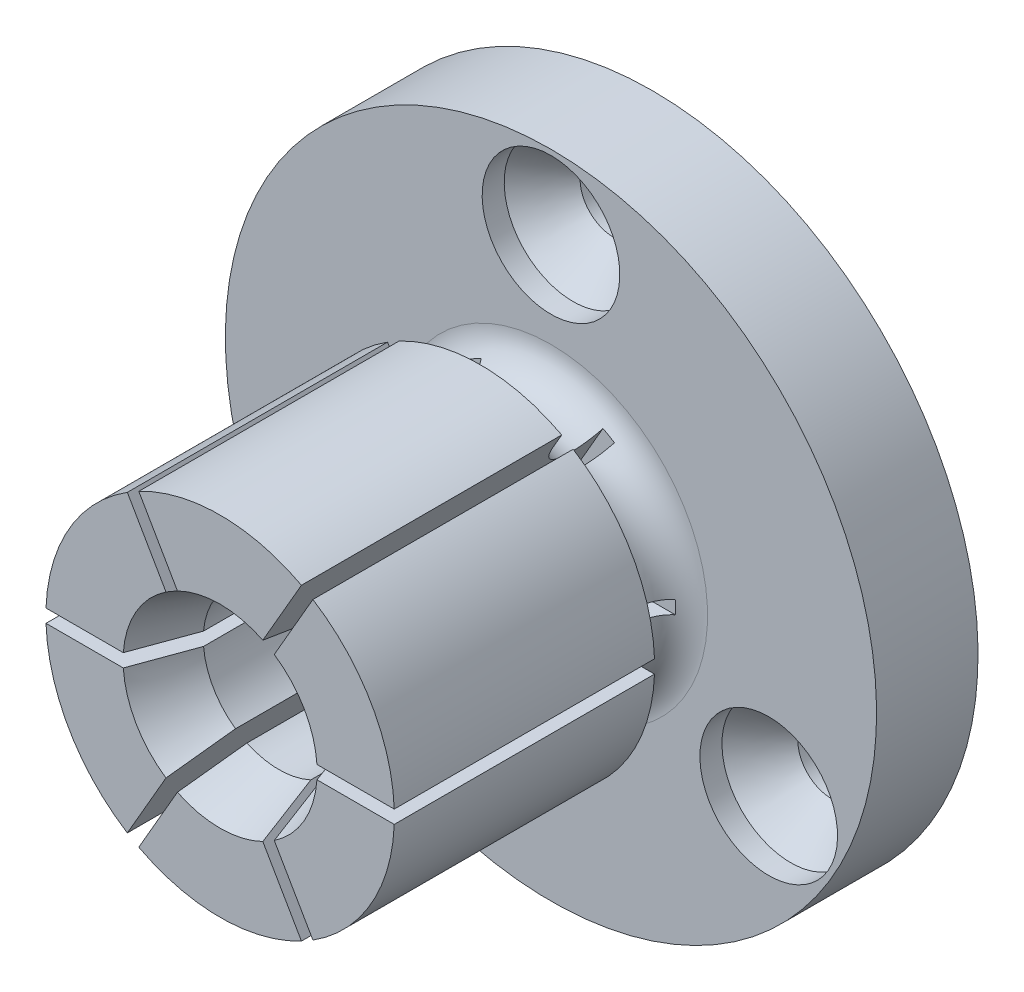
ISO-10303-21;
HEADER;
FILE_DESCRIPTION(('STEP AP214'),'2;1');
FILE_NAME('part.step','',(''),(''),'','','');
FILE_SCHEMA(('AUTOMOTIVE_DESIGN { 1 0 10303 214 1 1 1 1 }'));
ENDSEC;
DATA;
#1=APPLICATION_CONTEXT('core data for automotive mechanical design processes');
#2=APPLICATION_PROTOCOL_DEFINITION('international standard','automotive_design',2000,#1);
#3=PRODUCT_CONTEXT('',#1,'mechanical');
#4=PRODUCT('Part','Part','',(#3));
#5=PRODUCT_RELATED_PRODUCT_CATEGORY('part','',(#4));
#6=PRODUCT_DEFINITION_FORMATION('','',#4);
#7=PRODUCT_DEFINITION_CONTEXT('part definition',#1,'design');
#8=PRODUCT_DEFINITION('design','',#6,#7);
#9=PRODUCT_DEFINITION_SHAPE('','',#8);
#10=(LENGTH_UNIT() NAMED_UNIT(*) SI_UNIT(.MILLI.,.METRE.));
#11=(NAMED_UNIT(*) PLANE_ANGLE_UNIT() SI_UNIT($,.RADIAN.));
#12=(NAMED_UNIT(*) SI_UNIT($,.STERADIAN.) SOLID_ANGLE_UNIT());
#13=UNCERTAINTY_MEASURE_WITH_UNIT(LENGTH_MEASURE(1.E-05),#10,'distance_accuracy_value','');
#14=(GEOMETRIC_REPRESENTATION_CONTEXT(3) GLOBAL_UNCERTAINTY_ASSIGNED_CONTEXT((#13)) GLOBAL_UNIT_ASSIGNED_CONTEXT((#10,
#11,#12)) REPRESENTATION_CONTEXT('',''));
#15=CARTESIAN_POINT('',(0.,0.,0.));
#16=DIRECTION('',(0.,0.,1.));
#17=DIRECTION('',(1.,0.,0.));
#18=AXIS2_PLACEMENT_3D('',#15,#16,#17);
#19=CARTESIAN_POINT('',(9.017,0.,9.906));
#20=DIRECTION('',(0.,0.,-1.));
#21=DIRECTION('',(0.,1.,0.));
#22=AXIS2_PLACEMENT_3D('',#19,#20,#21);
#23=PLANE('',#22);
#24=DIRECTION('',(0.50000000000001,-0.866025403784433,0.));
#25=VECTOR('',#24,1.);
#26=CARTESIAN_POINT('',(2.58420567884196,-3.71397553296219,9.906));
#27=LINE('',#26,#25);
#28=CARTESIAN_POINT('',(4.83442923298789,-7.61147705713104,9.906));
#29=VERTEX_POINT('',#28);
#30=CARTESIAN_POINT('',(5.34283728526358,-8.49206563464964,9.906));
#31=VERTEX_POINT('',#30);
#32=EDGE_CURVE('E396',#29,#31,#27,.T.);
#33=ORIENTED_EDGE('',*,*,#32,.F.);
#34=CARTESIAN_POINT('',(0.,0.,9.906));
#35=DIRECTION('',(0.,0.,-1.));
#36=DIRECTION('',(0.,1.,0.));
#37=AXIS2_PLACEMENT_3D('',#34,#35,#36);
#38=CIRCLE('',#37,9.017);
#39=CARTESIAN_POINT('',(9.00894710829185,-0.381,9.906));
#40=VERTEX_POINT('',#39);
#41=EDGE_CURVE('E808',#40,#29,#38,.T.);
#42=ORIENTED_EDGE('',*,*,#41,.F.);
#43=DIRECTION('',(-1.,0.,0.));
#44=VECTOR('',#43,1.);
#45=CARTESIAN_POINT('',(9.017,-0.381,9.906));
#46=LINE('',#45,#44);
#47=CARTESIAN_POINT('',(10.0257632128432,-0.381,9.906));
#48=VERTEX_POINT('',#47);
#49=EDGE_CURVE('E926',#48,#40,#46,.T.);
#50=ORIENTED_EDGE('',*,*,#49,.F.);
#51=CARTESIAN_POINT('',(0.,0.,9.906));
#52=DIRECTION('',(0.,0.,-1.));
#53=DIRECTION('',(0.,1.,0.));
#54=AXIS2_PLACEMENT_3D('',#51,#52,#53);
#55=CIRCLE('',#54,10.033);
#56=EDGE_CURVE('E813',#48,#31,#55,.T.);
#57=ORIENTED_EDGE('',*,*,#56,.T.);
#58=EDGE_LOOP('',(#33,#42,#50,#57));
#59=FACE_BOUND('',#58,.T.);
#60=ADVANCED_FACE('F14',(#59),#23,.T.);
#61=CARTESIAN_POINT('',(0.,0.,0.));
#62=DIRECTION('',(0.,0.,-1.));
#63=DIRECTION('',(0.,1.,0.));
#64=AXIS2_PLACEMENT_3D('',#61,#62,#63);
#65=CYLINDRICAL_SURFACE('',#64,10.033);
#66=DIRECTION('',(0.,0.,-1.));
#67=VECTOR('',#66,1.);
#68=CARTESIAN_POINT('',(5.34283728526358,-8.49206563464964,0.));
#69=LINE('',#68,#67);
#70=CARTESIAN_POINT('',(5.34283728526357,-8.49206563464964,24.892));
#71=VERTEX_POINT('',#70);
#72=EDGE_CURVE('E959',#31,#71,#69,.F.);
#73=ORIENTED_EDGE('',*,*,#72,.F.);
#74=ORIENTED_EDGE('',*,*,#56,.F.);
#75=DIRECTION('',(0.,0.,-1.));
#76=VECTOR('',#75,1.);
#77=CARTESIAN_POINT('',(10.0257632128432,-0.381,0.));
#78=LINE('',#77,#76);
#79=CARTESIAN_POINT('',(10.0257632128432,-0.381,24.892));
#80=VERTEX_POINT('',#79);
#81=EDGE_CURVE('E930',#80,#48,#78,.T.);
#82=ORIENTED_EDGE('',*,*,#81,.F.);
#83=CARTESIAN_POINT('',(0.,0.,24.892));
#84=DIRECTION('',(0.,0.,-1.));
#85=DIRECTION('',(0.,1.,0.));
#86=AXIS2_PLACEMENT_3D('',#83,#84,#85);
#87=CIRCLE('',#86,10.033);
#88=EDGE_CURVE('E818',#80,#71,#87,.T.);
#89=ORIENTED_EDGE('',*,*,#88,.T.);
#90=EDGE_LOOP('',(#73,#74,#82,#89));
#91=FACE_BOUND('',#90,.T.);
#92=ADVANCED_FACE('F1102',(#91),#65,.T.);
#93=CARTESIAN_POINT('',(10.033,0.,24.892));
#94=DIRECTION('',(0.,0.,1.));
#95=DIRECTION('',(0.,-1.,0.));
#96=AXIS2_PLACEMENT_3D('',#93,#94,#95);
#97=PLANE('',#96);
#98=DIRECTION('',(-0.50000000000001,0.866025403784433,0.));
#99=VECTOR('',#98,1.);
#100=CARTESIAN_POINT('',(9.70252489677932,-16.0432660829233,24.892));
#101=LINE('',#100,#99);
#102=CARTESIAN_POINT('',(3.11745379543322,-4.63758836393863,24.892));
#103=VERTEX_POINT('',#102);
#104=EDGE_CURVE('E369',#71,#103,#101,.T.);
#105=ORIENTED_EDGE('',*,*,#104,.F.);
#106=ORIENTED_EDGE('',*,*,#88,.F.);
#107=DIRECTION('',(1.,0.,0.));
#108=VECTOR('',#107,1.);
#109=CARTESIAN_POINT('',(18.7451384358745,-0.381,24.892));
#110=LINE('',#109,#108);
#111=CARTESIAN_POINT('',(5.57499623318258,-0.381,24.892));
#112=VERTEX_POINT('',#111);
#113=EDGE_CURVE('E882',#112,#80,#110,.T.);
#114=ORIENTED_EDGE('',*,*,#113,.F.);
#115=CARTESIAN_POINT('',(0.,0.,24.892));
#116=DIRECTION('',(0.,0.,-1.));
#117=DIRECTION('',(0.,1.,0.));
#118=AXIS2_PLACEMENT_3D('',#115,#116,#117);
#119=CIRCLE('',#118,5.588);
#120=EDGE_CURVE('E823',#112,#103,#119,.T.);
#121=ORIENTED_EDGE('',*,*,#120,.T.);
#122=EDGE_LOOP('',(#105,#106,#114,#121));
#123=FACE_BOUND('',#122,.T.);
#124=ADVANCED_FACE('F1107',(#123),#97,.T.);
#125=CARTESIAN_POINT('',(0.,0.,24.892));
#126=DIRECTION('',(0.,0.,1.));
#127=DIRECTION('',(0.,-1.,0.));
#128=AXIS2_PLACEMENT_3D('',#125,#126,#127);
#129=CONICAL_SURFACE('',#128,5.588,0.349065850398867);
#130=CARTESIAN_POINT('',(3.11749027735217,-4.63765155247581,24.8922));
#131=CARTESIAN_POINT('',(3.01457981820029,-4.45940540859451,24.3279811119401));
#132=CARTESIAN_POINT('',(2.91163558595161,-4.28110076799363,23.7637868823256));
#133=CARTESIAN_POINT('',(2.70567957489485,-3.92437449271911,22.6354477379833));
#134=CARTESIAN_POINT('',(2.60266779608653,-3.74595285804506,22.0713028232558));
#135=CARTESIAN_POINT('',(2.49962224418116,-3.567472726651,21.5071825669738));
#136=B_SPLINE_CURVE_WITH_KNOTS('',3,(#130,#131,#132,#133,#134,#135),.UNSPECIFIED.,.F.,.F.,(4,2,
4),(0.,1.80176210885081,3.60352422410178),.UNSPECIFIED.);
#137=CARTESIAN_POINT('',(2.49965878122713,-3.56753601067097,21.5073825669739));
#138=VERTEX_POINT('',#137);
#139=EDGE_CURVE('E961',#103,#138,#136,.T.);
#140=ORIENTED_EDGE('',*,*,#139,.F.);
#141=ORIENTED_EDGE('',*,*,#120,.F.);
#142=CARTESIAN_POINT('',(1.9566826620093,-0.381,15.0160034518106));
#143=CARTESIAN_POINT('',(2.04274806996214,-0.381,15.2481286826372));
#144=CARTESIAN_POINT('',(2.1286460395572,-0.381,15.4803158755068));
#145=CARTESIAN_POINT('',(2.3001863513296,-0.381,15.9447845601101));
#146=CARTESIAN_POINT('',(2.38582869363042,-0.381,16.1770660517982));
#147=CARTESIAN_POINT('',(2.64249108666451,-0.381,16.8740073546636));
#148=CARTESIAN_POINT('',(2.81324669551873,-0.381,17.3387645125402));
#149=CARTESIAN_POINT('',(3.23637809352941,-0.381,18.4919434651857));
#150=CARTESIAN_POINT('',(3.48851824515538,-0.381,19.1804516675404));
#151=CARTESIAN_POINT('',(3.99235804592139,-0.381,20.5576298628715));
#152=CARTESIAN_POINT('',(4.2440576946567,-0.381,21.2462998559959));
#153=CARTESIAN_POINT('',(4.9170843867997,-0.381,23.0888089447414));
#154=CARTESIAN_POINT('',(5.33818166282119,-0.381,24.2427319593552));
#155=CARTESIAN_POINT('',(5.96957749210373,-0.381,25.9737062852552));
#156=CARTESIAN_POINT('',(6.18000086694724,-0.381,26.5507120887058));
#157=CARTESIAN_POINT('',(6.60078200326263,-0.381,27.7047475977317));
#158=CARTESIAN_POINT('',(6.81113976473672,-0.381,28.2817773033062));
#159=CARTESIAN_POINT('',(7.02147352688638,-0.381,28.8588157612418));
#160=B_SPLINE_CURVE_WITH_KNOTS('',3,(#142,#143,#144,#145,#146,#147,#148,#149,#150,#151,#152,
#153,#154,#155,#156,#157,#158,#159),.UNSPECIFIED.,.F.,.F.,(4,2,2,2,2,2,2,2,4),(0.,
0.742700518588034,1.48540067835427,2.97079933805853,5.17047260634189,7.3701478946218,
11.0552191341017,12.8977508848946,14.7402825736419),.UNSPECIFIED.);
#161=CARTESIAN_POINT('',(4.33940620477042,-0.381,21.5073825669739));
#162=VERTEX_POINT('',#161);
#163=EDGE_CURVE('E932',#162,#112,#160,.T.);
#164=ORIENTED_EDGE('',*,*,#163,.F.);
#165=CARTESIAN_POINT('',(0.,0.,21.5073825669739));
#166=DIRECTION('',(0.,0.,-1.));
#167=DIRECTION('',(0.,1.,0.));
#168=AXIS2_PLACEMENT_3D('',#165,#166,#167);
#169=CIRCLE('',#168,4.3561);
#170=EDGE_CURVE('E828',#162,#138,#169,.T.);
#171=ORIENTED_EDGE('',*,*,#170,.T.);
#172=EDGE_LOOP('',(#140,#141,#164,#171));
#173=FACE_BOUND('',#172,.T.);
#174=ADVANCED_FACE('F1169',(#173),#129,.F.);
#175=CARTESIAN_POINT('',(0.,0.,0.));
#176=DIRECTION('',(0.,0.,-1.));
#177=DIRECTION('',(0.,1.,0.));
#178=AXIS2_PLACEMENT_3D('',#175,#176,#177);
#179=CYLINDRICAL_SURFACE('',#178,4.3561);
#180=DIRECTION('',(0.,0.,-1.));
#181=VECTOR('',#180,1.);
#182=CARTESIAN_POINT('',(2.49965878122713,-3.56753601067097,0.));
#183=LINE('',#182,#181);
#184=CARTESIAN_POINT('',(2.49965878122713,-3.56753601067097,13.716));
#185=VERTEX_POINT('',#184);
#186=EDGE_CURVE('E958',#138,#185,#183,.T.);
#187=ORIENTED_EDGE('',*,*,#186,.F.);
#188=ORIENTED_EDGE('',*,*,#170,.F.);
#189=DIRECTION('',(0.,0.,-1.));
#190=VECTOR('',#189,1.);
#191=CARTESIAN_POINT('',(4.33940620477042,-0.381,0.));
#192=LINE('',#191,#190);
#193=CARTESIAN_POINT('',(4.33940620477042,-0.381,13.716));
#194=VERTEX_POINT('',#193);
#195=EDGE_CURVE('E940',#194,#162,#192,.F.);
#196=ORIENTED_EDGE('',*,*,#195,.F.);
#197=CARTESIAN_POINT('',(0.,0.,13.716));
#198=DIRECTION('',(0.,0.,-1.));
#199=DIRECTION('',(0.,1.,0.));
#200=AXIS2_PLACEMENT_3D('',#197,#198,#199);
#201=CIRCLE('',#200,4.3561);
#202=EDGE_CURVE('E689',#194,#185,#201,.T.);
#203=ORIENTED_EDGE('',*,*,#202,.T.);
#204=EDGE_LOOP('',(#187,#188,#196,#203));
#205=FACE_BOUND('',#204,.T.);
#206=ADVANCED_FACE('F1098',(#205),#179,.F.);
#207=CARTESIAN_POINT('',(4.1656,0.,13.716));
#208=DIRECTION('',(0.,0.,1.));
#209=DIRECTION('',(0.,-1.,0.));
#210=AXIS2_PLACEMENT_3D('',#207,#208,#209);
#211=PLANE('',#210);
#212=DIRECTION('',(-0.50000000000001,0.866025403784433,0.));
#213=VECTOR('',#212,1.);
#214=CARTESIAN_POINT('',(1.37135567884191,-1.61325771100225,13.716));
#215=LINE('',#214,#213);
#216=CARTESIAN_POINT('',(2.40402549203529,-3.40189429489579,13.716));
#217=VERTEX_POINT('',#216);
#218=EDGE_CURVE('E956',#185,#217,#215,.T.);
#219=ORIENTED_EDGE('',*,*,#218,.F.);
#220=ORIENTED_EDGE('',*,*,#202,.F.);
#221=DIRECTION('',(1.,0.,0.));
#222=VECTOR('',#221,1.);
#223=CARTESIAN_POINT('',(4.1656,-0.381,13.716));
#224=LINE('',#223,#222);
#225=CARTESIAN_POINT('',(4.14813962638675,-0.381,13.716));
#226=VERTEX_POINT('',#225);
#227=EDGE_CURVE('E794',#226,#194,#224,.T.);
#228=ORIENTED_EDGE('',*,*,#227,.F.);
#229=CARTESIAN_POINT('',(0.,0.,13.716));
#230=DIRECTION('',(0.,0.,-1.));
#231=DIRECTION('',(0.,1.,0.));
#232=AXIS2_PLACEMENT_3D('',#229,#230,#231);
#233=CIRCLE('',#232,4.1656);
#234=EDGE_CURVE('E674',#226,#217,#233,.T.);
#235=ORIENTED_EDGE('',*,*,#234,.T.);
#236=EDGE_LOOP('',(#219,#220,#228,#235));
#237=FACE_BOUND('',#236,.T.);
#238=ADVANCED_FACE('F955',(#237),#211,.T.);
#239=DIRECTION('',(-0.50000000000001,0.866025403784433,0.));
#240=VECTOR('',#239,1.);
#241=CARTESIAN_POINT('',(1.92429432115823,-4.0949755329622,9.906));
#242=LINE('',#241,#240);
#243=CARTESIAN_POINT('',(4.68292592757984,-8.87306563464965,9.906));
#244=VERTEX_POINT('',#243);
#245=CARTESIAN_POINT('',(4.17451787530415,-7.99247705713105,9.906));
#246=VERTEX_POINT('',#245);
#247=EDGE_CURVE('E377',#244,#246,#242,.T.);
#248=ORIENTED_EDGE('',*,*,#247,.F.);
#249=CARTESIAN_POINT('',(-4.68292592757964,-8.87306563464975,9.906));
#250=VERTEX_POINT('',#249);
#251=EDGE_CURVE('E816',#244,#250,#55,.T.);
#252=ORIENTED_EDGE('',*,*,#251,.T.);
#253=DIRECTION('',(-0.499999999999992,-0.866025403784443,0.));
#254=VECTOR('',#253,1.);
#255=CARTESIAN_POINT('',(2.5842056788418,3.7139755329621,9.906));
#256=LINE('',#255,#254);
#257=CARTESIAN_POINT('',(-4.17451787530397,-7.99247705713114,9.906));
#258=VERTEX_POINT('',#257);
#259=EDGE_CURVE('E997',#258,#250,#256,.T.);
#260=ORIENTED_EDGE('',*,*,#259,.F.);
#261=EDGE_CURVE('E811',#246,#258,#38,.T.);
#262=ORIENTED_EDGE('',*,*,#261,.F.);
#263=EDGE_LOOP('',(#248,#252,#260,#262));
#264=FACE_BOUND('',#263,.T.);
#265=ADVANCED_FACE('F1084',(#264),#23,.T.);
#266=DIRECTION('',(0.,0.,-1.));
#267=VECTOR('',#266,1.);
#268=CARTESIAN_POINT('',(4.68292592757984,-8.87306563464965,0.));
#269=LINE('',#268,#267);
#270=CARTESIAN_POINT('',(4.68292592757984,-8.87306563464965,24.892));
#271=VERTEX_POINT('',#270);
#272=EDGE_CURVE('E382',#271,#244,#269,.T.);
#273=ORIENTED_EDGE('',*,*,#272,.F.);
#274=CARTESIAN_POINT('',(-4.68292592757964,-8.87306563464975,24.892));
#275=VERTEX_POINT('',#274);
#276=EDGE_CURVE('E821',#271,#275,#87,.T.);
#277=ORIENTED_EDGE('',*,*,#276,.T.);
#278=DIRECTION('',(0.,0.,-1.));
#279=VECTOR('',#278,1.);
#280=CARTESIAN_POINT('',(-4.68292592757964,-8.87306563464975,0.));
#281=LINE('',#280,#279);
#282=EDGE_CURVE('E1000',#250,#275,#281,.F.);
#283=ORIENTED_EDGE('',*,*,#282,.F.);
#284=ORIENTED_EDGE('',*,*,#251,.F.);
#285=EDGE_LOOP('',(#273,#277,#283,#284));
#286=FACE_BOUND('',#285,.T.);
#287=ADVANCED_FACE('F1047',(#286),#65,.T.);
#288=DIRECTION('',(0.50000000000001,-0.866025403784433,0.));
#289=VECTOR('',#288,1.);
#290=CARTESIAN_POINT('',(9.04261353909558,-16.4242660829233,24.892));
#291=LINE('',#290,#289);
#292=CARTESIAN_POINT('',(2.45754243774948,-5.01858836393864,24.892));
#293=VERTEX_POINT('',#292);
#294=EDGE_CURVE('E1055',#293,#271,#291,.T.);
#295=ORIENTED_EDGE('',*,*,#294,.F.);
#296=CARTESIAN_POINT('',(-2.45754243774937,-5.0185883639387,24.892));
#297=VERTEX_POINT('',#296);
#298=EDGE_CURVE('E826',#293,#297,#119,.T.);
#299=ORIENTED_EDGE('',*,*,#298,.T.);
#300=DIRECTION('',(0.499999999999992,0.866025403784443,0.));
#301=VECTOR('',#300,1.);
#302=CARTESIAN_POINT('',(-9.04261353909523,-16.4242660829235,24.892));
#303=LINE('',#302,#301);
#304=EDGE_CURVE('E971',#275,#297,#303,.T.);
#305=ORIENTED_EDGE('',*,*,#304,.F.);
#306=ORIENTED_EDGE('',*,*,#276,.F.);
#307=EDGE_LOOP('',(#295,#299,#305,#306));
#308=FACE_BOUND('',#307,.T.);
#309=ADVANCED_FACE('F1053',(#308),#97,.T.);
#310=CARTESIAN_POINT('',(1.83971088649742,-3.94847272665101,21.5071825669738));
#311=CARTESIAN_POINT('',(1.94275643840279,-4.12695285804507,22.0713028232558));
#312=CARTESIAN_POINT('',(2.04576821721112,-4.30537449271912,22.6354477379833));
#313=CARTESIAN_POINT('',(2.25172422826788,-4.66210076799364,23.7637868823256));
#314=CARTESIAN_POINT('',(2.35466846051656,-4.84040540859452,24.3279811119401));
#315=CARTESIAN_POINT('',(2.45757891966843,-5.01865155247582,24.8922));
#316=B_SPLINE_CURVE_WITH_KNOTS('',3,(#310,#311,#312,#313,#314,#315),.UNSPECIFIED.,.F.,.F.,(4,2,
4),(0.,1.80176211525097,3.60352422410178),.UNSPECIFIED.);
#317=CARTESIAN_POINT('',(1.83974742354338,-3.94853601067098,21.5073825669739));
#318=VERTEX_POINT('',#317);
#319=EDGE_CURVE('E388',#318,#293,#316,.T.);
#320=ORIENTED_EDGE('',*,*,#319,.F.);
#321=CARTESIAN_POINT('',(-1.83974742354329,-3.94853601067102,21.5073825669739));
#322=VERTEX_POINT('',#321);
#323=EDGE_CURVE('E830',#318,#322,#169,.T.);
#324=ORIENTED_EDGE('',*,*,#323,.T.);
#325=CARTESIAN_POINT('',(-2.45757891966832,-5.01865155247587,24.8922));
#326=CARTESIAN_POINT('',(-2.35466846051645,-4.84040540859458,24.3279811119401));
#327=CARTESIAN_POINT('',(-2.25172422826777,-4.66210076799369,23.7637868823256));
#328=CARTESIAN_POINT('',(-2.04576821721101,-4.30537449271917,22.6354477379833));
#329=CARTESIAN_POINT('',(-1.9427564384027,-4.12695285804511,22.0713028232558));
#330=CARTESIAN_POINT('',(-1.83971088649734,-3.94847272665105,21.5071825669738));
#331=B_SPLINE_CURVE_WITH_KNOTS('',3,(#325,#326,#327,#328,#329,#330),.UNSPECIFIED.,.F.,.F.,(4,2,
4),(0.,1.80176210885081,3.60352422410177),.UNSPECIFIED.);
#332=EDGE_CURVE('E533',#297,#322,#331,.T.);
#333=ORIENTED_EDGE('',*,*,#332,.F.);
#334=ORIENTED_EDGE('',*,*,#298,.F.);
#335=EDGE_LOOP('',(#320,#324,#333,#334));
#336=FACE_BOUND('',#335,.T.);
#337=ADVANCED_FACE('F1163',(#336),#129,.F.);
#338=DIRECTION('',(0.,0.,-1.));
#339=VECTOR('',#338,1.);
#340=CARTESIAN_POINT('',(1.83974742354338,-3.94853601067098,0.));
#341=LINE('',#340,#339);
#342=CARTESIAN_POINT('',(1.83974742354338,-3.94853601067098,13.716));
#343=VERTEX_POINT('',#342);
#344=EDGE_CURVE('E386',#343,#318,#341,.F.);
#345=ORIENTED_EDGE('',*,*,#344,.F.);
#346=CARTESIAN_POINT('',(-1.83974742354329,-3.94853601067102,13.716));
#347=VERTEX_POINT('',#346);
#348=EDGE_CURVE('E833',#343,#347,#201,.T.);
#349=ORIENTED_EDGE('',*,*,#348,.T.);
#350=DIRECTION('',(0.,0.,-1.));
#351=VECTOR('',#350,1.);
#352=CARTESIAN_POINT('',(-1.83974742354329,-3.94853601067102,0.));
#353=LINE('',#352,#351);
#354=EDGE_CURVE('E542',#322,#347,#353,.T.);
#355=ORIENTED_EDGE('',*,*,#354,.F.);
#356=ORIENTED_EDGE('',*,*,#323,.F.);
#357=EDGE_LOOP('',(#345,#349,#355,#356));
#358=FACE_BOUND('',#357,.T.);
#359=ADVANCED_FACE('F1008',(#358),#179,.F.);
#360=DIRECTION('',(0.50000000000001,-0.866025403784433,0.));
#361=VECTOR('',#360,1.);
#362=CARTESIAN_POINT('',(0.711444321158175,-1.99425771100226,13.716));
#363=LINE('',#362,#361);
#364=CARTESIAN_POINT('',(1.74411413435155,-3.7828942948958,13.716));
#365=VERTEX_POINT('',#364);
#366=EDGE_CURVE('E384',#365,#343,#363,.T.);
#367=ORIENTED_EDGE('',*,*,#366,.F.);
#368=CARTESIAN_POINT('',(-1.74411413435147,-3.78289429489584,13.716));
#369=VERTEX_POINT('',#368);
#370=EDGE_CURVE('E374',#365,#369,#233,.T.);
#371=ORIENTED_EDGE('',*,*,#370,.T.);
#372=DIRECTION('',(0.499999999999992,0.866025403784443,0.));
#373=VECTOR('',#372,1.);
#374=CARTESIAN_POINT('',(1.37135567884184,1.61325771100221,13.716));
#375=LINE('',#374,#373);
#376=EDGE_CURVE('E1002',#347,#369,#375,.T.);
#377=ORIENTED_EDGE('',*,*,#376,.F.);
#378=ORIENTED_EDGE('',*,*,#348,.F.);
#379=EDGE_LOOP('',(#367,#371,#377,#378));
#380=FACE_BOUND('',#379,.T.);
#381=ADVANCED_FACE('F1006',(#380),#211,.T.);
#382=DIRECTION('',(0.499999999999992,0.866025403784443,0.));
#383=VECTOR('',#382,1.);
#384=CARTESIAN_POINT('',(1.92429432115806,4.0949755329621,9.906));
#385=LINE('',#384,#383);
#386=CARTESIAN_POINT('',(-5.34283728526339,-8.49206563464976,9.906));
#387=VERTEX_POINT('',#386);
#388=CARTESIAN_POINT('',(-4.83442923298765,-7.61147705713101,9.90600000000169));
#389=VERTEX_POINT('',#388);
#390=EDGE_CURVE('E982',#387,#389,#385,.T.);
#391=ORIENTED_EDGE('',*,*,#390,.F.);
#392=CARTESIAN_POINT('',(-10.0257632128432,-0.381000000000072,9.906));
#393=VERTEX_POINT('',#392);
#394=EDGE_CURVE('E1027',#387,#393,#55,.T.);
#395=ORIENTED_EDGE('',*,*,#394,.T.);
#396=DIRECTION('',(-1.,0.,0.));
#397=VECTOR('',#396,1.);
#398=CARTESIAN_POINT('',(9.017,-0.380999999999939,9.906));
#399=LINE('',#398,#397);
#400=CARTESIAN_POINT('',(-9.00894710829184,-0.381000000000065,9.906));
#401=VERTEX_POINT('',#400);
#402=EDGE_CURVE('E574',#401,#393,#399,.T.);
#403=ORIENTED_EDGE('',*,*,#402,.F.);
#404=EDGE_CURVE('E1142',#389,#401,#38,.T.);
#405=ORIENTED_EDGE('',*,*,#404,.F.);
#406=EDGE_LOOP('',(#391,#395,#403,#405));
#407=FACE_BOUND('',#406,.T.);
#408=ADVANCED_FACE('F1110',(#407),#23,.T.);
#409=DIRECTION('',(0.,0.,-1.));
#410=VECTOR('',#409,1.);
#411=CARTESIAN_POINT('',(-5.34283728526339,-8.49206563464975,0.));
#412=LINE('',#411,#410);
#413=CARTESIAN_POINT('',(-5.34283728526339,-8.49206563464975,24.892));
#414=VERTEX_POINT('',#413);
#415=EDGE_CURVE('E985',#414,#387,#412,.T.);
#416=ORIENTED_EDGE('',*,*,#415,.F.);
#417=CARTESIAN_POINT('',(-10.0257632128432,-0.381000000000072,24.892));
#418=VERTEX_POINT('',#417);
#419=EDGE_CURVE('E1036',#414,#418,#87,.T.);
#420=ORIENTED_EDGE('',*,*,#419,.T.);
#421=DIRECTION('',(0.,0.,-1.));
#422=VECTOR('',#421,1.);
#423=CARTESIAN_POINT('',(-10.0257632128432,-0.381000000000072,0.));
#424=LINE('',#423,#422);
#425=EDGE_CURVE('E1063',#393,#418,#424,.F.);
#426=ORIENTED_EDGE('',*,*,#425,.F.);
#427=ORIENTED_EDGE('',*,*,#394,.F.);
#428=EDGE_LOOP('',(#416,#420,#426,#427));
#429=FACE_BOUND('',#428,.T.);
#430=ADVANCED_FACE('F1080',(#429),#65,.T.);
#431=DIRECTION('',(-0.499999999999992,-0.866025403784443,0.));
#432=VECTOR('',#431,1.);
#433=CARTESIAN_POINT('',(-9.70252489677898,-16.0432660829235,24.892));
#434=LINE('',#433,#432);
#435=CARTESIAN_POINT('',(-3.11745379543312,-4.6375883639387,24.892));
#436=VERTEX_POINT('',#435);
#437=EDGE_CURVE('E969',#436,#414,#434,.T.);
#438=ORIENTED_EDGE('',*,*,#437,.F.);
#439=CARTESIAN_POINT('',(-5.57499623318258,-0.381000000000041,24.892));
#440=VERTEX_POINT('',#439);
#441=EDGE_CURVE('E906',#436,#440,#119,.T.);
#442=ORIENTED_EDGE('',*,*,#441,.T.);
#443=DIRECTION('',(1.,0.,0.));
#444=VECTOR('',#443,1.);
#445=CARTESIAN_POINT('',(-18.7451384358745,-0.381000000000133,24.892));
#446=LINE('',#445,#444);
#447=EDGE_CURVE('E545',#418,#440,#446,.T.);
#448=ORIENTED_EDGE('',*,*,#447,.F.);
#449=ORIENTED_EDGE('',*,*,#419,.F.);
#450=EDGE_LOOP('',(#438,#442,#448,#449));
#451=FACE_BOUND('',#450,.T.);
#452=ADVANCED_FACE('F1060',(#451),#97,.T.);
#453=CARTESIAN_POINT('',(-2.49962224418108,-3.56747272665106,21.5071825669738));
#454=CARTESIAN_POINT('',(-2.60266779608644,-3.74595285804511,22.0713028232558));
#455=CARTESIAN_POINT('',(-2.70567957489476,-3.92437449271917,22.6354477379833));
#456=CARTESIAN_POINT('',(-2.91163558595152,-4.28110076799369,23.7637868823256));
#457=CARTESIAN_POINT('',(-3.01457981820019,-4.45940540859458,24.3279811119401));
#458=CARTESIAN_POINT('',(-3.11749027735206,-4.63765155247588,24.8922));
#459=B_SPLINE_CURVE_WITH_KNOTS('',3,(#453,#454,#455,#456,#457,#458),.UNSPECIFIED.,.F.,.F.,(4,2,
4),(0.,1.80176211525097,3.60352422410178),.UNSPECIFIED.);
#460=CARTESIAN_POINT('',(-2.49965878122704,-3.56753601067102,21.5073825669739));
#461=VERTEX_POINT('',#460);
#462=EDGE_CURVE('E991',#461,#436,#459,.T.);
#463=ORIENTED_EDGE('',*,*,#462,.F.);
#464=CARTESIAN_POINT('',(-4.33940620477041,-0.381000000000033,21.5073825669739));
#465=VERTEX_POINT('',#464);
#466=EDGE_CURVE('E1010',#461,#465,#169,.T.);
#467=ORIENTED_EDGE('',*,*,#466,.T.);
#468=CARTESIAN_POINT('',(-7.02147352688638,-0.381000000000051,28.8588157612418));
#469=CARTESIAN_POINT('',(-6.60078791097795,-0.381000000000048,27.7047434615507));
#470=CARTESIAN_POINT('',(-6.18004124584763,-0.381000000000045,26.5506933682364));
#471=CARTESIAN_POINT('',(-5.54864547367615,-0.381000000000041,24.8197194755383));
#472=CARTESIAN_POINT('',(-5.3381343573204,-0.381000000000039,24.2427453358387));
#473=CARTESIAN_POINT('',(-4.91698936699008,-0.381000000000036,23.0888417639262));
#474=CARTESIAN_POINT('',(-4.70635549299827,-0.381000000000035,22.5119123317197));
#475=CARTESIAN_POINT('',(-4.28490452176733,-0.381000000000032,21.3581194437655));
#476=CARTESIAN_POINT('',(-4.07408742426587,-0.381000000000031,20.7812559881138));
#477=CARTESIAN_POINT('',(-3.65216653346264,-0.381000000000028,19.6276341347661));
#478=CARTESIAN_POINT('',(-3.44106274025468,-0.381000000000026,19.0508757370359));
#479=CARTESIAN_POINT('',(-3.0183744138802,-0.381000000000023,17.8975341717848));
#480=CARTESIAN_POINT('',(-2.80678988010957,-0.381000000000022,17.3209510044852));
#481=CARTESIAN_POINT('',(-2.48871987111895,-0.381000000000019,16.4563307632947));
#482=CARTESIAN_POINT('',(-2.38258094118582,-0.381000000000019,16.168166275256));
#483=CARTESIAN_POINT('',(-2.16993854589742,-0.381000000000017,15.5919716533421));
#484=CARTESIAN_POINT('',(-2.06343508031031,-0.381000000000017,15.3039415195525));
#485=CARTESIAN_POINT('',(-1.95668266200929,-0.381000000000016,15.0160034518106));
#486=B_SPLINE_CURVE_WITH_KNOTS('',3,(#468,#469,#470,#471,#472,#473,#474,#475,#476,#477,#478,
#479,#480,#481,#482,#483,#484,#485),.UNSPECIFIED.,.F.,.F.,(4,2,2,2,2,2,2,2,4),(0.,
3.685069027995,5.52760173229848,7.37013469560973,9.21267030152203,11.0552053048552,
12.8977426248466,13.8190123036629,14.7402825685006),.UNSPECIFIED.);
#487=EDGE_CURVE('E764',#440,#465,#486,.T.);
#488=ORIENTED_EDGE('',*,*,#487,.F.);
#489=ORIENTED_EDGE('',*,*,#441,.F.);
#490=EDGE_LOOP('',(#463,#467,#488,#489));
#491=FACE_BOUND('',#490,.T.);
#492=ADVANCED_FACE('F1064',(#491),#129,.F.);
#493=DIRECTION('',(0.,0.,-1.));
#494=VECTOR('',#493,1.);
#495=CARTESIAN_POINT('',(-2.49965878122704,-3.56753601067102,0.));
#496=LINE('',#495,#494);
#497=CARTESIAN_POINT('',(-2.49965878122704,-3.56753601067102,13.716));
#498=VERTEX_POINT('',#497);
#499=EDGE_CURVE('E989',#498,#461,#496,.F.);
#500=ORIENTED_EDGE('',*,*,#499,.F.);
#501=CARTESIAN_POINT('',(-4.33940620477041,-0.381000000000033,13.716));
#502=VERTEX_POINT('',#501);
#503=EDGE_CURVE('E839',#498,#502,#201,.T.);
#504=ORIENTED_EDGE('',*,*,#503,.T.);
#505=DIRECTION('',(0.,0.,-1.));
#506=VECTOR('',#505,1.);
#507=CARTESIAN_POINT('',(-4.33940620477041,-0.381000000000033,0.));
#508=LINE('',#507,#506);
#509=EDGE_CURVE('E1065',#465,#502,#508,.T.);
#510=ORIENTED_EDGE('',*,*,#509,.F.);
#511=ORIENTED_EDGE('',*,*,#466,.F.);
#512=EDGE_LOOP('',(#500,#504,#510,#511));
#513=FACE_BOUND('',#512,.T.);
#514=ADVANCED_FACE('F1134',(#513),#179,.F.);
#515=DIRECTION('',(-0.499999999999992,-0.866025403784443,0.));
#516=VECTOR('',#515,1.);
#517=CARTESIAN_POINT('',(0.711444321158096,1.9942577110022,13.716));
#518=LINE('',#517,#516);
#519=CARTESIAN_POINT('',(-2.40402549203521,-3.40189429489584,13.716));
#520=VERTEX_POINT('',#519);
#521=EDGE_CURVE('E987',#520,#498,#518,.T.);
#522=ORIENTED_EDGE('',*,*,#521,.F.);
#523=CARTESIAN_POINT('',(-4.14813962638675,-0.381000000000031,13.716));
#524=VERTEX_POINT('',#523);
#525=EDGE_CURVE('E690',#520,#524,#233,.T.);
#526=ORIENTED_EDGE('',*,*,#525,.T.);
#527=DIRECTION('',(1.,0.,0.));
#528=VECTOR('',#527,1.);
#529=CARTESIAN_POINT('',(4.1656,-0.380999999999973,13.716));
#530=LINE('',#529,#528);
#531=EDGE_CURVE('E1066',#502,#524,#530,.T.);
#532=ORIENTED_EDGE('',*,*,#531,.F.);
#533=ORIENTED_EDGE('',*,*,#503,.F.);
#534=EDGE_LOOP('',(#522,#526,#532,#533));
#535=FACE_BOUND('',#534,.T.);
#536=ADVANCED_FACE('F1126',(#535),#211,.T.);
#537=DIRECTION('',(1.,0.,0.));
#538=VECTOR('',#537,1.);
#539=CARTESIAN_POINT('',(9.017,0.381000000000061,9.906));
#540=LINE('',#539,#538);
#541=CARTESIAN_POINT('',(-10.0257632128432,0.380999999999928,9.906));
#542=VERTEX_POINT('',#541);
#543=CARTESIAN_POINT('',(-9.00894710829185,0.380999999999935,9.906));
#544=VERTEX_POINT('',#543);
#545=EDGE_CURVE('E559',#542,#544,#540,.T.);
#546=ORIENTED_EDGE('',*,*,#545,.F.);
#547=CARTESIAN_POINT('',(-5.34283728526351,8.49206563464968,9.906));
#548=VERTEX_POINT('',#547);
#549=EDGE_CURVE('E1026',#542,#548,#55,.T.);
#550=ORIENTED_EDGE('',*,*,#549,.T.);
#551=DIRECTION('',(-0.5,0.866025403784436,0.));
#552=VECTOR('',#551,1.);
#553=CARTESIAN_POINT('',(1.92429432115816,-4.09497553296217,9.906));
#554=LINE('',#553,#552);
#555=CARTESIAN_POINT('',(-4.83442923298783,7.61147705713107,9.906));
#556=VERTEX_POINT('',#555);
#557=EDGE_CURVE('E740',#556,#548,#554,.T.);
#558=ORIENTED_EDGE('',*,*,#557,.F.);
#559=EDGE_CURVE('E776',#544,#556,#38,.T.);
#560=ORIENTED_EDGE('',*,*,#559,.F.);
#561=EDGE_LOOP('',(#546,#550,#558,#560));
#562=FACE_BOUND('',#561,.T.);
#563=ADVANCED_FACE('F1118',(#562),#23,.T.);
#564=DIRECTION('',(0.,0.,-1.));
#565=VECTOR('',#564,1.);
#566=CARTESIAN_POINT('',(-10.0257632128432,0.380999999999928,0.));
#567=LINE('',#566,#565);
#568=CARTESIAN_POINT('',(-10.0257632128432,0.380999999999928,24.892));
#569=VERTEX_POINT('',#568);
#570=EDGE_CURVE('E562',#569,#542,#567,.T.);
#571=ORIENTED_EDGE('',*,*,#570,.F.);
#572=CARTESIAN_POINT('',(-5.34283728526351,8.49206563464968,24.892));
#573=VERTEX_POINT('',#572);
#574=EDGE_CURVE('E757',#569,#573,#87,.T.);
#575=ORIENTED_EDGE('',*,*,#574,.T.);
#576=DIRECTION('',(0.,0.,-1.));
#577=VECTOR('',#576,1.);
#578=CARTESIAN_POINT('',(-5.34283728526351,8.49206563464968,0.));
#579=LINE('',#578,#577);
#580=EDGE_CURVE('E715',#548,#573,#579,.F.);
#581=ORIENTED_EDGE('',*,*,#580,.F.);
#582=ORIENTED_EDGE('',*,*,#549,.F.);
#583=EDGE_LOOP('',(#571,#575,#581,#582));
#584=FACE_BOUND('',#583,.T.);
#585=ADVANCED_FACE('F1124',(#584),#65,.T.);
#586=DIRECTION('',(-1.,0.,0.));
#587=VECTOR('',#586,1.);
#588=CARTESIAN_POINT('',(-18.7451384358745,0.380999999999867,24.892));
#589=LINE('',#588,#587);
#590=CARTESIAN_POINT('',(-5.57499623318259,0.380999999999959,24.892));
#591=VERTEX_POINT('',#590);
#592=EDGE_CURVE('E541',#591,#569,#589,.T.);
#593=ORIENTED_EDGE('',*,*,#592,.F.);
#594=CARTESIAN_POINT('',(-3.11745379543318,4.63758836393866,24.892));
#595=VERTEX_POINT('',#594);
#596=EDGE_CURVE('E759',#591,#595,#119,.T.);
#597=ORIENTED_EDGE('',*,*,#596,.T.);
#598=DIRECTION('',(0.5,-0.866025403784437,0.));
#599=VECTOR('',#598,1.);
#600=CARTESIAN_POINT('',(-9.70252489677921,16.0432660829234,24.892));
#601=LINE('',#600,#599);
#602=EDGE_CURVE('E747',#573,#595,#601,.T.);
#603=ORIENTED_EDGE('',*,*,#602,.F.);
#604=ORIENTED_EDGE('',*,*,#574,.F.);
#605=EDGE_LOOP('',(#593,#597,#603,#604));
#606=FACE_BOUND('',#605,.T.);
#607=ADVANCED_FACE('F756',(#606),#97,.T.);
#608=CARTESIAN_POINT('',(-1.95668266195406,0.380999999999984,15.0160034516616));
#609=CARTESIAN_POINT('',(-2.04274806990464,0.380999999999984,15.2481286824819));
#610=CARTESIAN_POINT('',(-2.12864603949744,0.380999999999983,15.4803158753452));
#611=CARTESIAN_POINT('',(-2.30018635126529,0.380999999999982,15.9447845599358));
#612=CARTESIAN_POINT('',(-2.38582869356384,0.380999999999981,16.1770660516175));
#613=CARTESIAN_POINT('',(-2.64249108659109,0.380999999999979,16.8740073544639));
#614=CARTESIAN_POINT('',(-2.81324669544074,0.380999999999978,17.3387645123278));
#615=CARTESIAN_POINT('',(-3.23637809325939,0.380999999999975,18.4919434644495));
#616=CARTESIAN_POINT('',(-3.48851824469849,0.380999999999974,19.1804516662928));
#617=CARTESIAN_POINT('',(-3.99235804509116,0.38099999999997,20.557629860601));
#618=CARTESIAN_POINT('',(-4.24405769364,0.380999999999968,21.2462998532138));
#619=CARTESIAN_POINT('',(-4.91708438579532,0.380999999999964,23.0888089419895));
#620=CARTESIAN_POINT('',(-5.3381816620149,0.380999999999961,24.2427319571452));
#621=CARTESIAN_POINT('',(-5.96957749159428,0.380999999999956,25.9737062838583));
#622=CARTESIAN_POINT('',(-6.18000086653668,0.380999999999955,26.5507120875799));
#623=CARTESIAN_POINT('',(-6.60078200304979,0.380999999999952,27.7047475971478));
#624=CARTESIAN_POINT('',(-6.81113976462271,0.38099999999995,28.2817773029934));
#625=CARTESIAN_POINT('',(-7.02147352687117,0.380999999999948,28.8588157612));
#626=B_SPLINE_CURVE_WITH_KNOTS('',3,(#608,#609,#610,#611,#612,#613,#614,#615,#616,#617,#618,
#619,#620,#621,#622,#623,#624,#625),.UNSPECIFIED.,.F.,.F.,(4,2,2,2,2,2,2,2,4),(0.,
0.742700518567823,1.48540067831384,2.97079933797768,5.17047260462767,7.37014789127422,
11.0552191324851,12.8977508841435,14.7402825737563),.UNSPECIFIED.);
#627=CARTESIAN_POINT('',(-4.33940620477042,0.380999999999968,21.5073825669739));
#628=VERTEX_POINT('',#627);
#629=EDGE_CURVE('E568',#628,#591,#626,.T.);
#630=ORIENTED_EDGE('',*,*,#629,.F.);
#631=CARTESIAN_POINT('',(-2.4996587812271,3.56753601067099,21.5073825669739));
#632=VERTEX_POINT('',#631);
#633=EDGE_CURVE('E1011',#628,#632,#169,.T.);
#634=ORIENTED_EDGE('',*,*,#633,.T.);
#635=CARTESIAN_POINT('',(-3.11749027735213,4.63765155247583,24.8922));
#636=CARTESIAN_POINT('',(-3.01457981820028,4.45940540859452,24.3279811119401));
#637=CARTESIAN_POINT('',(-2.91163558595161,4.28110076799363,23.7637868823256));
#638=CARTESIAN_POINT('',(-2.70567957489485,3.92437449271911,22.6354477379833));
#639=CARTESIAN_POINT('',(-2.60266779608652,3.74595285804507,22.0713028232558));
#640=CARTESIAN_POINT('',(-2.49962224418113,3.56747272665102,21.5071825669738));
#641=B_SPLINE_CURVE_WITH_KNOTS('',3,(#635,#636,#637,#638,#639,#640),.UNSPECIFIED.,.F.,.F.,(4,2,
4),(0.,1.80176210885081,3.60352422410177),.UNSPECIFIED.);
#642=EDGE_CURVE('E597',#595,#632,#641,.T.);
#643=ORIENTED_EDGE('',*,*,#642,.F.);
#644=ORIENTED_EDGE('',*,*,#596,.F.);
#645=EDGE_LOOP('',(#630,#634,#643,#644));
#646=FACE_BOUND('',#645,.T.);
#647=ADVANCED_FACE('F1152',(#646),#129,.F.);
#648=DIRECTION('',(0.,0.,-1.));
#649=VECTOR('',#648,1.);
#650=CARTESIAN_POINT('',(-4.33940620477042,0.380999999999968,0.));
#651=LINE('',#650,#649);
#652=CARTESIAN_POINT('',(-4.33940620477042,0.380999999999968,13.716));
#653=VERTEX_POINT('',#652);
#654=EDGE_CURVE('E566',#653,#628,#651,.F.);
#655=ORIENTED_EDGE('',*,*,#654,.F.);
#656=CARTESIAN_POINT('',(-2.4996587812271,3.56753601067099,13.716));
#657=VERTEX_POINT('',#656);
#658=EDGE_CURVE('E845',#653,#657,#201,.T.);
#659=ORIENTED_EDGE('',*,*,#658,.T.);
#660=DIRECTION('',(0.,0.,-1.));
#661=VECTOR('',#660,1.);
#662=CARTESIAN_POINT('',(-2.4996587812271,3.56753601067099,0.));
#663=LINE('',#662,#661);
#664=EDGE_CURVE('E606',#632,#657,#663,.T.);
#665=ORIENTED_EDGE('',*,*,#664,.F.);
#666=ORIENTED_EDGE('',*,*,#633,.F.);
#667=EDGE_LOOP('',(#655,#659,#665,#666));
#668=FACE_BOUND('',#667,.T.);
#669=ADVANCED_FACE('F1125',(#668),#179,.F.);
#670=DIRECTION('',(-1.,0.,0.));
#671=VECTOR('',#670,1.);
#672=CARTESIAN_POINT('',(4.1656,0.381000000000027,13.716));
#673=LINE('',#672,#671);
#674=CARTESIAN_POINT('',(-4.14813962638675,0.380999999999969,13.716));
#675=VERTEX_POINT('',#674);
#676=EDGE_CURVE('E564',#675,#653,#673,.T.);
#677=ORIENTED_EDGE('',*,*,#676,.F.);
#678=CARTESIAN_POINT('',(-2.40402549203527,3.40189429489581,13.716));
#679=VERTEX_POINT('',#678);
#680=EDGE_CURVE('E680',#675,#679,#233,.T.);
#681=ORIENTED_EDGE('',*,*,#680,.T.);
#682=DIRECTION('',(0.5,-0.866025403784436,0.));
#683=VECTOR('',#682,1.);
#684=CARTESIAN_POINT('',(0.711444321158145,-1.99425771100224,13.716));
#685=LINE('',#684,#683);
#686=EDGE_CURVE('E706',#657,#679,#685,.T.);
#687=ORIENTED_EDGE('',*,*,#686,.F.);
#688=ORIENTED_EDGE('',*,*,#658,.F.);
#689=EDGE_LOOP('',(#677,#681,#687,#688));
#690=FACE_BOUND('',#689,.T.);
#691=ADVANCED_FACE('F704',(#690),#211,.T.);
#692=DIRECTION('',(0.5,-0.866025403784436,0.));
#693=VECTOR('',#692,1.);
#694=CARTESIAN_POINT('',(2.58420567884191,-3.71397553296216,9.906));
#695=LINE('',#694,#693);
#696=CARTESIAN_POINT('',(-4.68292592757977,8.87306563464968,9.906));
#697=VERTEX_POINT('',#696);
#698=CARTESIAN_POINT('',(-4.17451787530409,7.99247705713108,9.906));
#699=VERTEX_POINT('',#698);
#700=EDGE_CURVE('E719',#697,#699,#695,.T.);
#701=ORIENTED_EDGE('',*,*,#700,.F.);
#702=CARTESIAN_POINT('',(4.68292592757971,8.87306563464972,9.906));
#703=VERTEX_POINT('',#702);
#704=EDGE_CURVE('E1024',#697,#703,#55,.T.);
#705=ORIENTED_EDGE('',*,*,#704,.T.);
#706=DIRECTION('',(0.5,0.86602540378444,0.));
#707=VECTOR('',#706,1.);
#708=CARTESIAN_POINT('',(1.92429432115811,4.09497553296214,9.906));
#709=LINE('',#708,#707);
#710=CARTESIAN_POINT('',(4.17451787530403,7.99247705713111,9.906));
#711=VERTEX_POINT('',#710);
#712=EDGE_CURVE('E883',#711,#703,#709,.T.);
#713=ORIENTED_EDGE('',*,*,#712,.F.);
#714=EDGE_CURVE('E881',#699,#711,#38,.T.);
#715=ORIENTED_EDGE('',*,*,#714,.F.);
#716=EDGE_LOOP('',(#701,#705,#713,#715));
#717=FACE_BOUND('',#716,.T.);
#718=ADVANCED_FACE('F1112',(#717),#23,.T.);
#719=DIRECTION('',(0.,0.,-1.));
#720=VECTOR('',#719,1.);
#721=CARTESIAN_POINT('',(-4.68292592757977,8.87306563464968,0.));
#722=LINE('',#721,#720);
#723=CARTESIAN_POINT('',(-4.68292592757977,8.87306563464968,24.892));
#724=VERTEX_POINT('',#723);
#725=EDGE_CURVE('E722',#724,#697,#722,.T.);
#726=ORIENTED_EDGE('',*,*,#725,.F.);
#727=CARTESIAN_POINT('',(4.68292592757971,8.87306563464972,24.892));
#728=VERTEX_POINT('',#727);
#729=EDGE_CURVE('E901',#724,#728,#87,.T.);
#730=ORIENTED_EDGE('',*,*,#729,.T.);
#731=DIRECTION('',(0.,0.,-1.));
#732=VECTOR('',#731,1.);
#733=CARTESIAN_POINT('',(4.68292592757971,8.87306563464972,0.));
#734=LINE('',#733,#732);
#735=EDGE_CURVE('E885',#703,#728,#734,.F.);
#736=ORIENTED_EDGE('',*,*,#735,.F.);
#737=ORIENTED_EDGE('',*,*,#704,.F.);
#738=EDGE_LOOP('',(#726,#730,#736,#737));
#739=FACE_BOUND('',#738,.T.);
#740=ADVANCED_FACE('F1023',(#739),#65,.T.);
#741=DIRECTION('',(-0.5,0.866025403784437,0.));
#742=VECTOR('',#741,1.);
#743=CARTESIAN_POINT('',(-9.04261353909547,16.4242660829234,24.892));
#744=LINE('',#743,#742);
#745=CARTESIAN_POINT('',(-2.45754243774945,5.01858836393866,24.892));
#746=VERTEX_POINT('',#745);
#747=EDGE_CURVE('E760',#746,#724,#744,.T.);
#748=ORIENTED_EDGE('',*,*,#747,.F.);
#749=CARTESIAN_POINT('',(2.4575424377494,5.01858836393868,24.892));
#750=VERTEX_POINT('',#749);
#751=EDGE_CURVE('E903',#746,#750,#119,.T.);
#752=ORIENTED_EDGE('',*,*,#751,.T.);
#753=DIRECTION('',(-0.5,-0.86602540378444,0.));
#754=VECTOR('',#753,1.);
#755=CARTESIAN_POINT('',(9.04261353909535,16.4242660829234,24.892));
#756=LINE('',#755,#754);
#757=EDGE_CURVE('E609',#728,#750,#756,.T.);
#758=ORIENTED_EDGE('',*,*,#757,.F.);
#759=ORIENTED_EDGE('',*,*,#729,.F.);
#760=EDGE_LOOP('',(#748,#752,#758,#759));
#761=FACE_BOUND('',#760,.T.);
#762=ADVANCED_FACE('F900',(#761),#97,.T.);
#763=CARTESIAN_POINT('',(-1.8397108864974,3.94847272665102,21.5071825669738));
#764=CARTESIAN_POINT('',(-1.94275643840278,4.12695285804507,22.0713028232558));
#765=CARTESIAN_POINT('',(-2.04576821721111,4.30537449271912,22.6354477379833));
#766=CARTESIAN_POINT('',(-2.25172422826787,4.66210076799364,23.7637868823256));
#767=CARTESIAN_POINT('',(-2.35466846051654,4.84040540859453,24.3279811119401));
#768=CARTESIAN_POINT('',(-2.4575789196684,5.01865155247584,24.8922));
#769=B_SPLINE_CURVE_WITH_KNOTS('',3,(#763,#764,#765,#766,#767,#768),.UNSPECIFIED.,.F.,.F.,(4,2,
4),(0.,1.80176211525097,3.60352422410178),.UNSPECIFIED.);
#770=CARTESIAN_POINT('',(-1.83974742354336,3.94853601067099,21.5073825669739));
#771=VERTEX_POINT('',#770);
#772=EDGE_CURVE('E734',#771,#746,#769,.T.);
#773=ORIENTED_EDGE('',*,*,#772,.F.);
#774=CARTESIAN_POINT('',(1.83974742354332,3.948536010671,21.5073825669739));
#775=VERTEX_POINT('',#774);
#776=EDGE_CURVE('E838',#771,#775,#169,.T.);
#777=ORIENTED_EDGE('',*,*,#776,.T.);
#778=CARTESIAN_POINT('',(2.45757891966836,5.01865155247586,24.8922));
#779=CARTESIAN_POINT('',(2.35466846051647,4.84040540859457,24.3279811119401));
#780=CARTESIAN_POINT('',(2.25172422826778,4.66210076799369,23.7637868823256));
#781=CARTESIAN_POINT('',(2.04576821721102,4.30537449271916,22.6354477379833));
#782=CARTESIAN_POINT('',(1.94275643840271,4.1269528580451,22.0713028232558));
#783=CARTESIAN_POINT('',(1.83971088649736,3.94847272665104,21.5071825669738));
#784=B_SPLINE_CURVE_WITH_KNOTS('',3,(#778,#779,#780,#781,#782,#783),.UNSPECIFIED.,.F.,.F.,(4,2,
4),(0.,1.80176210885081,3.60352422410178),.UNSPECIFIED.);
#785=EDGE_CURVE('E869',#750,#775,#784,.T.);
#786=ORIENTED_EDGE('',*,*,#785,.F.);
#787=ORIENTED_EDGE('',*,*,#751,.F.);
#788=EDGE_LOOP('',(#773,#777,#786,#787));
#789=FACE_BOUND('',#788,.T.);
#790=ADVANCED_FACE('F1020',(#789),#129,.F.);
#791=DIRECTION('',(0.,0.,-1.));
#792=VECTOR('',#791,1.);
#793=CARTESIAN_POINT('',(-1.83974742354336,3.94853601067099,0.));
#794=LINE('',#793,#792);
#795=CARTESIAN_POINT('',(-1.83974742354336,3.94853601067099,13.716));
#796=VERTEX_POINT('',#795);
#797=EDGE_CURVE('E732',#796,#771,#794,.F.);
#798=ORIENTED_EDGE('',*,*,#797,.F.);
#799=CARTESIAN_POINT('',(1.83974742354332,3.948536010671,13.716));
#800=VERTEX_POINT('',#799);
#801=EDGE_CURVE('E688',#796,#800,#201,.T.);
#802=ORIENTED_EDGE('',*,*,#801,.T.);
#803=DIRECTION('',(0.,0.,-1.));
#804=VECTOR('',#803,1.);
#805=CARTESIAN_POINT('',(1.83974742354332,3.948536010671,0.));
#806=LINE('',#805,#804);
#807=EDGE_CURVE('E860',#775,#800,#806,.T.);
#808=ORIENTED_EDGE('',*,*,#807,.F.);
#809=ORIENTED_EDGE('',*,*,#776,.F.);
#810=EDGE_LOOP('',(#798,#802,#808,#809));
#811=FACE_BOUND('',#810,.T.);
#812=ADVANCED_FACE('F858',(#811),#179,.F.);
#813=DIRECTION('',(-0.5,0.866025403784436,0.));
#814=VECTOR('',#813,1.);
#815=CARTESIAN_POINT('',(1.37135567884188,-1.61325771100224,13.716));
#816=LINE('',#815,#814);
#817=CARTESIAN_POINT('',(-1.74411413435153,3.78289429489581,13.716));
#818=VERTEX_POINT('',#817);
#819=EDGE_CURVE('E730',#818,#796,#816,.T.);
#820=ORIENTED_EDGE('',*,*,#819,.F.);
#821=CARTESIAN_POINT('',(1.7441141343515,3.78289429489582,13.716));
#822=VERTEX_POINT('',#821);
#823=EDGE_CURVE('E673',#818,#822,#233,.T.);
#824=ORIENTED_EDGE('',*,*,#823,.T.);
#825=DIRECTION('',(-0.5,-0.86602540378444,0.));
#826=VECTOR('',#825,1.);
#827=CARTESIAN_POINT('',(0.711444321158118,1.99425771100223,13.716));
#828=LINE('',#827,#826);
#829=EDGE_CURVE('E782',#800,#822,#828,.T.);
#830=ORIENTED_EDGE('',*,*,#829,.F.);
#831=ORIENTED_EDGE('',*,*,#801,.F.);
#832=EDGE_LOOP('',(#820,#824,#830,#831));
#833=FACE_BOUND('',#832,.T.);
#834=ADVANCED_FACE('F870',(#833),#211,.T.);
#835=CARTESIAN_POINT('',(0.,0.,0.));
#836=DIRECTION('',(0.,0.,-1.));
#837=DIRECTION('',(0.,1.,0.));
#838=AXIS2_PLACEMENT_3D('',#835,#836,#837);
#839=CYLINDRICAL_SURFACE('',#838,4.1656);
#840=DIRECTION('',(0.,0.,1.));
#841=VECTOR('',#840,1.);
#842=CARTESIAN_POINT('',(2.40402549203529,-3.40189429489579,6.35));
#843=LINE('',#842,#841);
#844=CARTESIAN_POINT('',(2.40402549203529,-3.40189429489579,6.35));
#845=VERTEX_POINT('',#844);
#846=EDGE_CURVE('E375',#845,#217,#843,.T.);
#847=ORIENTED_EDGE('',*,*,#846,.T.);
#848=ORIENTED_EDGE('',*,*,#234,.F.);
#849=DIRECTION('',(0.,0.,1.));
#850=VECTOR('',#849,1.);
#851=CARTESIAN_POINT('',(4.14813962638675,-0.381,6.35));
#852=LINE('',#851,#850);
#853=CARTESIAN_POINT('',(4.14813962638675,-0.381,6.35));
#854=VERTEX_POINT('',#853);
#855=EDGE_CURVE('E943',#854,#226,#852,.T.);
#856=ORIENTED_EDGE('',*,*,#855,.F.);
#857=CARTESIAN_POINT('',(0.,0.,6.35));
#858=DIRECTION('',(0.,0.,-1.));
#859=DIRECTION('',(0.,-1.,0.));
#860=AXIS2_PLACEMENT_3D('',#857,#858,#859);
#861=CIRCLE('',#860,4.1656);
#862=CARTESIAN_POINT('',(4.14813962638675,0.381,6.35));
#863=VERTEX_POINT('',#862);
#864=EDGE_CURVE('E919',#863,#854,#861,.T.);
#865=ORIENTED_EDGE('',*,*,#864,.F.);
#866=DIRECTION('',(0.,0.,1.));
#867=VECTOR('',#866,1.);
#868=CARTESIAN_POINT('',(4.14813962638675,0.381,6.35));
#869=LINE('',#868,#867);
#870=CARTESIAN_POINT('',(4.14813962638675,0.381,13.716));
#871=VERTEX_POINT('',#870);
#872=EDGE_CURVE('E942',#863,#871,#869,.T.);
#873=ORIENTED_EDGE('',*,*,#872,.T.);
#874=CARTESIAN_POINT('',(2.40402549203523,3.40189429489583,13.716));
#875=VERTEX_POINT('',#874);
#876=EDGE_CURVE('E670',#875,#871,#233,.T.);
#877=ORIENTED_EDGE('',*,*,#876,.F.);
#878=DIRECTION('',(0.,0.,1.));
#879=VECTOR('',#878,1.);
#880=CARTESIAN_POINT('',(2.40402549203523,3.40189429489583,6.35));
#881=LINE('',#880,#879);
#882=CARTESIAN_POINT('',(2.40402549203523,3.40189429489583,6.35));
#883=VERTEX_POINT('',#882);
#884=EDGE_CURVE('E620',#883,#875,#881,.T.);
#885=ORIENTED_EDGE('',*,*,#884,.F.);
#886=CARTESIAN_POINT('',(0.,0.,6.35));
#887=DIRECTION('',(0.,0.,-1.));
#888=DIRECTION('',(0.86602540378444,-0.5,0.));
#889=AXIS2_PLACEMENT_3D('',#886,#887,#888);
#890=CIRCLE('',#889,4.1656);
#891=CARTESIAN_POINT('',(1.7441141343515,3.78289429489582,6.35));
#892=VERTEX_POINT('',#891);
#893=EDGE_CURVE('E612',#892,#883,#890,.T.);
#894=ORIENTED_EDGE('',*,*,#893,.F.);
#895=DIRECTION('',(0.,0.,1.));
#896=VECTOR('',#895,1.);
#897=CARTESIAN_POINT('',(1.7441141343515,3.78289429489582,6.35));
#898=LINE('',#897,#896);
#899=EDGE_CURVE('E621',#892,#822,#898,.T.);
#900=ORIENTED_EDGE('',*,*,#899,.T.);
#901=ORIENTED_EDGE('',*,*,#823,.F.);
#902=DIRECTION('',(0.,0.,1.));
#903=VECTOR('',#902,1.);
#904=CARTESIAN_POINT('',(-1.74411413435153,3.78289429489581,6.35));
#905=LINE('',#904,#903);
#906=CARTESIAN_POINT('',(-1.74411413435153,3.78289429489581,6.35));
#907=VERTEX_POINT('',#906);
#908=EDGE_CURVE('E720',#907,#818,#905,.T.);
#909=ORIENTED_EDGE('',*,*,#908,.F.);
#910=CARTESIAN_POINT('',(0.,0.,6.35));
#911=DIRECTION('',(0.,0.,-1.));
#912=DIRECTION('',(0.866025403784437,0.5,0.));
#913=AXIS2_PLACEMENT_3D('',#910,#911,#912);
#914=CIRCLE('',#913,4.1656);
#915=CARTESIAN_POINT('',(-2.40402549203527,3.40189429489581,6.35));
#916=VERTEX_POINT('',#915);
#917=EDGE_CURVE('E718',#916,#907,#914,.T.);
#918=ORIENTED_EDGE('',*,*,#917,.F.);
#919=DIRECTION('',(0.,0.,1.));
#920=VECTOR('',#919,1.);
#921=CARTESIAN_POINT('',(-2.40402549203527,3.40189429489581,6.35));
#922=LINE('',#921,#920);
#923=EDGE_CURVE('E712',#916,#679,#922,.T.);
#924=ORIENTED_EDGE('',*,*,#923,.T.);
#925=ORIENTED_EDGE('',*,*,#680,.F.);
#926=DIRECTION('',(0.,0.,1.));
#927=VECTOR('',#926,1.);
#928=CARTESIAN_POINT('',(-4.14813962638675,0.380999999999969,6.35));
#929=LINE('',#928,#927);
#930=CARTESIAN_POINT('',(-4.14813962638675,0.380999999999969,6.35));
#931=VERTEX_POINT('',#930);
#932=EDGE_CURVE('E555',#931,#675,#929,.T.);
#933=ORIENTED_EDGE('',*,*,#932,.F.);
#934=CARTESIAN_POINT('',(0.,0.,6.35));
#935=DIRECTION('',(0.,0.,-1.));
#936=DIRECTION('',(0.,1.,0.));
#937=AXIS2_PLACEMENT_3D('',#934,#935,#936);
#938=CIRCLE('',#937,4.1656);
#939=CARTESIAN_POINT('',(-4.14813962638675,-0.381000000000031,6.35));
#940=VERTEX_POINT('',#939);
#941=EDGE_CURVE('E548',#940,#931,#938,.T.);
#942=ORIENTED_EDGE('',*,*,#941,.F.);
#943=DIRECTION('',(0.,0.,1.));
#944=VECTOR('',#943,1.);
#945=CARTESIAN_POINT('',(-4.14813962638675,-0.381000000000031,6.35));
#946=LINE('',#945,#944);
#947=EDGE_CURVE('E556',#940,#524,#946,.T.);
#948=ORIENTED_EDGE('',*,*,#947,.T.);
#949=ORIENTED_EDGE('',*,*,#525,.F.);
#950=DIRECTION('',(0.,0.,1.));
#951=VECTOR('',#950,1.);
#952=CARTESIAN_POINT('',(-2.40402549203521,-3.40189429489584,6.35));
#953=LINE('',#952,#951);
#954=CARTESIAN_POINT('',(-2.40402549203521,-3.40189429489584,6.35));
#955=VERTEX_POINT('',#954);
#956=EDGE_CURVE('E979',#955,#520,#953,.T.);
#957=ORIENTED_EDGE('',*,*,#956,.F.);
#958=CARTESIAN_POINT('',(0.,0.,6.35));
#959=DIRECTION('',(0.,0.,-1.));
#960=DIRECTION('',(-0.866025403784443,0.499999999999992,0.));
#961=AXIS2_PLACEMENT_3D('',#958,#959,#960);
#962=CIRCLE('',#961,4.1656);
#963=CARTESIAN_POINT('',(-1.74411413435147,-3.78289429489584,6.35));
#964=VERTEX_POINT('',#963);
#965=EDGE_CURVE('E974',#964,#955,#962,.T.);
#966=ORIENTED_EDGE('',*,*,#965,.F.);
#967=DIRECTION('',(0.,0.,1.));
#968=VECTOR('',#967,1.);
#969=CARTESIAN_POINT('',(-1.74411413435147,-3.78289429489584,6.35));
#970=LINE('',#969,#968);
#971=EDGE_CURVE('E980',#964,#369,#970,.T.);
#972=ORIENTED_EDGE('',*,*,#971,.T.);
#973=ORIENTED_EDGE('',*,*,#370,.F.);
#974=DIRECTION('',(0.,0.,1.));
#975=VECTOR('',#974,1.);
#976=CARTESIAN_POINT('',(1.74411413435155,-3.7828942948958,6.35));
#977=LINE('',#976,#975);
#978=CARTESIAN_POINT('',(1.74411413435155,-3.7828942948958,6.35));
#979=VERTEX_POINT('',#978);
#980=EDGE_CURVE('E356',#979,#365,#977,.T.);
#981=ORIENTED_EDGE('',*,*,#980,.F.);
#982=CARTESIAN_POINT('',(0.,0.,6.35));
#983=DIRECTION('',(0.,0.,-1.));
#984=DIRECTION('',(-0.866025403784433,-0.50000000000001,0.));
#985=AXIS2_PLACEMENT_3D('',#982,#983,#984);
#986=CIRCLE('',#985,4.1656);
#987=EDGE_CURVE('E361',#845,#979,#986,.T.);
#988=ORIENTED_EDGE('',*,*,#987,.F.);
#989=EDGE_LOOP('',(#847,#848,#856,#865,#873,#877,#885,#894,#900,#901,#909,#918,#924,#925,#933,
#942,#948,#949,#957,#966,#972,#973,#981,#988));
#990=FACE_BOUND('',#989,.T.);
#991=CARTESIAN_POINT('',(0.,0.,0.));
#992=DIRECTION('',(0.,0.,-1.));
#993=DIRECTION('',(0.,1.,0.));
#994=AXIS2_PLACEMENT_3D('',#991,#992,#993);
#995=CIRCLE('',#994,4.1656);
#996=CARTESIAN_POINT('',(0.,4.1656,0.));
#997=VERTEX_POINT('',#996);
#998=EDGE_CURVE('E796',#997,#997,#995,.T.);
#999=ORIENTED_EDGE('',*,*,#998,.T.);
#1000=EDGE_LOOP('',(#999));
#1001=FACE_BOUND('',#1000,.T.);
#1002=ADVANCED_FACE('F16',(#990,#1001),#839,.F.);
#1003=CARTESIAN_POINT('',(4.1656,0.,0.));
#1004=DIRECTION('',(0.,0.,-1.));
#1005=DIRECTION('',(0.,1.,0.));
#1006=AXIS2_PLACEMENT_3D('',#1003,#1004,#1005);
#1007=PLANE('',#1006);
#1008=CARTESIAN_POINT('',(12.5383157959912,-7.23899999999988,0.));
#1009=DIRECTION('',(0.,0.,-1.));
#1010=DIRECTION('',(0.,1.,0.));
#1011=AXIS2_PLACEMENT_3D('',#1008,#1009,#1010);
#1012=CIRCLE('',#1011,1.9304);
#1013=CARTESIAN_POINT('',(12.5383157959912,-5.30859999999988,0.));
#1014=VERTEX_POINT('',#1013);
#1015=EDGE_CURVE('E18',#1014,#1014,#1012,.T.);
#1016=ORIENTED_EDGE('',*,*,#1015,.F.);
#1017=EDGE_LOOP('',(#1016));
#1018=FACE_BOUND('',#1017,.T.);
#1019=CARTESIAN_POINT('',(-12.5383157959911,-7.239,0.));
#1020=DIRECTION('',(0.,0.,-1.));
#1021=DIRECTION('',(0.,1.,0.));
#1022=AXIS2_PLACEMENT_3D('',#1019,#1020,#1021);
#1023=CIRCLE('',#1022,1.9304);
#1024=CARTESIAN_POINT('',(-12.5383157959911,-5.3086,0.));
#1025=VERTEX_POINT('',#1024);
#1026=EDGE_CURVE('E1198',#1025,#1025,#1023,.T.);
#1027=ORIENTED_EDGE('',*,*,#1026,.F.);
#1028=EDGE_LOOP('',(#1027));
#1029=FACE_BOUND('',#1028,.T.);
#1030=CARTESIAN_POINT('',(0.,14.478,0.));
#1031=DIRECTION('',(0.,0.,-1.));
#1032=DIRECTION('',(0.,1.,0.));
#1033=AXIS2_PLACEMENT_3D('',#1030,#1031,#1032);
#1034=CIRCLE('',#1033,1.9304);
#1035=CARTESIAN_POINT('',(0.,16.4084,0.));
#1036=VERTEX_POINT('',#1035);
#1037=EDGE_CURVE('E1186',#1036,#1036,#1034,.T.);
#1038=ORIENTED_EDGE('',*,*,#1037,.F.);
#1039=EDGE_LOOP('',(#1038));
#1040=FACE_BOUND('',#1039,.T.);
#1041=CARTESIAN_POINT('',(0.,0.,0.));
#1042=DIRECTION('',(0.,0.,-1.));
#1043=DIRECTION('',(0.,1.,0.));
#1044=AXIS2_PLACEMENT_3D('',#1041,#1042,#1043);
#1045=CIRCLE('',#1044,18.74901);
#1046=CARTESIAN_POINT('',(0.,18.74901,0.));
#1047=VERTEX_POINT('',#1046);
#1048=EDGE_CURVE('E799',#1047,#1047,#1045,.T.);
#1049=ORIENTED_EDGE('',*,*,#1048,.T.);
#1050=EDGE_LOOP('',(#1049));
#1051=FACE_BOUND('',#1050,.T.);
#1052=ORIENTED_EDGE('',*,*,#998,.F.);
#1053=EDGE_LOOP('',(#1052));
#1054=FACE_BOUND('',#1053,.T.);
#1055=ADVANCED_FACE('F1613',(#1018,#1029,#1040,#1051,#1054),#1007,.T.);
#1056=CARTESIAN_POINT('',(0.,0.,0.));
#1057=DIRECTION('',(0.,0.,-1.));
#1058=DIRECTION('',(0.,1.,0.));
#1059=AXIS2_PLACEMENT_3D('',#1056,#1057,#1058);
#1060=CYLINDRICAL_SURFACE('',#1059,18.74901);
#1061=CARTESIAN_POINT('',(0.,0.,5.842));
#1062=DIRECTION('',(0.,0.,-1.));
#1063=DIRECTION('',(0.,1.,0.));
#1064=AXIS2_PLACEMENT_3D('',#1061,#1062,#1063);
#1065=CIRCLE('',#1064,18.74901);
#1066=CARTESIAN_POINT('',(0.,18.74901,5.842));
#1067=VERTEX_POINT('',#1066);
#1068=EDGE_CURVE('E802',#1067,#1067,#1065,.T.);
#1069=ORIENTED_EDGE('',*,*,#1068,.T.);
#1070=EDGE_LOOP('',(#1069));
#1071=FACE_BOUND('',#1070,.T.);
#1072=ORIENTED_EDGE('',*,*,#1048,.F.);
#1073=EDGE_LOOP('',(#1072));
#1074=FACE_BOUND('',#1073,.T.);
#1075=ADVANCED_FACE('F1604',(#1071,#1074),#1060,.T.);
#1076=CARTESIAN_POINT('',(18.74901,0.,5.842));
#1077=DIRECTION('',(0.,0.,1.));
#1078=DIRECTION('',(0.,-1.,0.));
#1079=AXIS2_PLACEMENT_3D('',#1076,#1077,#1078);
#1080=PLANE('',#1079);
#1081=CARTESIAN_POINT('',(12.5383157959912,-7.23899999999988,5.842));
#1082=DIRECTION('',(0.,0.,-1.));
#1083=DIRECTION('',(0.866025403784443,-0.499999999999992,0.));
#1084=AXIS2_PLACEMENT_3D('',#1081,#1082,#1083);
#1085=CIRCLE('',#1084,3.9624);
#1086=CARTESIAN_POINT('',(15.9698548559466,-9.22019999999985,5.842));
#1087=VERTEX_POINT('',#1086);
#1088=EDGE_CURVE('E1208',#1087,#1087,#1085,.T.);
#1089=ORIENTED_EDGE('',*,*,#1088,.T.);
#1090=EDGE_LOOP('',(#1089));
#1091=FACE_BOUND('',#1090,.T.);
#1092=CARTESIAN_POINT('',(-12.5383157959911,-7.239,5.842));
#1093=DIRECTION('',(0.,0.,-1.));
#1094=DIRECTION('',(-0.866025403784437,-0.5,0.));
#1095=AXIS2_PLACEMENT_3D('',#1092,#1093,#1094);
#1096=CIRCLE('',#1095,3.9624);
#1097=CARTESIAN_POINT('',(-15.9698548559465,-9.2202,5.842));
#1098=VERTEX_POINT('',#1097);
#1099=EDGE_CURVE('E1199',#1098,#1098,#1096,.T.);
#1100=ORIENTED_EDGE('',*,*,#1099,.T.);
#1101=EDGE_LOOP('',(#1100));
#1102=FACE_BOUND('',#1101,.T.);
#1103=CARTESIAN_POINT('',(0.,14.478,5.842));
#1104=DIRECTION('',(0.,0.,-1.));
#1105=DIRECTION('',(0.,1.,0.));
#1106=AXIS2_PLACEMENT_3D('',#1103,#1104,#1105);
#1107=CIRCLE('',#1106,3.9624);
#1108=CARTESIAN_POINT('',(0.,18.4404,5.842));
#1109=VERTEX_POINT('',#1108);
#1110=EDGE_CURVE('E1189',#1109,#1109,#1107,.T.);
#1111=ORIENTED_EDGE('',*,*,#1110,.T.);
#1112=EDGE_LOOP('',(#1111));
#1113=FACE_BOUND('',#1112,.T.);
#1114=CARTESIAN_POINT('',(0.,0.,5.842));
#1115=DIRECTION('',(0.,0.,-1.));
#1116=DIRECTION('',(0.,1.,0.));
#1117=AXIS2_PLACEMENT_3D('',#1114,#1115,#1116);
#1118=CIRCLE('',#1117,9.017);
#1119=CARTESIAN_POINT('',(0.,9.017,5.842));
#1120=VERTEX_POINT('',#1119);
#1121=EDGE_CURVE('E805',#1120,#1120,#1118,.T.);
#1122=ORIENTED_EDGE('',*,*,#1121,.T.);
#1123=EDGE_LOOP('',(#1122));
#1124=FACE_BOUND('',#1123,.T.);
#1125=ORIENTED_EDGE('',*,*,#1068,.F.);
#1126=EDGE_LOOP('',(#1125));
#1127=FACE_BOUND('',#1126,.T.);
#1128=ADVANCED_FACE('F432',(#1091,#1102,#1113,#1124,#1127),#1080,.T.);
#1129=CARTESIAN_POINT('',(0.,0.,7.874));
#1130=DIRECTION('',(0.,0.,-1.));
#1131=DIRECTION('',(0.,1.,0.));
#1132=AXIS2_PLACEMENT_3D('',#1129,#1130,#1131);
#1133=TOROIDAL_SURFACE('',#1132,9.017,2.032);
#1134=CARTESIAN_POINT('',(4.16181584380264,-6.44647649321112,6.3498));
#1135=CARTESIAN_POINT('',(4.14036228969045,-6.40931784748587,6.38758304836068));
#1136=CARTESIAN_POINT('',(4.11971560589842,-6.37355674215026,6.42715745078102));
#1137=CARTESIAN_POINT('',(4.08016091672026,-6.3050460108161,6.50963810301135));
#1138=CARTESIAN_POINT('',(4.06125284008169,-6.27229626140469,6.55254421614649));
#1139=CARTESIAN_POINT('',(4.00737696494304,-6.17898050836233,6.68575127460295));
#1140=CARTESIAN_POINT('',(3.97519041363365,-6.12323176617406,6.78065934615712));
#1141=CARTESIAN_POINT('',(3.91924451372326,-6.0263306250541,6.9799383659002));
#1142=CARTESIAN_POINT('',(3.89548936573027,-5.98518550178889,7.08431399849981));
#1143=CARTESIAN_POINT('',(3.85708773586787,-5.91867192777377,7.29955574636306));
#1144=CARTESIAN_POINT('',(3.84243928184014,-5.89330006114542,7.41042045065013));
#1145=CARTESIAN_POINT('',(3.82268009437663,-5.85907614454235,7.63539114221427));
#1146=CARTESIAN_POINT('',(3.8175606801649,-5.85020905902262,7.74949408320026));
#1147=CARTESIAN_POINT('',(3.81697839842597,-5.84920051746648,7.97781692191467));
#1148=CARTESIAN_POINT('',(3.8215169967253,-5.85706160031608,8.0920368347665));
#1149=CARTESIAN_POINT('',(3.84011725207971,-5.88927818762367,8.31725006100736));
#1150=CARTESIAN_POINT('',(3.85417234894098,-5.91362232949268,8.42824554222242));
#1151=CARTESIAN_POINT('',(3.89139451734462,-5.97809301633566,8.6439384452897));
#1152=CARTESIAN_POINT('',(3.91456101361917,-6.01821856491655,8.74863626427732));
#1153=CARTESIAN_POINT('',(3.96935911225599,-6.11313165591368,8.94883486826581));
#1154=CARTESIAN_POINT('',(4.00099537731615,-6.16792727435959,9.04433054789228));
#1155=CARTESIAN_POINT('',(4.07182631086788,-6.29061005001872,9.22336424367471));
#1156=CARTESIAN_POINT('',(4.11102123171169,-6.35849764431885,9.30690186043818));
#1157=CARTESIAN_POINT('',(4.19590979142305,-6.50552894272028,9.45975857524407));
#1158=CARTESIAN_POINT('',(4.24161165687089,-6.58468689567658,9.52905939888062));
#1159=CARTESIAN_POINT('',(4.33817751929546,-6.75194387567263,9.65135096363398));
#1160=CARTESIAN_POINT('',(4.38904142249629,-6.84004274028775,9.70434200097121));
#1161=CARTESIAN_POINT('',(4.49454963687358,-7.02278832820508,9.79256981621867));
#1162=CARTESIAN_POINT('',(4.54919807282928,-7.11744219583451,9.82778686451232));
#1163=CARTESIAN_POINT('',(4.66067790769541,-7.31053093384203,9.87938241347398));
#1164=CARTESIAN_POINT('',(4.717509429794,-7.40896601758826,9.89575984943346));
#1165=CARTESIAN_POINT('',(4.83176625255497,-7.60686463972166,9.90920937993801));
#1166=CARTESIAN_POINT('',(4.88919180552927,-7.70632861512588,9.90627290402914));
#1167=CARTESIAN_POINT('',(5.00297466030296,-7.90340630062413,9.88115498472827));
#1168=CARTESIAN_POINT('',(5.05933207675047,-8.00102020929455,9.85897561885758));
#1169=CARTESIAN_POINT('',(5.16937083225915,-8.19161292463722,9.79600536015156));
#1170=CARTESIAN_POINT('',(5.22305279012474,-8.28459280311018,9.75521879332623));
#1171=CARTESIAN_POINT('',(5.32622883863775,-8.46329896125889,9.65618943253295));
#1172=CARTESIAN_POINT('',(5.37572281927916,-8.54902505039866,9.59794618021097));
#1173=CARTESIAN_POINT('',(5.46496191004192,-8.70359168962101,9.47152530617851));
#1174=CARTESIAN_POINT('',(5.50518255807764,-8.77325589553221,9.40469168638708));
#1175=CARTESIAN_POINT('',(5.56129271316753,-8.87044153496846,9.29585613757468));
#1176=CARTESIAN_POINT('',(5.57929797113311,-8.90162755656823,9.25813264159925));
#1177=CARTESIAN_POINT('',(5.61380862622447,-8.96140176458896,9.18002739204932));
#1178=CARTESIAN_POINT('',(5.63031386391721,-8.98998967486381,9.13964535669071));
#1179=CARTESIAN_POINT('',(5.6460237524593,-9.0172,9.09803766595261));
#1180=B_SPLINE_CURVE_WITH_KNOTS('',3,(#1134,#1135,#1136,#1137,#1138,#1139,#1140,#1141,#1142,
#1143,#1144,#1145,#1146,#1147,#1148,#1149,#1150,#1151,#1152,#1153,#1154,#1155,#1156,#1157,#1158,
#1159,#1160,#1161,#1162,#1163,#1164,#1165,#1166,#1167,#1168,#1169,#1170,#1171,#1172,#1173,#1174,
#1175,#1176,#1177,#1178,#1179),.UNSPECIFIED.,.F.,.F.,(4,2,2,2,2,2,2,2,2,2,2,2,2,2,2,2,2,2,2,2,2,
2,4),(0.,0.171409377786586,0.34281172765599,0.685086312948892,1.02753118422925,1.36990186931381,
1.71196050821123,2.05407106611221,2.39594603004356,2.73779941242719,3.07984137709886,
3.42189476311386,3.76438450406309,4.10686802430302,4.44973087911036,4.79261310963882,
5.13564750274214,5.47864486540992,5.82156252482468,6.16448918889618,6.47692075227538,
6.63324167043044,6.78957918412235),.UNSPECIFIED.);
#1181=CARTESIAN_POINT('',(4.16170229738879,-6.44627982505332,6.35));
#1182=VERTEX_POINT('',#1181);
#1183=EDGE_CURVE('E9',#1182,#29,#1180,.T.);
#1184=ORIENTED_EDGE('',*,*,#1183,.F.);
#1185=CARTESIAN_POINT('',(0.,0.,6.35));
#1186=DIRECTION('',(0.,0.,-1.));
#1187=DIRECTION('',(0.,1.,0.));
#1188=AXIS2_PLACEMENT_3D('',#1185,#1186,#1187);
#1189=CIRCLE('',#1188,7.67295833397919);
#1190=CARTESIAN_POINT('',(3.50179093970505,-6.82727982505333,6.35));
#1191=VERTEX_POINT('',#1190);
#1192=EDGE_CURVE('E419',#1182,#1191,#1189,.T.);
#1193=ORIENTED_EDGE('',*,*,#1192,.T.);
#1194=CARTESIAN_POINT('',(4.76614194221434,-9.0172,9.52662147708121));
#1195=CARTESIAN_POINT('',(4.74286207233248,-8.97687808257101,9.55990741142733));
#1196=CARTESIAN_POINT('',(4.71889040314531,-8.9353579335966,9.59121074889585));
#1197=CARTESIAN_POINT('',(4.66971532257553,-8.85018419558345,9.64966681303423));
#1198=CARTESIAN_POINT('',(4.64451197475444,-8.80653071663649,9.67681975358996));
#1199=CARTESIAN_POINT('',(4.56736196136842,-8.67290297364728,9.75169869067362));
#1200=CARTESIAN_POINT('',(4.51379883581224,-8.58012891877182,9.79295393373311));
#1201=CARTESIAN_POINT('',(4.4039736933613,-8.38990619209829,9.85689472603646));
#1202=CARTESIAN_POINT('',(4.34771048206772,-8.29245545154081,9.87957197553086));
#1203=CARTESIAN_POINT('',(4.23408264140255,-8.09564625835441,9.90572528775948));
#1204=CARTESIAN_POINT('',(4.17671821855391,-7.99628816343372,9.90920491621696));
#1205=CARTESIAN_POINT('',(4.06248372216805,-7.79842821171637,9.89686474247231));
#1206=CARTESIAN_POINT('',(4.00561391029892,-7.69992680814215,9.88103528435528));
#1207=CARTESIAN_POINT('',(3.89400005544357,-7.50660594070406,9.83051038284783));
#1208=CARTESIAN_POINT('',(3.83925633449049,-7.41178703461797,9.79581209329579));
#1209=CARTESIAN_POINT('',(3.73344326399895,-7.22851342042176,9.70851775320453));
#1210=CARTESIAN_POINT('',(3.68237492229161,-7.14006045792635,9.65591681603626));
#1211=CARTESIAN_POINT('',(3.58538325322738,-6.9720659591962,9.53431169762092));
#1212=CARTESIAN_POINT('',(3.53945963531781,-6.89252391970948,9.46530844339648));
#1213=CARTESIAN_POINT('',(3.45407578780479,-6.74463475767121,9.31287502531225));
#1214=CARTESIAN_POINT('',(3.41461348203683,-6.67628403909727,9.22944951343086));
#1215=CARTESIAN_POINT('',(3.34326098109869,-6.5526978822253,9.05051992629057));
#1216=CARTESIAN_POINT('',(3.31137074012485,-6.49746236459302,8.95501592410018));
#1217=CARTESIAN_POINT('',(3.25610643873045,-6.40174178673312,8.75475189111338));
#1218=CARTESIAN_POINT('',(3.23272299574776,-6.3612404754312,8.65000221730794));
#1219=CARTESIAN_POINT('',(3.19509265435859,-6.29606281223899,8.43412532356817));
#1220=CARTESIAN_POINT('',(3.18084621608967,-6.27138725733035,8.32299778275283));
#1221=CARTESIAN_POINT('',(3.16191383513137,-6.23859541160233,8.09767444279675));
#1222=CARTESIAN_POINT('',(3.15721596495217,-6.23045846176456,7.98348265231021));
#1223=CARTESIAN_POINT('',(3.15747941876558,-6.23091477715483,7.75516309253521));
#1224=CARTESIAN_POINT('',(3.16243916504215,-6.23950530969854,7.64103531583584));
#1225=CARTESIAN_POINT('',(3.18186778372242,-6.27315666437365,7.4161381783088));
#1226=CARTESIAN_POINT('',(3.19633042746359,-6.29820669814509,7.3053666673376));
#1227=CARTESIAN_POINT('',(3.23434093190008,-6.36404282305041,7.09023440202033));
#1228=CARTESIAN_POINT('',(3.25789088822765,-6.40483254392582,6.98587513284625));
#1229=CARTESIAN_POINT('',(3.31373380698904,-6.50155531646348,6.78540278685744));
#1230=CARTESIAN_POINT('',(3.34611920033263,-6.55764846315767,6.68939190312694));
#1231=CARTESIAN_POINT('',(3.40041306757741,-6.65168819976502,6.55468998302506));
#1232=CARTESIAN_POINT('',(3.41948201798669,-6.6847165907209,6.51130933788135));
#1233=CARTESIAN_POINT('',(3.45939439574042,-6.75384685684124,6.42794348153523));
#1234=CARTESIAN_POINT('',(3.48023788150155,-6.78994883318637,6.38795838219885));
#1235=CARTESIAN_POINT('',(3.5019044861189,-6.82747649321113,6.3498));
#1236=B_SPLINE_CURVE_WITH_KNOTS('',3,(#1194,#1195,#1196,#1197,#1198,#1199,#1200,#1201,#1202,
#1203,#1204,#1205,#1206,#1207,#1208,#1209,#1210,#1211,#1212,#1213,#1214,#1215,#1216,#1217,#1218,
#1219,#1220,#1221,#1222,#1223,#1224,#1225,#1226,#1227,#1228,#1229,#1230,#1231,#1232,#1233,#1234,
#1235),.UNSPECIFIED.,.F.,.F.,(4,2,2,2,2,2,2,2,2,2,2,2,2,2,2,2,2,2,2,2,4),(0.,0.171597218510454,
0.343185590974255,0.685805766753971,1.0285789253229,1.37128841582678,1.71416935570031,
2.05710202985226,2.40012838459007,2.74313535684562,3.08603189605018,3.42892636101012,
3.77144147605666,4.11397383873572,4.45607806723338,4.79812641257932,5.13995078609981,
5.48185403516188,5.82748112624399,6.00058475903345,6.17369409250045),.UNSPECIFIED.);
#1237=EDGE_CURVE('E23',#246,#1191,#1236,.T.);
#1238=ORIENTED_EDGE('',*,*,#1237,.F.);
#1239=ORIENTED_EDGE('',*,*,#261,.T.);
#1240=CARTESIAN_POINT('',(-3.50190448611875,-6.82747649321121,6.3498));
#1241=CARTESIAN_POINT('',(-3.48045092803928,-6.79031784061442,6.38758305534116));
#1242=CARTESIAN_POINT('',(-3.45980424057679,-6.7545567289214,6.42715746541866));
#1243=CARTESIAN_POINT('',(-3.42024954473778,-6.6860459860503,6.50963813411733));
#1244=CARTESIAN_POINT('',(-3.40134146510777,-6.65329623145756,6.55254425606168));
#1245=CARTESIAN_POINT('',(-3.3474655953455,-6.55998048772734,6.68575130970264));
#1246=CARTESIAN_POINT('',(-3.3152790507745,-6.50423175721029,6.78065936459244));
#1247=CARTESIAN_POINT('',(-3.2593331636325,-6.40733063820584,6.97993833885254));
#1248=CARTESIAN_POINT('',(-3.23557802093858,-6.36618552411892,7.08431394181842));
#1249=CARTESIAN_POINT('',(-3.19717638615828,-6.29967194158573,7.29955568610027));
#1250=CARTESIAN_POINT('',(-3.1825279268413,-6.27430006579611,7.41042041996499));
#1251=CARTESIAN_POINT('',(-3.16276872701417,-6.24007612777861,7.63539125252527));
#1252=CARTESIAN_POINT('',(-3.15764931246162,-6.23120904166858,7.74949430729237));
#1253=CARTESIAN_POINT('',(-3.15706704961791,-6.23020053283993,7.97781714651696));
#1254=CARTESIAN_POINT('',(-3.16160564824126,-6.23806161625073,8.09203694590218));
#1255=CARTESIAN_POINT('',(-3.18020585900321,-6.27027812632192,8.31724963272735));
#1256=CARTESIAN_POINT('',(-3.19426088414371,-6.29462214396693,8.42824469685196));
#1257=CARTESIAN_POINT('',(-3.23148298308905,-6.35909271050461,8.64393764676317));
#1258=CARTESIAN_POINT('',(-3.25464955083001,-6.39921838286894,8.74863588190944));
#1259=CARTESIAN_POINT('',(-3.30944812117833,-6.49413229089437,8.94883620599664));
#1260=CARTESIAN_POINT('',(-3.34108486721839,-6.54892874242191,9.04433310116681));
#1261=CARTESIAN_POINT('',(-3.41191600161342,-6.67161186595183,9.22336648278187));
#1262=CARTESIAN_POINT('',(-3.45111044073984,-6.73949862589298,9.30690288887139));
#1263=CARTESIAN_POINT('',(-3.53599668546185,-6.88652591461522,9.45975541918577));
#1264=CARTESIAN_POINT('',(-3.5816965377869,-6.96568038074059,9.52905366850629));
#1265=CARTESIAN_POINT('',(-3.6782619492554,-7.13293657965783,9.65134659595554));
#1266=CARTESIAN_POINT('',(-3.72912783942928,-7.22103888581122,9.70434022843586));
#1267=CARTESIAN_POINT('',(-3.83464382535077,-7.40379793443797,9.79257436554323));
#1268=CARTESIAN_POINT('',(-3.88929828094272,-7.49846222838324,9.82779401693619));
#1269=CARTESIAN_POINT('',(-4.00077825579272,-7.69155120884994,9.87938603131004));
#1270=CARTESIAN_POINT('',(-4.05760344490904,-7.78997532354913,9.89576124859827));
#1271=CARTESIAN_POINT('',(-4.17184636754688,-7.98784986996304,9.90920760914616));
#1272=CARTESIAN_POINT('',(-4.22926432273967,-8.08730068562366,9.90627124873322));
#1273=CARTESIAN_POINT('',(-4.34304307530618,-8.28437126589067,9.8811646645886));
#1274=CARTESIAN_POINT('',(-4.39940364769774,-8.38199064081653,9.85899039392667));
#1275=CARTESIAN_POINT('',(-4.51015715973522,-8.57382135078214,9.79560103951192));
#1276=CARTESIAN_POINT('',(-4.56451792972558,-8.66797696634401,9.75415820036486));
#1277=CARTESIAN_POINT('',(-4.64279468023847,-8.80355627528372,9.67862868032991));
#1278=CARTESIAN_POINT('',(-4.66836405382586,-8.84784372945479,9.65119439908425));
#1279=CARTESIAN_POINT('',(-4.71823977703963,-8.93423101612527,9.59205970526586));
#1280=CARTESIAN_POINT('',(-4.74254607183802,-8.97633075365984,9.56035910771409));
#1281=CARTESIAN_POINT('',(-4.76614194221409,-9.0172,9.52662147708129));
#1282=B_SPLINE_CURVE_WITH_KNOTS('',3,(#1240,#1241,#1242,#1243,#1244,#1245,#1246,#1247,#1248,
#1249,#1250,#1251,#1252,#1253,#1254,#1255,#1256,#1257,#1258,#1259,#1260,#1261,#1262,#1263,#1264,
#1265,#1266,#1267,#1268,#1269,#1270,#1271,#1272,#1273,#1274,#1275,#1276,#1277,#1278,#1279,#1280,
#1281),.UNSPECIFIED.,.F.,.F.,(4,2,2,2,2,2,2,2,2,2,2,2,2,2,2,2,2,2,2,2,4),(0.,0.171409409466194,
0.342811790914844,0.685086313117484,1.02753109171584,1.36990186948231,1.71196084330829,
2.05407106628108,2.39594473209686,2.73779941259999,3.07984593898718,3.42189476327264,
3.76437041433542,4.10686802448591,4.44976653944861,4.79261310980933,5.13559290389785,
5.47864486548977,5.82585902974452,5.99977438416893,6.17369728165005),.UNSPECIFIED.);
#1283=CARTESIAN_POINT('',(-3.5017909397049,-6.82727982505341,6.35));
#1284=VERTEX_POINT('',#1283);
#1285=EDGE_CURVE('E517',#1284,#258,#1282,.T.);
#1286=ORIENTED_EDGE('',*,*,#1285,.F.);
#1287=CARTESIAN_POINT('',(0.,0.,6.35));
#1288=DIRECTION('',(0.,0.,-1.));
#1289=DIRECTION('',(0.,1.,0.));
#1290=AXIS2_PLACEMENT_3D('',#1287,#1288,#1289);
#1291=CIRCLE('',#1290,7.67295833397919);
#1292=CARTESIAN_POINT('',(-4.16170229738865,-6.44627982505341,6.35));
#1293=VERTEX_POINT('',#1292);
#1294=EDGE_CURVE('E1146',#1284,#1293,#1291,.T.);
#1295=ORIENTED_EDGE('',*,*,#1294,.T.);
#1296=CARTESIAN_POINT('',(-5.64602375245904,-9.0172,9.0980376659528));
#1297=CARTESIAN_POINT('',(-5.62878909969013,-8.98734870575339,9.14368270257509));
#1298=CARTESIAN_POINT('',(-5.61059876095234,-8.95584211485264,9.18784995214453));
#1299=CARTESIAN_POINT('',(-5.57242381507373,-8.88972116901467,9.27296129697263));
#1300=CARTESIAN_POINT('',(-5.55243930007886,-8.85510697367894,9.31390555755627));
#1301=CARTESIAN_POINT('',(-5.49003500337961,-8.74701956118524,9.43138193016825));
#1302=CARTESIAN_POINT('',(-5.44510769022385,-8.66920317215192,9.50270769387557));
#1303=CARTESIAN_POINT('',(-5.34990718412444,-8.50431105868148,9.62925967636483));
#1304=CARTESIAN_POINT('',(-5.29963160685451,-8.41723120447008,9.68447867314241));
#1305=CARTESIAN_POINT('',(-5.1951642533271,-8.23628844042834,9.77726188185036));
#1306=CARTESIAN_POINT('',(-5.14097320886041,-8.14242679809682,9.81482938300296));
#1307=CARTESIAN_POINT('',(-5.03018015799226,-7.95052760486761,9.87126687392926));
#1308=CARTESIAN_POINT('',(-4.97357686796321,-7.85248783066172,9.89012677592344));
#1309=CARTESIAN_POINT('',(-4.85958147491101,-7.65504201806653,9.90859014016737));
#1310=CARTESIAN_POINT('',(-4.80218925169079,-7.55563577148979,9.9081906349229));
#1311=CARTESIAN_POINT('',(-4.6882171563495,-7.35823031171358,9.88813586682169));
#1312=CARTESIAN_POINT('',(-4.63163779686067,-7.2602319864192,9.86846895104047));
#1313=CARTESIAN_POINT('',(-4.520935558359,-7.06849008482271,9.81042328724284));
#1314=CARTESIAN_POINT('',(-4.46681252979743,-6.97474624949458,9.77204568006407));
#1315=CARTESIAN_POINT('',(-4.36254029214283,-6.79414143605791,9.67765208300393));
#1316=CARTESIAN_POINT('',(-4.31239221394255,-6.70728241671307,9.6216310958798));
#1317=CARTESIAN_POINT('',(-4.21751150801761,-6.54294421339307,9.49353777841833));
#1318=CARTESIAN_POINT('',(-4.17277901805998,-6.4654652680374,9.42146503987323));
#1319=CARTESIAN_POINT('',(-4.0900235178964,-6.32212853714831,9.26334389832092));
#1320=CARTESIAN_POINT('',(-4.05199763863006,-6.2562657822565,9.17730150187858));
#1321=CARTESIAN_POINT('',(-3.983718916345,-6.13800356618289,8.99365971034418));
#1322=CARTESIAN_POINT('',(-3.95346583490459,-6.08560369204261,8.89606066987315));
#1323=CARTESIAN_POINT('',(-3.90162830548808,-5.99581845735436,8.69219300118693));
#1324=CARTESIAN_POINT('',(-3.88003395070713,-5.95841593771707,8.58593444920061));
#1325=CARTESIAN_POINT('',(-3.84608315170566,-5.89961142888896,8.36766330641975));
#1326=CARTESIAN_POINT('',(-3.8337271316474,-5.87821017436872,8.2556504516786));
#1327=CARTESIAN_POINT('',(-3.81861980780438,-5.85204352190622,8.02920550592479));
#1328=CARTESIAN_POINT('',(-3.81585656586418,-5.84725744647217,7.91477660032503));
#1329=CARTESIAN_POINT('',(-3.81998049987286,-5.85440030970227,7.68662968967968));
#1330=CARTESIAN_POINT('',(-3.82686656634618,-5.86632732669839,7.57291160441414));
#1331=CARTESIAN_POINT('',(-3.85008405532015,-5.90654119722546,7.34945694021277));
#1332=CARTESIAN_POINT('',(-3.86641096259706,-5.93482023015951,7.23971848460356));
#1333=CARTESIAN_POINT('',(-3.90803845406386,-6.00692116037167,7.02727158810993));
#1334=CARTESIAN_POINT('',(-3.93333948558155,-6.05074383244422,6.92456349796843));
#1335=CARTESIAN_POINT('',(-3.98959058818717,-6.14817360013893,6.73774117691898));
#1336=CARTESIAN_POINT('',(-4.01984160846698,-6.20056990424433,6.65278578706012));
#1337=CARTESIAN_POINT('',(-4.06978623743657,-6.28707653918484,6.53308914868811));
#1338=CARTESIAN_POINT('',(-4.08720172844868,-6.31724105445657,6.49446921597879));
#1339=CARTESIAN_POINT('',(-4.12346123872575,-6.38004436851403,6.42000460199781));
#1340=CARTESIAN_POINT('',(-4.14230539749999,-6.41268340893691,6.38416019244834));
#1341=CARTESIAN_POINT('',(-4.1618158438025,-6.44647649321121,6.3498));
#1342=B_SPLINE_CURVE_WITH_KNOTS('',3,(#1296,#1297,#1298,#1299,#1300,#1301,#1302,#1303,#1304,
#1305,#1306,#1307,#1308,#1309,#1310,#1311,#1312,#1313,#1314,#1315,#1316,#1317,#1318,#1319,#1320,
#1321,#1322,#1323,#1324,#1325,#1326,#1327,#1328,#1329,#1330,#1331,#1332,#1333,#1334,#1335,#1336,
#1337,#1338,#1339,#1340,#1341),.UNSPECIFIED.,.F.,.F.,(4,2,2,2,2,2,2,2,2,2,2,2,2,2,2,2,2,2,2,2,2,
2,4),(0.,0.171488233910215,0.342967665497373,0.685369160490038,1.0279239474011,1.37041487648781,
1.713090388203,2.05581869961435,2.39875442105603,2.74166923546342,3.08468126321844,
3.42770201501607,3.77057566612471,4.11343879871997,4.4559085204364,4.79839396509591,
5.14045303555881,5.48247277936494,5.82432908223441,6.16620242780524,6.47778802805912,
6.63367471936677,6.78957665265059),.UNSPECIFIED.);
#1343=EDGE_CURVE('E511',#389,#1293,#1342,.T.);
#1344=ORIENTED_EDGE('',*,*,#1343,.F.);
#1345=ORIENTED_EDGE('',*,*,#404,.T.);
#1346=CARTESIAN_POINT('',(-7.08871202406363,-0.380999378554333,7.20311569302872));
#1347=CARTESIAN_POINT('',(-7.05103428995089,-0.380999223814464,7.31069584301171));
#1348=CARTESIAN_POINT('',(-7.02241109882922,-0.380999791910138,7.4215346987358));
#1349=CARTESIAN_POINT('',(-6.98415817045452,-0.38100020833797,7.64653660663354));
#1350=CARTESIAN_POINT('',(-6.9745511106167,-0.381000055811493,7.76070346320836));
#1351=CARTESIAN_POINT('',(-6.97465194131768,-0.380999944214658,7.98898603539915));
#1352=CARTESIAN_POINT('',(-6.98435081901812,-0.38099998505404,8.1031017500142));
#1353=CARTESIAN_POINT('',(-7.0227681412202,-0.381000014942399,8.32805349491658));
#1354=CARTESIAN_POINT('',(-7.05148192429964,-0.381000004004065,8.43889032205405));
#1355=CARTESIAN_POINT('',(-7.12710391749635,-0.38099999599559,8.65418691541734));
#1356=CARTESIAN_POINT('',(-7.17401416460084,-0.380999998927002,8.75864596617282));
#1357=CARTESIAN_POINT('',(-7.28469055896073,-0.38100000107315,8.95822097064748));
#1358=CARTESIAN_POINT('',(-7.34845744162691,-0.381000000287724,9.05333651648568));
#1359=CARTESIAN_POINT('',(-7.491101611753,-0.380999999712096,9.23162445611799));
#1360=CARTESIAN_POINT('',(-7.56999399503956,-0.380999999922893,9.31478477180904));
#1361=CARTESIAN_POINT('',(-7.74060411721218,-0.381000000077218,9.46670139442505));
#1362=CARTESIAN_POINT('',(-7.83232192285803,-0.381000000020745,9.5354576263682));
#1363=CARTESIAN_POINT('',(-8.0261088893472,-0.380999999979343,9.6567071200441));
#1364=CARTESIAN_POINT('',(-8.12819138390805,-0.380999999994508,9.70917907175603));
#1365=CARTESIAN_POINT('',(-8.33971170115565,-0.381000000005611,9.79625564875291));
#1366=CARTESIAN_POINT('',(-8.44914954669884,-0.381000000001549,9.83086021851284));
#1367=CARTESIAN_POINT('',(-8.67236739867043,-0.380999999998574,9.88124286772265));
#1368=CARTESIAN_POINT('',(-8.78615075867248,-0.380999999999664,9.89700609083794));
#1369=CARTESIAN_POINT('',(-9.01474925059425,-0.381000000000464,9.90920713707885));
#1370=CARTESIAN_POINT('',(-9.12956438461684,-0.381000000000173,9.9056449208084));
#1371=CARTESIAN_POINT('',(-9.35697029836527,-0.380999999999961,9.87929133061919));
#1372=CARTESIAN_POINT('',(-9.46956100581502,-0.38100000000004,9.8564993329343));
#1373=CARTESIAN_POINT('',(-9.6893143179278,-0.381000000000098,9.79232675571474));
#1374=CARTESIAN_POINT('',(-9.79647693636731,-0.381000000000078,9.75094622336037));
#1375=CARTESIAN_POINT('',(-10.0022726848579,-0.381000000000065,9.65079209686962));
#1376=CARTESIAN_POINT('',(-10.1009101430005,-0.381000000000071,9.59202739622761));
#1377=CARTESIAN_POINT('',(-10.286909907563,-0.381000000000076,9.45876101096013));
#1378=CARTESIAN_POINT('',(-10.3742722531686,-0.381000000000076,9.38425938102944));
#1379=CARTESIAN_POINT('',(-10.5351752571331,-0.381000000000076,9.22169125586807));
#1380=CARTESIAN_POINT('',(-10.6087257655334,-0.381000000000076,9.13363450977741));
#1381=CARTESIAN_POINT('',(-10.7399878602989,-0.381000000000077,8.94641600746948));
#1382=CARTESIAN_POINT('',(-10.7976995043,-0.381000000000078,8.84725429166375));
#1383=CARTESIAN_POINT('',(-10.8956071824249,-0.381000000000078,8.64071025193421));
#1384=CARTESIAN_POINT('',(-10.9358145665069,-0.381000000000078,8.53333330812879));
#1385=CARTESIAN_POINT('',(-10.9976230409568,-0.381000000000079,8.31335160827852));
#1386=CARTESIAN_POINT('',(-11.0192241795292,-0.381000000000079,8.20074686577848));
#1387=CARTESIAN_POINT('',(-11.0431996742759,-0.38100000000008,7.97355678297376));
#1388=CARTESIAN_POINT('',(-11.0455821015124,-0.381000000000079,7.858972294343));
#1389=CARTESIAN_POINT('',(-11.0310736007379,-0.381000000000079,7.63103018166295));
#1390=CARTESIAN_POINT('',(-11.0141826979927,-0.381000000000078,7.51767255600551));
#1391=CARTESIAN_POINT('',(-10.9616115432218,-0.38100000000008,7.29541514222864));
#1392=CARTESIAN_POINT('',(-10.9259334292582,-0.381000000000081,7.18651484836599));
#1393=CARTESIAN_POINT('',(-10.836804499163,-0.381000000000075,6.97624796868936));
#1394=CARTESIAN_POINT('',(-10.7833536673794,-0.381000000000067,6.87488138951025));
#1395=CARTESIAN_POINT('',(-10.6601864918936,-0.381000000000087,6.68253535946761));
#1396=CARTESIAN_POINT('',(-10.5904667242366,-0.381000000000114,6.59155810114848));
#1397=CARTESIAN_POINT('',(-10.436750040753,-0.381000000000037,6.42259268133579));
#1398=CARTESIAN_POINT('',(-10.3527531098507,-0.380999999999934,6.34460453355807));
#1399=CARTESIAN_POINT('',(-10.1728225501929,-0.381000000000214,6.20378808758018));
#1400=CARTESIAN_POINT('',(-10.0768829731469,-0.381000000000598,6.14096739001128));
#1401=CARTESIAN_POINT('',(-9.87582442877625,-0.380999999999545,6.03231159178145));
#1402=CARTESIAN_POINT('',(-9.77070541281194,-0.380999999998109,5.98647658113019));
#1403=CARTESIAN_POINT('',(-9.55419482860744,-0.381000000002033,5.91305941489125));
#1404=CARTESIAN_POINT('',(-9.4427989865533,-0.381000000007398,5.88548986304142));
#1405=CARTESIAN_POINT('',(-9.2169607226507,-0.380999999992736,5.84942965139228));
#1406=CARTESIAN_POINT('',(-9.10251828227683,-0.380999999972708,5.8409391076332));
#1407=CARTESIAN_POINT('',(-8.87374958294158,-0.381000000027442,5.84327369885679));
#1408=CARTESIAN_POINT('',(-8.75942346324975,-0.381000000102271,5.85411248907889));
#1409=CARTESIAN_POINT('',(-8.53421569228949,-0.380999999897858,5.89482183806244));
#1410=CARTESIAN_POINT('',(-8.42333391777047,-0.380999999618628,5.92469171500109));
#1411=CARTESIAN_POINT('',(-8.20812564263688,-0.3810000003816,6.00262610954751));
#1412=CARTESIAN_POINT('',(-8.10380098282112,-0.381000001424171,6.05069571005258));
#1413=CARTESIAN_POINT('',(-7.90467751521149,-0.380999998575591,6.1636862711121));
#1414=CARTESIAN_POINT('',(-7.8098810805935,-0.380999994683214,6.22861141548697));
#1415=CARTESIAN_POINT('',(-7.63252863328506,-0.381000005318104,6.37347235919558));
#1416=CARTESIAN_POINT('',(-7.54997540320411,-0.381000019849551,6.4534115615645));
#1417=CARTESIAN_POINT('',(-7.3995600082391,-0.380999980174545,6.62597056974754));
#1418=CARTESIAN_POINT('',(-7.33168020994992,-0.38099992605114,6.71857493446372));
#1419=CARTESIAN_POINT('',(-7.23482299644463,-0.381000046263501,6.87719229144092));
#1420=CARTESIAN_POINT('',(-7.20079544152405,-0.381000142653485,6.9401808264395));
#1421=CARTESIAN_POINT('',(-7.13956092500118,-0.380999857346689,7.06939045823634));
#1422=CARTESIAN_POINT('',(-7.11235396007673,-0.380999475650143,7.13561155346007));
#1423=CARTESIAN_POINT('',(-7.08871202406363,-0.380999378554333,7.20311569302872));
#1424=B_SPLINE_CURVE_WITH_KNOTS('',3,(#1346,#1347,#1348,#1349,#1350,#1351,#1352,#1353,#1354,
#1355,#1356,#1357,#1358,#1359,#1360,#1361,#1362,#1363,#1364,#1365,#1366,#1367,#1368,#1369,#1370,
#1371,#1372,#1373,#1374,#1375,#1376,#1377,#1378,#1379,#1380,#1381,#1382,#1383,#1384,#1385,#1386,
#1387,#1388,#1389,#1390,#1391,#1392,#1393,#1394,#1395,#1396,#1397,#1398,#1399,#1400,#1401,#1402,
#1403,#1404,#1405,#1406,#1407,#1408,#1409,#1410,#1411,#1412,#1413,#1414,#1415,#1416,#1417,#1418,
#1419,#1420,#1421,#1422,#1423),.UNSPECIFIED.,.T.,.F.,(4,2,2,2,2,2,2,2,2,2,2,2,2,2,2,2,2,2,2,2,2,
2,2,2,2,2,2,2,2,2,2,2,2,2,2,2,2,2,4),(0.,0.341701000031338,0.68380924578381,1.02575781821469,
1.36762259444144,1.70952565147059,2.05144362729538,2.39370464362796,2.73596744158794,
3.07867626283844,3.42138614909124,3.76436608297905,4.1073467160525,4.45033847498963,
4.79332936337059,5.13614508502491,5.47895961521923,5.82152872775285,6.1640965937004,
6.50644200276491,6.84878652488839,7.19098726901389,7.53318756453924,7.87534892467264,
8.21751058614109,8.5597443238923,8.90197842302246,9.24438366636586,9.58679072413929,
9.92943380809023,10.2720789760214,10.6149663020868,10.9578413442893,11.3008122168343,
11.6438683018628,11.9870022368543,12.3297214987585,12.5441313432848,12.7585410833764),.UNSPECIFIED.);
#1425=CARTESIAN_POINT('',(-7.66349323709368,-0.381000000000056,6.35));
#1426=VERTEX_POINT('',#1425);
#1427=EDGE_CURVE('E503',#1426,#401,#1424,.T.);
#1428=ORIENTED_EDGE('',*,*,#1427,.F.);
#1429=CARTESIAN_POINT('',(0.,0.,6.35));
#1430=DIRECTION('',(0.,0.,-1.));
#1431=DIRECTION('',(0.,1.,0.));
#1432=AXIS2_PLACEMENT_3D('',#1429,#1430,#1431);
#1433=CIRCLE('',#1432,7.67295833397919);
#1434=CARTESIAN_POINT('',(-7.66349323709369,0.380999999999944,6.35));
#1435=VERTEX_POINT('',#1434);
#1436=EDGE_CURVE('E777',#1426,#1435,#1433,.T.);
#1437=ORIENTED_EDGE('',*,*,#1436,.T.);
#1438=CARTESIAN_POINT('',(-7.08871258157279,0.380999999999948,7.20311588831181));
#1439=CARTESIAN_POINT('',(-7.12645402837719,0.380999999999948,7.09538413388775));
#1440=CARTESIAN_POINT('',(-7.17333035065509,0.380999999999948,6.99076384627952));
#1441=CARTESIAN_POINT('',(-7.28402957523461,0.380999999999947,6.79079612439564));
#1442=CARTESIAN_POINT('',(-7.34787304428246,0.380999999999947,6.6954601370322));
#1443=CARTESIAN_POINT('',(-7.49062883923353,0.380999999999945,6.51690071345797));
#1444=CARTESIAN_POINT('',(-7.56953310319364,0.380999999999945,6.43367083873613));
#1445=CARTESIAN_POINT('',(-7.74016152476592,0.380999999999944,6.28164772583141));
#1446=CARTESIAN_POINT('',(-7.8318825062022,0.380999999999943,6.21285092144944));
#1447=CARTESIAN_POINT('',(-8.02565984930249,0.380999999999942,6.09154034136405));
#1448=CARTESIAN_POINT('',(-8.12772690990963,0.380999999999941,6.03904365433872));
#1449=CARTESIAN_POINT('',(-8.33922490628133,0.38099999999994,5.95191337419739));
#1450=CARTESIAN_POINT('',(-8.44865616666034,0.380999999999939,5.91728056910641));
#1451=CARTESIAN_POINT('',(-8.6718636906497,0.380999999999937,5.86684150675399));
#1452=CARTESIAN_POINT('',(-8.78564323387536,0.380999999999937,5.8510497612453));
#1453=CARTESIAN_POINT('',(-9.01423859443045,0.380999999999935,5.83879148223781));
#1454=CARTESIAN_POINT('',(-9.12905441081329,0.380999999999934,5.84232493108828));
#1455=CARTESIAN_POINT('',(-9.35646682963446,0.380999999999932,5.86862149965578));
#1456=CARTESIAN_POINT('',(-9.46906335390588,0.380999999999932,5.89138529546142));
#1457=CARTESIAN_POINT('',(-9.68883279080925,0.38099999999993,5.95550280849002));
#1458=CARTESIAN_POINT('',(-9.79600572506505,0.380999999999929,5.99685645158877));
#1459=CARTESIAN_POINT('',(-10.0018265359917,0.380999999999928,6.09695893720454));
#1460=CARTESIAN_POINT('',(-10.1004787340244,0.380999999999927,6.15569889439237));
#1461=CARTESIAN_POINT('',(-10.2865120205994,0.380999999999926,6.28891867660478));
#1462=CARTESIAN_POINT('',(-10.3738931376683,0.380999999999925,6.36339846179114));
#1463=CARTESIAN_POINT('',(-10.5348370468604,0.380999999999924,6.52592636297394));
#1464=CARTESIAN_POINT('',(-10.6084096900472,0.380999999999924,6.61396472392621));
#1465=CARTESIAN_POINT('',(-10.7397187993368,0.380999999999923,6.80115040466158));
#1466=CARTESIAN_POINT('',(-10.7974553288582,0.380999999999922,6.90029767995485));
#1467=CARTESIAN_POINT('',(-10.8954148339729,0.380999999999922,7.10681723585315));
#1468=CARTESIAN_POINT('',(-10.9356491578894,0.380999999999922,7.21418413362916));
#1469=CARTESIAN_POINT('',(-10.9975128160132,0.380999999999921,7.43415041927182));
#1470=CARTESIAN_POINT('',(-11.0191421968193,0.380999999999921,7.54674979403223));
#1471=CARTESIAN_POINT('',(-11.0431746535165,0.38099999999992,7.77393392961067));
#1472=CARTESIAN_POINT('',(-11.0455858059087,0.380999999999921,7.88851783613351));
#1473=CARTESIAN_POINT('',(-11.0311344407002,0.380999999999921,8.11646362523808));
#1474=CARTESIAN_POINT('',(-11.014271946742,0.380999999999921,8.22982550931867));
#1475=CARTESIAN_POINT('',(-10.9617564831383,0.380999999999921,8.45209613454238));
#1476=CARTESIAN_POINT('',(-10.926105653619,0.380999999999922,8.56100538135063));
#1477=CARTESIAN_POINT('',(-10.8370294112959,0.380999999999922,8.77129457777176));
#1478=CARTESIAN_POINT('',(-10.7836039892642,0.380999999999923,8.87267452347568));
#1479=CARTESIAN_POINT('',(-10.6604850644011,0.380999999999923,9.06505131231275));
#1480=CARTESIAN_POINT('',(-10.5907881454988,0.380999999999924,9.15604596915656));
#1481=CARTESIAN_POINT('',(-10.4371138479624,0.380999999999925,9.32504985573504));
#1482=CARTESIAN_POINT('',(-10.3531364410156,0.380999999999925,9.40305905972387));
#1483=CARTESIAN_POINT('',(-10.1732411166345,0.380999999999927,9.54392059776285));
#1484=CARTESIAN_POINT('',(-10.0773172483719,0.380999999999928,9.60676533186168));
#1485=CARTESIAN_POINT('',(-9.87628600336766,0.380999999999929,9.71547140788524));
#1486=CARTESIAN_POINT('',(-9.77117859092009,0.380999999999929,9.76133268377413));
#1487=CARTESIAN_POINT('',(-9.55468642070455,0.380999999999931,9.83480405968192));
#1488=CARTESIAN_POINT('',(-9.44329737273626,0.380999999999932,9.86240151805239));
#1489=CARTESIAN_POINT('',(-9.21746826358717,0.380999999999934,9.89851821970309));
#1490=CARTESIAN_POINT('',(-9.10302819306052,0.380999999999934,9.90703740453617));
#1491=CARTESIAN_POINT('',(-8.87426153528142,0.380999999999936,9.90476010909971));
#1492=CARTESIAN_POINT('',(-8.75993508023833,0.380999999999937,9.89395033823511));
#1493=CARTESIAN_POINT('',(-8.53471714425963,0.380999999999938,9.85329832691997));
#1494=CARTESIAN_POINT('',(-8.42382568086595,0.380999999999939,9.8234559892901));
#1495=CARTESIAN_POINT('',(-8.20858222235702,0.38099999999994,9.74556949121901));
#1496=CARTESIAN_POINT('',(-8.10423274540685,0.380999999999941,9.69751837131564));
#1497=CARTESIAN_POINT('',(-7.90508408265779,0.380999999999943,9.58457522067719));
#1498=CARTESIAN_POINT('',(-7.81028491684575,0.380999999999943,9.51968315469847));
#1499=CARTESIAN_POINT('',(-7.63295588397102,0.380999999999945,9.37491174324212));
#1500=CARTESIAN_POINT('',(-7.55042317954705,0.380999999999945,9.29503587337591));
#1501=CARTESIAN_POINT('',(-7.3999586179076,0.380999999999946,9.12255253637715));
#1502=CARTESIAN_POINT('',(-7.33202611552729,0.380999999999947,9.02994563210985));
#1503=CARTESIAN_POINT('',(-7.21276775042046,0.380999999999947,8.83473482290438));
#1504=CARTESIAN_POINT('',(-7.16142366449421,0.380999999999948,8.73214205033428));
#1505=CARTESIAN_POINT('',(-7.07670219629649,0.380999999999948,8.51975586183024));
#1506=CARTESIAN_POINT('',(-7.04332914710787,0.380999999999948,8.40996071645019));
#1507=CARTESIAN_POINT('',(-6.99554585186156,0.380999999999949,8.18642654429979));
#1508=CARTESIAN_POINT('',(-6.98111967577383,0.380999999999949,8.07269091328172));
#1509=CARTESIAN_POINT('',(-6.97161200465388,0.380999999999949,7.84450864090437));
#1510=CARTESIAN_POINT('',(-6.97650708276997,0.380999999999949,7.7300630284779));
#1511=CARTESIAN_POINT('',(-6.99994813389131,0.380999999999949,7.54647576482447));
#1512=CARTESIAN_POINT('',(-7.01264563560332,0.380999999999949,7.47653558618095));
#1513=CARTESIAN_POINT('',(-7.04528773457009,0.380999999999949,7.33836746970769));
#1514=CARTESIAN_POINT('',(-7.06523232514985,0.380999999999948,7.27013953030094));
#1515=CARTESIAN_POINT('',(-7.08871258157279,0.380999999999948,7.20311588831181));
#1516=B_SPLINE_CURVE_WITH_KNOTS('',3,(#1438,#1439,#1440,#1441,#1442,#1443,#1444,#1445,#1446,
#1447,#1448,#1449,#1450,#1451,#1452,#1453,#1454,#1455,#1456,#1457,#1458,#1459,#1460,#1461,#1462,
#1463,#1464,#1465,#1466,#1467,#1468,#1469,#1470,#1471,#1472,#1473,#1474,#1475,#1476,#1477,#1478,
#1479,#1480,#1481,#1482,#1483,#1484,#1485,#1486,#1487,#1488,#1489,#1490,#1491,#1492,#1493,#1494,
#1495,#1496,#1497,#1498,#1499,#1500,#1501,#1502,#1503,#1504,#1505,#1506,#1507,#1508,#1509,#1510,
#1511,#1512,#1513,#1514,#1515),.UNSPECIFIED.,.T.,.F.,(4,2,2,2,2,2,2,2,2,2,2,2,2,2,2,2,2,2,2,2,2,
2,2,2,2,2,2,2,2,2,2,2,2,2,2,2,2,2,4),(0.,0.342194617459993,0.684805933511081,1.0272343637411,
1.36957808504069,1.7122795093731,2.05499604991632,2.39797638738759,2.74095641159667,
3.08394849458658,3.42693920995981,3.76975494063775,4.11256980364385,4.45513916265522,
4.79770714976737,5.14005268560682,5.48239736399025,5.82459816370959,6.1667985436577,
6.50895995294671,6.85112153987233,7.19335502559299,7.53558918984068,7.87799451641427,
8.22040117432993,8.56304458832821,8.9056890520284,9.24856920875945,9.59145111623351,
9.93446420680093,10.2774780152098,10.620412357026,10.9633315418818,11.3058727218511,
11.6484964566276,11.9908319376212,12.3327524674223,12.5456437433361,12.7585348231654),.UNSPECIFIED.);
#1517=EDGE_CURVE('E496',#544,#1435,#1516,.T.);
#1518=ORIENTED_EDGE('',*,*,#1517,.F.);
#1519=ORIENTED_EDGE('',*,*,#559,.T.);
#1520=CARTESIAN_POINT('',(-4.16181584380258,6.44647649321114,6.3498));
#1521=CARTESIAN_POINT('',(-4.1403622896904,6.40931784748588,6.38758304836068));
#1522=CARTESIAN_POINT('',(-4.11971560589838,6.37355674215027,6.42715745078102));
#1523=CARTESIAN_POINT('',(-4.08016091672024,6.30504601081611,6.50963810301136));
#1524=CARTESIAN_POINT('',(-4.06125284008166,6.2722962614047,6.5525442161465));
#1525=CARTESIAN_POINT('',(-4.00737696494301,6.17898050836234,6.68575127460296));
#1526=CARTESIAN_POINT('',(-3.9751904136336,6.12323176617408,6.78065934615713));
#1527=CARTESIAN_POINT('',(-3.91924451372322,6.02633062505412,6.97993836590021));
#1528=CARTESIAN_POINT('',(-3.89548936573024,5.9851855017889,7.08431399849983));
#1529=CARTESIAN_POINT('',(-3.85708773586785,5.91867192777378,7.29955574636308));
#1530=CARTESIAN_POINT('',(-3.84243928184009,5.89330006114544,7.41042045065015));
#1531=CARTESIAN_POINT('',(-3.82268009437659,5.85907614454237,7.63539114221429));
#1532=CARTESIAN_POINT('',(-3.81756068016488,5.85020905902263,7.74949408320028));
#1533=CARTESIAN_POINT('',(-3.81697839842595,5.84920051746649,7.97781692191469));
#1534=CARTESIAN_POINT('',(-3.82151699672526,5.85706160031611,8.09203683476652));
#1535=CARTESIAN_POINT('',(-3.84011725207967,5.8892781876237,8.31725006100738));
#1536=CARTESIAN_POINT('',(-3.85417234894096,5.9136223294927,8.42824554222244));
#1537=CARTESIAN_POINT('',(-3.8913945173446,5.97809301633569,8.64393844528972));
#1538=CARTESIAN_POINT('',(-3.91456101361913,6.01821856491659,8.74863626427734));
#1539=CARTESIAN_POINT('',(-3.96935911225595,6.11313165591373,8.94883486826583));
#1540=CARTESIAN_POINT('',(-4.00099537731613,6.16792727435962,9.04433054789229));
#1541=CARTESIAN_POINT('',(-4.07182631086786,6.29061005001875,9.22336424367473));
#1542=CARTESIAN_POINT('',(-4.11102123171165,6.35849764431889,9.3069018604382));
#1543=CARTESIAN_POINT('',(-4.19590979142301,6.50552894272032,9.45975857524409));
#1544=CARTESIAN_POINT('',(-4.24161165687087,6.58468689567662,9.52905939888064));
#1545=CARTESIAN_POINT('',(-4.33817751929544,6.75194387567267,9.65135096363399));
#1546=CARTESIAN_POINT('',(-4.38904142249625,6.8400427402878,9.70434200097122));
#1547=CARTESIAN_POINT('',(-4.49454963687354,7.02278832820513,9.79256981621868));
#1548=CARTESIAN_POINT('',(-4.54919807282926,7.11744219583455,9.82778686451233));
#1549=CARTESIAN_POINT('',(-4.66067790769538,7.31053093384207,9.87938241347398));
#1550=CARTESIAN_POINT('',(-4.71750942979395,7.40896601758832,9.89575984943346));
#1551=CARTESIAN_POINT('',(-4.83176625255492,7.60686463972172,9.90920937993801));
#1552=CARTESIAN_POINT('',(-4.88919180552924,7.70632861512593,9.90627290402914));
#1553=CARTESIAN_POINT('',(-5.00297466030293,7.90340630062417,9.88115498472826));
#1554=CARTESIAN_POINT('',(-5.05933207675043,8.0010202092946,9.85897561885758));
#1555=CARTESIAN_POINT('',(-5.1693708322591,8.19161292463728,9.79600536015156));
#1556=CARTESIAN_POINT('',(-5.2230527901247,8.28459280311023,9.75521879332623));
#1557=CARTESIAN_POINT('',(-5.3262288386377,8.46329896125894,9.65618943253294));
#1558=CARTESIAN_POINT('',(-5.3757228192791,8.54902505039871,9.59794618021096));
#1559=CARTESIAN_POINT('',(-5.46496191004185,8.70359168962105,9.47152530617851));
#1560=CARTESIAN_POINT('',(-5.50518255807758,8.77325589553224,9.40469168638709));
#1561=CARTESIAN_POINT('',(-5.56129271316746,8.87044153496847,9.29585613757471));
#1562=CARTESIAN_POINT('',(-5.57929797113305,8.90162755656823,9.25813264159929));
#1563=CARTESIAN_POINT('',(-5.61380862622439,8.96140176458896,9.18002739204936));
#1564=CARTESIAN_POINT('',(-5.63031386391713,8.98998967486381,9.13964535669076));
#1565=CARTESIAN_POINT('',(-5.64602375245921,9.0172,9.09803766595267));
#1566=B_SPLINE_CURVE_WITH_KNOTS('',3,(#1520,#1521,#1522,#1523,#1524,#1525,#1526,#1527,#1528,
#1529,#1530,#1531,#1532,#1533,#1534,#1535,#1536,#1537,#1538,#1539,#1540,#1541,#1542,#1543,#1544,
#1545,#1546,#1547,#1548,#1549,#1550,#1551,#1552,#1553,#1554,#1555,#1556,#1557,#1558,#1559,#1560,
#1561,#1562,#1563,#1564,#1565),.UNSPECIFIED.,.F.,.F.,(4,2,2,2,2,2,2,2,2,2,2,2,2,2,2,2,2,2,2,2,2,
2,4),(0.,0.171409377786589,0.342811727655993,0.685086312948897,1.02753118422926,
1.36990186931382,1.71196050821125,2.05407106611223,2.39594603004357,2.7377994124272,
3.07984137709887,3.42189476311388,3.7643845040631,4.10686802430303,4.44973087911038,
4.79261310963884,5.13564750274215,5.47864486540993,5.82156252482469,6.16448918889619,
6.47692075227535,6.63324167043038,6.78957918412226),.UNSPECIFIED.);
#1567=CARTESIAN_POINT('',(-4.16170229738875,6.44627982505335,6.35));
#1568=VERTEX_POINT('',#1567);
#1569=EDGE_CURVE('E487',#1568,#556,#1566,.T.);
#1570=ORIENTED_EDGE('',*,*,#1569,.F.);
#1571=CARTESIAN_POINT('',(0.,0.,6.35));
#1572=DIRECTION('',(0.,0.,-1.));
#1573=DIRECTION('',(0.,1.,0.));
#1574=AXIS2_PLACEMENT_3D('',#1571,#1572,#1573);
#1575=CIRCLE('',#1574,7.67295833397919);
#1576=CARTESIAN_POINT('',(-3.50179093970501,6.82727982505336,6.35));
#1577=VERTEX_POINT('',#1576);
#1578=EDGE_CURVE('E769',#1568,#1577,#1575,.T.);
#1579=ORIENTED_EDGE('',*,*,#1578,.T.);
#1580=CARTESIAN_POINT('',(-4.76614194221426,9.0172,9.52662147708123));
#1581=CARTESIAN_POINT('',(-4.7428620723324,8.97687808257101,9.55990741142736));
#1582=CARTESIAN_POINT('',(-4.71889040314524,8.9353579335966,9.59121074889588));
#1583=CARTESIAN_POINT('',(-4.66971532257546,8.85018419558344,9.64966681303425));
#1584=CARTESIAN_POINT('',(-4.64451197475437,8.80653071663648,9.67681975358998));
#1585=CARTESIAN_POINT('',(-4.56736196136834,8.67290297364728,9.75169869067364));
#1586=CARTESIAN_POINT('',(-4.51379883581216,8.58012891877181,9.79295393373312));
#1587=CARTESIAN_POINT('',(-4.40397369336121,8.38990619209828,9.85689472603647));
#1588=CARTESIAN_POINT('',(-4.34771048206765,8.2924554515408,9.87957197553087));
#1589=CARTESIAN_POINT('',(-4.23408264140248,8.09564625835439,9.90572528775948));
#1590=CARTESIAN_POINT('',(-4.17671821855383,7.99628816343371,9.90920491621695));
#1591=CARTESIAN_POINT('',(-4.06248372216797,7.79842821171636,9.89686474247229));
#1592=CARTESIAN_POINT('',(-4.00561391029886,7.69992680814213,9.88103528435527));
#1593=CARTESIAN_POINT('',(-3.89400005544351,7.50660594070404,9.83051038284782));
#1594=CARTESIAN_POINT('',(-3.83925633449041,7.41178703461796,9.79581209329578));
#1595=CARTESIAN_POINT('',(-3.73344326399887,7.22851342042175,9.70851775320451));
#1596=CARTESIAN_POINT('',(-3.68237492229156,7.14006045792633,9.65591681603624));
#1597=CARTESIAN_POINT('',(-3.58538325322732,6.97206595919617,9.53431169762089));
#1598=CARTESIAN_POINT('',(-3.53945963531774,6.89252391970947,9.46530844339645));
#1599=CARTESIAN_POINT('',(-3.45407578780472,6.7446347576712,9.31287502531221));
#1600=CARTESIAN_POINT('',(-3.41461348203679,6.67628403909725,9.22944951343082));
#1601=CARTESIAN_POINT('',(-3.34326098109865,6.55269788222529,9.05051992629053));
#1602=CARTESIAN_POINT('',(-3.31137074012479,6.49746236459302,8.95501592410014));
#1603=CARTESIAN_POINT('',(-3.2561064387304,6.40174178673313,8.75475189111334));
#1604=CARTESIAN_POINT('',(-3.23272299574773,6.3612404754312,8.6500022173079));
#1605=CARTESIAN_POINT('',(-3.19509265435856,6.29606281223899,8.43412532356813));
#1606=CARTESIAN_POINT('',(-3.18084621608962,6.27138725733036,8.32299778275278));
#1607=CARTESIAN_POINT('',(-3.16191383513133,6.23859541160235,8.0976744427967));
#1608=CARTESIAN_POINT('',(-3.15721596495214,6.23045846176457,7.98348265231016));
#1609=CARTESIAN_POINT('',(-3.15747941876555,6.23091477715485,7.75516309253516));
#1610=CARTESIAN_POINT('',(-3.16243916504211,6.23950530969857,7.64103531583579));
#1611=CARTESIAN_POINT('',(-3.18186778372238,6.27315666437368,7.41613817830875));
#1612=CARTESIAN_POINT('',(-3.19633042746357,6.29820669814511,7.30536666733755));
#1613=CARTESIAN_POINT('',(-3.23434093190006,6.36404282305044,7.09023440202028));
#1614=CARTESIAN_POINT('',(-3.25789088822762,6.40483254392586,6.98587513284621));
#1615=CARTESIAN_POINT('',(-3.313733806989,6.50155531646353,6.78540278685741));
#1616=CARTESIAN_POINT('',(-3.34611920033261,6.55764846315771,6.68939190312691));
#1617=CARTESIAN_POINT('',(-3.4004130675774,6.65168819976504,6.55468998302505));
#1618=CARTESIAN_POINT('',(-3.41948201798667,6.68471659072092,6.51130933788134));
#1619=CARTESIAN_POINT('',(-3.45939439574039,6.75384685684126,6.42794348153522));
#1620=CARTESIAN_POINT('',(-3.48023788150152,6.7899488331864,6.38795838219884));
#1621=CARTESIAN_POINT('',(-3.50190448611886,6.82747649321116,6.3498));
#1622=B_SPLINE_CURVE_WITH_KNOTS('',3,(#1580,#1581,#1582,#1583,#1584,#1585,#1586,#1587,#1588,
#1589,#1590,#1591,#1592,#1593,#1594,#1595,#1596,#1597,#1598,#1599,#1600,#1601,#1602,#1603,#1604,
#1605,#1606,#1607,#1608,#1609,#1610,#1611,#1612,#1613,#1614,#1615,#1616,#1617,#1618,#1619,#1620,
#1621),.UNSPECIFIED.,.F.,.F.,(4,2,2,2,2,2,2,2,2,2,2,2,2,2,2,2,2,2,2,2,4),(0.,0.171597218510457,
0.343185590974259,0.685805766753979,1.02857892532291,1.37128841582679,1.71416935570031,
2.05710202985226,2.40012838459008,2.74313535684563,3.08603189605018,3.42892636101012,
3.77144147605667,4.11397383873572,4.45607806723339,4.79812641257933,5.13995078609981,
5.48185403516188,5.82748112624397,6.00058475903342,6.17369409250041),.UNSPECIFIED.);
#1623=EDGE_CURVE('E478',#699,#1577,#1622,.T.);
#1624=ORIENTED_EDGE('',*,*,#1623,.F.);
#1625=ORIENTED_EDGE('',*,*,#714,.T.);
#1626=CARTESIAN_POINT('',(3.5019044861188,6.82747649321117,6.3498));
#1627=CARTESIAN_POINT('',(3.48045092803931,6.79031784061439,6.38758305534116));
#1628=CARTESIAN_POINT('',(3.45980424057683,6.75455672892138,6.42715746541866));
#1629=CARTESIAN_POINT('',(3.42024954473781,6.68604598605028,6.50963813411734));
#1630=CARTESIAN_POINT('',(3.40134146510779,6.65329623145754,6.55254425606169));
#1631=CARTESIAN_POINT('',(3.34746559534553,6.55998048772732,6.68575130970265));
#1632=CARTESIAN_POINT('',(3.31527905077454,6.50423175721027,6.78065936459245));
#1633=CARTESIAN_POINT('',(3.25933316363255,6.40733063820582,6.97993833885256));
#1634=CARTESIAN_POINT('',(3.23557802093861,6.3661855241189,7.08431394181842));
#1635=CARTESIAN_POINT('',(3.19717638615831,6.29967194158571,7.29955568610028));
#1636=CARTESIAN_POINT('',(3.18252792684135,6.27430006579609,7.410420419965));
#1637=CARTESIAN_POINT('',(3.16276872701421,6.24007612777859,7.63539125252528));
#1638=CARTESIAN_POINT('',(3.15764931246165,6.23120904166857,7.74949430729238));
#1639=CARTESIAN_POINT('',(3.15706704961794,6.23020053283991,7.97781714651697));
#1640=CARTESIAN_POINT('',(3.1616056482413,6.23806161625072,8.09203694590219));
#1641=CARTESIAN_POINT('',(3.18020585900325,6.2702781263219,8.31724963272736));
#1642=CARTESIAN_POINT('',(3.19426088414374,6.29462214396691,8.42824469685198));
#1643=CARTESIAN_POINT('',(3.23148298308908,6.3590927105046,8.64393764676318));
#1644=CARTESIAN_POINT('',(3.25464955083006,6.39921838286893,8.74863588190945));
#1645=CARTESIAN_POINT('',(3.30944812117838,6.49413229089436,8.94883620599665));
#1646=CARTESIAN_POINT('',(3.34108486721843,6.5489287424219,9.04433310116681));
#1647=CARTESIAN_POINT('',(3.41191600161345,6.67161186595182,9.22336648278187));
#1648=CARTESIAN_POINT('',(3.45111044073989,6.73949862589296,9.30690288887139));
#1649=CARTESIAN_POINT('',(3.5359966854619,6.8865259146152,9.45975541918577));
#1650=CARTESIAN_POINT('',(3.58169653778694,6.96568038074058,9.52905366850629));
#1651=CARTESIAN_POINT('',(3.67826194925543,7.13293657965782,9.65134659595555));
#1652=CARTESIAN_POINT('',(3.72912783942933,7.2210388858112,9.70434022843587));
#1653=CARTESIAN_POINT('',(3.83464382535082,7.40379793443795,9.79257436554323));
#1654=CARTESIAN_POINT('',(3.88929828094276,7.49846222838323,9.8277940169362));
#1655=CARTESIAN_POINT('',(4.00077825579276,7.69155120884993,9.87938603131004));
#1656=CARTESIAN_POINT('',(4.0576034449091,7.78997532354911,9.89576124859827));
#1657=CARTESIAN_POINT('',(4.17184636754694,7.98784986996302,9.90920760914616));
#1658=CARTESIAN_POINT('',(4.22926432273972,8.08730068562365,9.90627124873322));
#1659=CARTESIAN_POINT('',(4.34304307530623,8.28437126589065,9.8811646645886));
#1660=CARTESIAN_POINT('',(4.39940364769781,8.3819906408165,9.85899039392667));
#1661=CARTESIAN_POINT('',(4.51015715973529,8.57382135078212,9.79560103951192));
#1662=CARTESIAN_POINT('',(4.56451792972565,8.66797696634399,9.75415820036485));
#1663=CARTESIAN_POINT('',(4.64279468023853,8.80355627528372,9.6786286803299));
#1664=CARTESIAN_POINT('',(4.66836405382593,8.84784372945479,9.65119439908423));
#1665=CARTESIAN_POINT('',(4.71823977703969,8.93423101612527,9.59205970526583));
#1666=CARTESIAN_POINT('',(4.7425460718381,8.97633075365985,9.56035910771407));
#1667=CARTESIAN_POINT('',(4.76614194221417,9.0172,9.52662147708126));
#1668=B_SPLINE_CURVE_WITH_KNOTS('',3,(#1626,#1627,#1628,#1629,#1630,#1631,#1632,#1633,#1634,
#1635,#1636,#1637,#1638,#1639,#1640,#1641,#1642,#1643,#1644,#1645,#1646,#1647,#1648,#1649,#1650,
#1651,#1652,#1653,#1654,#1655,#1656,#1657,#1658,#1659,#1660,#1661,#1662,#1663,#1664,#1665,#1666,
#1667),.UNSPECIFIED.,.F.,.F.,(4,2,2,2,2,2,2,2,2,2,2,2,2,2,2,2,2,2,2,2,4),(0.,0.171409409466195,
0.342811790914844,0.685086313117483,1.02753109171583,1.36990186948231,1.71196084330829,
2.05407106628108,2.39594473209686,2.73779941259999,3.07984593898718,3.42189476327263,
3.76437041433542,4.10686802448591,4.44976653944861,4.79261310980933,5.13559290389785,
5.47864486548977,5.82585902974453,5.99977438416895,6.17369728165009),.UNSPECIFIED.);
#1669=CARTESIAN_POINT('',(3.50179093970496,6.82727982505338,6.35));
#1670=VERTEX_POINT('',#1669);
#1671=EDGE_CURVE('E468',#1670,#711,#1668,.T.);
#1672=ORIENTED_EDGE('',*,*,#1671,.F.);
#1673=CARTESIAN_POINT('',(0.,0.,6.35));
#1674=DIRECTION('',(0.,0.,-1.));
#1675=DIRECTION('',(0.,1.,0.));
#1676=AXIS2_PLACEMENT_3D('',#1673,#1674,#1675);
#1677=CIRCLE('',#1676,7.67295833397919);
#1678=CARTESIAN_POINT('',(4.1617022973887,6.44627982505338,6.35));
#1679=VERTEX_POINT('',#1678);
#1680=EDGE_CURVE('E780',#1670,#1679,#1677,.T.);
#1681=ORIENTED_EDGE('',*,*,#1680,.T.);
#1682=CARTESIAN_POINT('',(5.64602375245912,9.0172,9.09803766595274));
#1683=CARTESIAN_POINT('',(5.6287890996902,8.9873487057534,9.14368270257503));
#1684=CARTESIAN_POINT('',(5.61059876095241,8.95584211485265,9.18784995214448));
#1685=CARTESIAN_POINT('',(5.57242381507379,8.88972116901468,9.27296129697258));
#1686=CARTESIAN_POINT('',(5.55243930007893,8.85510697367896,9.31390555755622));
#1687=CARTESIAN_POINT('',(5.49003500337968,8.74701956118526,9.4313819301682));
#1688=CARTESIAN_POINT('',(5.44510769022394,8.66920317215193,9.50270769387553));
#1689=CARTESIAN_POINT('',(5.34990718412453,8.50431105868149,9.62925967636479));
#1690=CARTESIAN_POINT('',(5.29963160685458,8.4172312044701,9.68447867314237));
#1691=CARTESIAN_POINT('',(5.19516425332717,8.23628844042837,9.77726188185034));
#1692=CARTESIAN_POINT('',(5.1409732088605,8.14242679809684,9.81482938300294));
#1693=CARTESIAN_POINT('',(5.03018015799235,7.95052760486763,9.87126687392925));
#1694=CARTESIAN_POINT('',(4.97357686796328,7.85248783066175,9.89012677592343));
#1695=CARTESIAN_POINT('',(4.85958147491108,7.65504201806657,9.90859014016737));
#1696=CARTESIAN_POINT('',(4.80218925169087,7.55563577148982,9.90819063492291));
#1697=CARTESIAN_POINT('',(4.68821715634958,7.35823031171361,9.8881358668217));
#1698=CARTESIAN_POINT('',(4.63163779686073,7.26023198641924,9.86846895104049));
#1699=CARTESIAN_POINT('',(4.52093555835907,7.06849008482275,9.81042328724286));
#1700=CARTESIAN_POINT('',(4.46681252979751,6.97474624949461,9.7720456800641));
#1701=CARTESIAN_POINT('',(4.36254029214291,6.79414143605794,9.67765208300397));
#1702=CARTESIAN_POINT('',(4.31239221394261,6.70728241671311,9.62163109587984));
#1703=CARTESIAN_POINT('',(4.21751150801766,6.5429442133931,9.49353777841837));
#1704=CARTESIAN_POINT('',(4.17277901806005,6.46546526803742,9.42146503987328));
#1705=CARTESIAN_POINT('',(4.09002351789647,6.32212853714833,9.26334389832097));
#1706=CARTESIAN_POINT('',(4.0519976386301,6.25626578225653,9.17730150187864));
#1707=CARTESIAN_POINT('',(3.98371891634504,6.13800356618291,8.99365971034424));
#1708=CARTESIAN_POINT('',(3.95346583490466,6.08560369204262,8.89606066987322));
#1709=CARTESIAN_POINT('',(3.90162830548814,5.99581845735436,8.69219300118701));
#1710=CARTESIAN_POINT('',(3.88003395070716,5.95841593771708,8.58593444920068));
#1711=CARTESIAN_POINT('',(3.84608315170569,5.89961142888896,8.36766330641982));
#1712=CARTESIAN_POINT('',(3.83372713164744,5.8782101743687,8.25565045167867));
#1713=CARTESIAN_POINT('',(3.81861980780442,5.85204352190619,8.02920550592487));
#1714=CARTESIAN_POINT('',(3.8158565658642,5.84725744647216,7.9147766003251));
#1715=CARTESIAN_POINT('',(3.81998049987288,5.85440030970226,7.68662968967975));
#1716=CARTESIAN_POINT('',(3.82686656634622,5.86632732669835,7.57291160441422));
#1717=CARTESIAN_POINT('',(3.85008405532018,5.90654119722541,7.34945694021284));
#1718=CARTESIAN_POINT('',(3.86641096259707,5.93482023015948,7.23971848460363));
#1719=CARTESIAN_POINT('',(3.90803845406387,6.00692116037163,7.02727158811));
#1720=CARTESIAN_POINT('',(3.93333948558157,6.05074383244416,6.92456349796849));
#1721=CARTESIAN_POINT('',(3.98959058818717,6.14817360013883,6.73774117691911));
#1722=CARTESIAN_POINT('',(4.01984160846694,6.2005699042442,6.6527857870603));
#1723=CARTESIAN_POINT('',(4.06978623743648,6.28707653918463,6.53308914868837));
#1724=CARTESIAN_POINT('',(4.08720172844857,6.31724105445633,6.49446921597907));
#1725=CARTESIAN_POINT('',(4.12346123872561,6.38004436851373,6.42000460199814));
#1726=CARTESIAN_POINT('',(4.14230539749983,6.41268340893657,6.38416019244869));
#1727=CARTESIAN_POINT('',(4.16181584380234,6.44647649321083,6.34980000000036));
#1728=B_SPLINE_CURVE_WITH_KNOTS('',3,(#1682,#1683,#1684,#1685,#1686,#1687,#1688,#1689,#1690,
#1691,#1692,#1693,#1694,#1695,#1696,#1697,#1698,#1699,#1700,#1701,#1702,#1703,#1704,#1705,#1706,
#1707,#1708,#1709,#1710,#1711,#1712,#1713,#1714,#1715,#1716,#1717,#1718,#1719,#1720,#1721,#1722,
#1723,#1724,#1725,#1726,#1727),.UNSPECIFIED.,.F.,.F.,(4,2,2,2,2,2,2,2,2,2,2,2,2,2,2,2,2,2,2,2,2,
2,4),(0.,0.171488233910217,0.342967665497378,0.685369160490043,1.02792394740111,
1.37041487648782,1.713090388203,2.05581869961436,2.39875442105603,2.74166923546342,
3.08468126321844,3.42770201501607,3.77057566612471,4.11343879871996,4.4559085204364,
4.79839396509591,5.14045303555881,5.48247277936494,5.82432908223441,6.16620242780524,
6.47778802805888,6.63367471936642,6.78957665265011),.UNSPECIFIED.);
#1729=CARTESIAN_POINT('',(4.83442923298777,7.61147705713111,9.906));
#1730=VERTEX_POINT('',#1729);
#1731=EDGE_CURVE('E458',#1730,#1679,#1728,.T.);
#1732=ORIENTED_EDGE('',*,*,#1731,.F.);
#1733=CARTESIAN_POINT('',(9.00894710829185,0.381,9.906));
#1734=VERTEX_POINT('',#1733);
#1735=EDGE_CURVE('E812',#1730,#1734,#38,.T.);
#1736=ORIENTED_EDGE('',*,*,#1735,.T.);
#1737=CARTESIAN_POINT('',(7.08871258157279,0.381,7.20311588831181));
#1738=CARTESIAN_POINT('',(7.05103497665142,0.381,7.31069611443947));
#1739=CARTESIAN_POINT('',(7.02241127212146,0.381,7.42153482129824));
#1740=CARTESIAN_POINT('',(6.98415797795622,0.381,7.64653659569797));
#1741=CARTESIAN_POINT('',(6.97455106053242,0.381,7.76070346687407));
#1742=CARTESIAN_POINT('',(6.97465199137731,0.381,7.98898602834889));
#1743=CARTESIAN_POINT('',(6.98435082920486,0.381,8.10310171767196));
#1744=CARTESIAN_POINT('',(7.02276811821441,0.381,8.32805345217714));
#1745=CARTESIAN_POINT('',(7.05148191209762,0.381,8.4388902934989));
#1746=CARTESIAN_POINT('',(7.12710391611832,0.381,8.6541869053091));
#1747=CARTESIAN_POINT('',(7.17401416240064,0.381,8.75864596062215));
#1748=CARTESIAN_POINT('',(7.28469055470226,0.381,8.95822096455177));
#1749=CARTESIAN_POINT('',(7.34845743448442,0.381,9.05333650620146));
#1750=CARTESIAN_POINT('',(7.49110159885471,0.381,9.23162444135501));
#1751=CARTESIAN_POINT('',(7.56999397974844,0.381,9.31478475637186));
#1752=CARTESIAN_POINT('',(7.74060410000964,0.381,9.46670138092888));
#1753=CARTESIAN_POINT('',(7.83232190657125,0.381,9.53545761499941));
#1754=CARTESIAN_POINT('',(8.02610887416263,0.381,9.65670711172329));
#1755=CARTESIAN_POINT('',(8.12819136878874,0.381,9.70917906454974));
#1756=CARTESIAN_POINT('',(8.33971168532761,0.381,9.79625564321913));
#1757=CARTESIAN_POINT('',(8.44914953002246,0.381,9.83086021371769));
#1758=CARTESIAN_POINT('',(8.67236738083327,0.381,9.88124286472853));
#1759=CARTESIAN_POINT('',(8.78615074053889,0.381,9.89700608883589));
#1760=CARTESIAN_POINT('',(9.01474923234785,0.381,9.90920713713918));
#1761=CARTESIAN_POINT('',(9.12956436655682,0.381,9.9056449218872));
#1762=CARTESIAN_POINT('',(9.35697028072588,0.381,9.87929133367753));
#1763=CARTESIAN_POINT('',(9.46956098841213,0.381,9.85649933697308));
#1764=CARTESIAN_POINT('',(9.68931430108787,0.381,9.79232676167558));
#1765=CARTESIAN_POINT('',(9.79647691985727,0.381,9.75094623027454));
#1766=CARTESIAN_POINT('',(10.0022726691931,0.381,9.65079210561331));
#1767=CARTESIAN_POINT('',(10.1009101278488,0.381,9.59202740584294));
#1768=CARTESIAN_POINT('',(10.2869098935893,0.381,9.45876102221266));
#1769=CARTESIAN_POINT('',(10.3742722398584,0.381,9.38425939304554));
#1770=CARTESIAN_POINT('',(10.535175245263,0.381,9.22169126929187));
#1771=CARTESIAN_POINT('',(10.6087257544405,0.381,9.13363452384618));
#1772=CARTESIAN_POINT('',(10.7399878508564,0.381,8.94641602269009));
#1773=CARTESIAN_POINT('',(10.7976994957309,0.381,8.84725430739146));
#1774=CARTESIAN_POINT('',(10.8956071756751,0.381,8.64071026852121));
#1775=CARTESIAN_POINT('',(10.935814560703,0.381,8.53333332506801));
#1776=CARTESIAN_POINT('',(10.9976230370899,0.381,8.31335162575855));
#1777=CARTESIAN_POINT('',(11.0192241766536,0.381,8.20074688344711));
#1778=CARTESIAN_POINT('',(11.0431996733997,0.381,7.97355680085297));
#1779=CARTESIAN_POINT('',(11.0455821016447,0.381,7.8589723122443));
#1780=CARTESIAN_POINT('',(11.0310736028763,0.381,7.63103019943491));
#1781=CARTESIAN_POINT('',(11.0141827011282,0.381,7.51767257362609));
#1782=CARTESIAN_POINT('',(10.9616115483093,0.381,7.29541515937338));
#1783=CARTESIAN_POINT('',(10.9259334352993,0.381,7.18651486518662));
#1784=CARTESIAN_POINT('',(10.8368045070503,0.381,6.97624798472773));
#1785=CARTESIAN_POINT('',(10.7833536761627,0.381,6.87488140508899));
#1786=CARTESIAN_POINT('',(10.6601865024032,0.381,6.68253537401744));
#1787=CARTESIAN_POINT('',(10.5904667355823,0.381,6.59155811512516));
#1788=CARTESIAN_POINT('',(10.4367500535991,0.381,6.42259269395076));
#1789=CARTESIAN_POINT('',(10.352753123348,0.381,6.34460454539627));
#1790=CARTESIAN_POINT('',(10.1728225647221,0.381,6.20378809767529));
#1791=CARTESIAN_POINT('',(10.0768829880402,0.381,6.14096739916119));
#1792=CARTESIAN_POINT('',(9.87582444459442,0.381,6.03231159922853));
#1793=CARTESIAN_POINT('',(9.77070542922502,0.381,5.98647658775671));
#1794=CARTESIAN_POINT('',(9.5541948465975,0.381,5.91305941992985));
#1795=CARTESIAN_POINT('',(9.44279900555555,0.381,5.88548986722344));
#1796=CARTESIAN_POINT('',(9.21696074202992,0.381,5.84942965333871));
#1797=CARTESIAN_POINT('',(9.1025183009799,0.381,5.84093910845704));
#1798=CARTESIAN_POINT('',(8.87374959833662,0.381,5.84327369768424));
#1799=CARTESIAN_POINT('',(8.75942347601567,0.381,5.85411248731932));
#1800=CARTESIAN_POINT('',(8.53421570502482,0.381,5.89482183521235));
#1801=CARTESIAN_POINT('',(8.42333393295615,0.381,5.92469171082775));
#1802=CARTESIAN_POINT('',(8.20812566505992,0.381,6.00262610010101));
#1803=CARTESIAN_POINT('',(8.10380100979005,0.381,6.05069569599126));
#1804=CARTESIAN_POINT('',(7.90467754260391,0.381,6.16368625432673));
#1805=CARTESIAN_POINT('',(7.80988110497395,0.381,6.22861140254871));
#1806=CARTESIAN_POINT('',(7.63252863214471,0.381,6.37347235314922));
#1807=CARTESIAN_POINT('',(7.54997538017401,0.381,6.4534115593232));
#1808=CARTESIAN_POINT('',(7.39956002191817,0.381,6.6259705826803));
#1809=CARTESIAN_POINT('',(7.33168027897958,0.381,6.71857495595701));
#1810=CARTESIAN_POINT('',(7.23482296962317,0.381,6.87719225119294));
#1811=CARTESIAN_POINT('',(7.20079533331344,0.381,6.94018074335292));
#1812=CARTESIAN_POINT('',(7.13956106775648,0.381,7.06939046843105));
#1813=CARTESIAN_POINT('',(7.11235443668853,0.381,7.13561170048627));
#1814=CARTESIAN_POINT('',(7.08871258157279,0.381,7.20311588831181));
#1815=B_SPLINE_CURVE_WITH_KNOTS('',3,(#1737,#1738,#1739,#1740,#1741,#1742,#1743,#1744,#1745,
#1746,#1747,#1748,#1749,#1750,#1751,#1752,#1753,#1754,#1755,#1756,#1757,#1758,#1759,#1760,#1761,
#1762,#1763,#1764,#1765,#1766,#1767,#1768,#1769,#1770,#1771,#1772,#1773,#1774,#1775,#1776,#1777,
#1778,#1779,#1780,#1781,#1782,#1783,#1784,#1785,#1786,#1787,#1788,#1789,#1790,#1791,#1792,#1793,
#1794,#1795,#1796,#1797,#1798,#1799,#1800,#1801,#1802,#1803,#1804,#1805,#1806,#1807,#1808,#1809,
#1810,#1811,#1812,#1813,#1814),.UNSPECIFIED.,.T.,.F.,(4,2,2,2,2,2,2,2,2,2,2,2,2,2,2,2,2,2,2,2,2,
2,2,2,2,2,2,2,2,2,2,2,2,2,2,2,2,2,4),(0.,0.34170102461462,0.683809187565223,1.02575771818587,
1.36762252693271,1.70952560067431,2.05144355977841,2.39370457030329,2.73596737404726,
3.07867619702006,3.42138608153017,3.76436601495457,4.10734664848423,4.45033840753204,
4.79332929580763,5.13614501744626,5.47895954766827,5.82152866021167,6.16409652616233,
6.50644193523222,6.84878645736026,7.19098720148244,7.53318749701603,7.87534885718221,
8.21751051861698,8.55974425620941,8.90197835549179,9.24438359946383,9.5867906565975,
9.92943373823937,10.2720789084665,10.6149662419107,10.9578412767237,11.3008121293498,
11.6438682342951,11.987002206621,12.3297214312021,12.5441312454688,12.7585410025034),.UNSPECIFIED.);
#1816=CARTESIAN_POINT('',(7.66349323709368,0.381,6.35));
#1817=VERTEX_POINT('',#1816);
#1818=EDGE_CURVE('E449',#1817,#1734,#1815,.T.);
#1819=ORIENTED_EDGE('',*,*,#1818,.F.);
#1820=CARTESIAN_POINT('',(0.,0.,6.35));
#1821=DIRECTION('',(0.,0.,-1.));
#1822=DIRECTION('',(0.,1.,0.));
#1823=AXIS2_PLACEMENT_3D('',#1820,#1821,#1822);
#1824=CIRCLE('',#1823,7.67295833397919);
#1825=CARTESIAN_POINT('',(7.66349323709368,-0.381,6.35));
#1826=VERTEX_POINT('',#1825);
#1827=EDGE_CURVE('E789',#1817,#1826,#1824,.T.);
#1828=ORIENTED_EDGE('',*,*,#1827,.T.);
#1829=CARTESIAN_POINT('',(7.08871258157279,-0.381,7.20311588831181));
#1830=CARTESIAN_POINT('',(7.12645402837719,-0.381,7.09538413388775));
#1831=CARTESIAN_POINT('',(7.17333035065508,-0.381,6.99076384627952));
#1832=CARTESIAN_POINT('',(7.28402957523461,-0.381,6.79079612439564));
#1833=CARTESIAN_POINT('',(7.34787304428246,-0.381,6.6954601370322));
#1834=CARTESIAN_POINT('',(7.49062883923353,-0.381,6.51690071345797));
#1835=CARTESIAN_POINT('',(7.56953310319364,-0.381,6.43367083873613));
#1836=CARTESIAN_POINT('',(7.74016152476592,-0.381,6.28164772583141));
#1837=CARTESIAN_POINT('',(7.8318825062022,-0.381,6.21285092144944));
#1838=CARTESIAN_POINT('',(8.02565984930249,-0.381,6.09154034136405));
#1839=CARTESIAN_POINT('',(8.12772690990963,-0.381,6.03904365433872));
#1840=CARTESIAN_POINT('',(8.33922490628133,-0.381,5.95191337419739));
#1841=CARTESIAN_POINT('',(8.44865616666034,-0.381,5.91728056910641));
#1842=CARTESIAN_POINT('',(8.6718636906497,-0.381,5.86684150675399));
#1843=CARTESIAN_POINT('',(8.78564323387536,-0.381,5.8510497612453));
#1844=CARTESIAN_POINT('',(9.01423859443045,-0.381,5.83879148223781));
#1845=CARTESIAN_POINT('',(9.12905441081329,-0.381,5.84232493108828));
#1846=CARTESIAN_POINT('',(9.35646682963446,-0.381,5.86862149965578));
#1847=CARTESIAN_POINT('',(9.46906335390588,-0.381,5.89138529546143));
#1848=CARTESIAN_POINT('',(9.68883279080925,-0.381,5.95550280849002));
#1849=CARTESIAN_POINT('',(9.79600572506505,-0.381,5.99685645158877));
#1850=CARTESIAN_POINT('',(10.0018265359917,-0.381,6.09695893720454));
#1851=CARTESIAN_POINT('',(10.1004787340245,-0.381,6.15569889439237));
#1852=CARTESIAN_POINT('',(10.2865120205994,-0.381,6.28891867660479));
#1853=CARTESIAN_POINT('',(10.3738931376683,-0.381,6.36339846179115));
#1854=CARTESIAN_POINT('',(10.5348370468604,-0.381,6.52592636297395));
#1855=CARTESIAN_POINT('',(10.6084096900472,-0.381,6.61396472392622));
#1856=CARTESIAN_POINT('',(10.7397187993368,-0.381,6.80115040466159));
#1857=CARTESIAN_POINT('',(10.7974553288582,-0.381,6.90029767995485));
#1858=CARTESIAN_POINT('',(10.8954148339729,-0.381,7.10681723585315));
#1859=CARTESIAN_POINT('',(10.9356491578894,-0.381,7.21418413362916));
#1860=CARTESIAN_POINT('',(10.9975128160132,-0.381,7.43415041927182));
#1861=CARTESIAN_POINT('',(11.0191421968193,-0.381,7.54674979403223));
#1862=CARTESIAN_POINT('',(11.0431746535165,-0.381,7.77393392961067));
#1863=CARTESIAN_POINT('',(11.0455858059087,-0.381,7.88851783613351));
#1864=CARTESIAN_POINT('',(11.0311344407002,-0.381,8.11646362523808));
#1865=CARTESIAN_POINT('',(11.014271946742,-0.381,8.22982550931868));
#1866=CARTESIAN_POINT('',(10.9617564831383,-0.381,8.45209613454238));
#1867=CARTESIAN_POINT('',(10.926105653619,-0.381,8.56100538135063));
#1868=CARTESIAN_POINT('',(10.8370294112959,-0.381,8.77129457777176));
#1869=CARTESIAN_POINT('',(10.7836039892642,-0.381,8.87267452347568));
#1870=CARTESIAN_POINT('',(10.6604850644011,-0.381,9.06505131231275));
#1871=CARTESIAN_POINT('',(10.5907881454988,-0.381,9.15604596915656));
#1872=CARTESIAN_POINT('',(10.4371138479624,-0.381,9.32504985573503));
#1873=CARTESIAN_POINT('',(10.3531364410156,-0.381,9.40305905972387));
#1874=CARTESIAN_POINT('',(10.1732411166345,-0.381,9.54392059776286));
#1875=CARTESIAN_POINT('',(10.0773172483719,-0.381,9.60676533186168));
#1876=CARTESIAN_POINT('',(9.87628600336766,-0.381,9.71547140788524));
#1877=CARTESIAN_POINT('',(9.77117859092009,-0.381,9.76133268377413));
#1878=CARTESIAN_POINT('',(9.55468642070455,-0.381,9.83480405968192));
#1879=CARTESIAN_POINT('',(9.44329737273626,-0.381,9.86240151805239));
#1880=CARTESIAN_POINT('',(9.21746826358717,-0.381,9.89851821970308));
#1881=CARTESIAN_POINT('',(9.10302819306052,-0.381,9.90703740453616));
#1882=CARTESIAN_POINT('',(8.87426153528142,-0.381,9.90476010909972));
#1883=CARTESIAN_POINT('',(8.75993508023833,-0.381,9.89395033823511));
#1884=CARTESIAN_POINT('',(8.53471714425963,-0.381,9.85329832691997));
#1885=CARTESIAN_POINT('',(8.42382568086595,-0.381,9.8234559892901));
#1886=CARTESIAN_POINT('',(8.20858222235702,-0.381,9.74556949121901));
#1887=CARTESIAN_POINT('',(8.10423274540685,-0.381,9.69751837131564));
#1888=CARTESIAN_POINT('',(7.90508408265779,-0.381,9.58457522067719));
#1889=CARTESIAN_POINT('',(7.81028491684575,-0.381,9.51968315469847));
#1890=CARTESIAN_POINT('',(7.63295588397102,-0.381,9.37491174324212));
#1891=CARTESIAN_POINT('',(7.55042317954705,-0.381,9.29503587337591));
#1892=CARTESIAN_POINT('',(7.39995861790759,-0.381,9.12255253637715));
#1893=CARTESIAN_POINT('',(7.33202611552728,-0.381,9.02994563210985));
#1894=CARTESIAN_POINT('',(7.21276775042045,-0.381,8.83473482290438));
#1895=CARTESIAN_POINT('',(7.16142366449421,-0.381,8.73214205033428));
#1896=CARTESIAN_POINT('',(7.07670219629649,-0.381,8.51975586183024));
#1897=CARTESIAN_POINT('',(7.04332914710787,-0.381,8.40996071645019));
#1898=CARTESIAN_POINT('',(6.99554585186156,-0.381,8.18642654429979));
#1899=CARTESIAN_POINT('',(6.98111967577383,-0.381,8.07269091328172));
#1900=CARTESIAN_POINT('',(6.97161200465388,-0.381,7.84450864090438));
#1901=CARTESIAN_POINT('',(6.97650708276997,-0.381,7.7300630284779));
#1902=CARTESIAN_POINT('',(6.99994813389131,-0.381,7.54647576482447));
#1903=CARTESIAN_POINT('',(7.01264563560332,-0.381,7.47653558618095));
#1904=CARTESIAN_POINT('',(7.04528773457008,-0.381,7.33836746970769));
#1905=CARTESIAN_POINT('',(7.06523232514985,-0.381,7.27013953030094));
#1906=CARTESIAN_POINT('',(7.08871258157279,-0.381,7.20311588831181));
#1907=B_SPLINE_CURVE_WITH_KNOTS('',3,(#1829,#1830,#1831,#1832,#1833,#1834,#1835,#1836,#1837,
#1838,#1839,#1840,#1841,#1842,#1843,#1844,#1845,#1846,#1847,#1848,#1849,#1850,#1851,#1852,#1853,
#1854,#1855,#1856,#1857,#1858,#1859,#1860,#1861,#1862,#1863,#1864,#1865,#1866,#1867,#1868,#1869,
#1870,#1871,#1872,#1873,#1874,#1875,#1876,#1877,#1878,#1879,#1880,#1881,#1882,#1883,#1884,#1885,
#1886,#1887,#1888,#1889,#1890,#1891,#1892,#1893,#1894,#1895,#1896,#1897,#1898,#1899,#1900,#1901,
#1902,#1903,#1904,#1905,#1906),.UNSPECIFIED.,.T.,.F.,(4,2,2,2,2,2,2,2,2,2,2,2,2,2,2,2,2,2,2,2,2,
2,2,2,2,2,2,2,2,2,2,2,2,2,2,2,2,2,4),(0.,0.342194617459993,0.684805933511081,1.0272343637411,
1.36957808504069,1.7122795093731,2.05499604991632,2.39797638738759,2.74095641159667,
3.08394849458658,3.42693920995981,3.76975494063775,4.11256980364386,4.45513916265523,
4.79770714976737,5.14005268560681,5.48239736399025,5.82459816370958,6.16679854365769,
6.50895995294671,6.85112153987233,7.19335502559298,7.53558918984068,7.87799451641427,
8.22040117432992,8.5630445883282,8.90568905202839,9.24856920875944,9.5914511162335,
9.93446420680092,10.2774780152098,10.620412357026,10.9633315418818,11.3058727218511,
11.6484964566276,11.9908319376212,12.3327524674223,12.5456437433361,12.7585348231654),.UNSPECIFIED.);
#1908=EDGE_CURVE('E439',#40,#1826,#1907,.T.);
#1909=ORIENTED_EDGE('',*,*,#1908,.F.);
#1910=ORIENTED_EDGE('',*,*,#41,.T.);
#1911=EDGE_LOOP('',(#1184,#1193,#1238,#1239,#1286,#1295,#1344,#1345,#1428,#1437,#1518,#1519,
#1570,#1579,#1624,#1625,#1672,#1681,#1732,#1736,#1819,#1828,#1909,#1910));
#1912=FACE_BOUND('',#1911,.T.);
#1913=ORIENTED_EDGE('',*,*,#1121,.F.);
#1914=EDGE_LOOP('',(#1913));
#1915=FACE_BOUND('',#1914,.T.);
#1916=ADVANCED_FACE('F426',(#1912,#1915),#1133,.F.);
#1917=DIRECTION('',(-0.5,-0.86602540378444,0.));
#1918=VECTOR('',#1917,1.);
#1919=CARTESIAN_POINT('',(2.58420567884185,3.71397553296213,9.906));
#1920=LINE('',#1919,#1918);
#1921=CARTESIAN_POINT('',(5.34283728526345,8.49206563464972,9.906));
#1922=VERTEX_POINT('',#1921);
#1923=EDGE_CURVE('E1032',#1922,#1730,#1920,.T.);
#1924=ORIENTED_EDGE('',*,*,#1923,.F.);
#1925=CARTESIAN_POINT('',(10.0257632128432,0.381,9.906));
#1926=VERTEX_POINT('',#1925);
#1927=EDGE_CURVE('E817',#1922,#1926,#55,.T.);
#1928=ORIENTED_EDGE('',*,*,#1927,.T.);
#1929=DIRECTION('',(1.,0.,0.));
#1930=VECTOR('',#1929,1.);
#1931=CARTESIAN_POINT('',(9.017,0.381,9.906));
#1932=LINE('',#1931,#1930);
#1933=EDGE_CURVE('E665',#1734,#1926,#1932,.T.);
#1934=ORIENTED_EDGE('',*,*,#1933,.F.);
#1935=ORIENTED_EDGE('',*,*,#1735,.F.);
#1936=EDGE_LOOP('',(#1924,#1928,#1934,#1935));
#1937=FACE_BOUND('',#1936,.T.);
#1938=ADVANCED_FACE('F431',(#1937),#23,.T.);
#1939=DIRECTION('',(0.,0.,-1.));
#1940=VECTOR('',#1939,1.);
#1941=CARTESIAN_POINT('',(5.34283728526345,8.49206563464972,0.));
#1942=LINE('',#1941,#1940);
#1943=CARTESIAN_POINT('',(5.34283728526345,8.49206563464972,24.892));
#1944=VERTEX_POINT('',#1943);
#1945=EDGE_CURVE('E633',#1944,#1922,#1942,.T.);
#1946=ORIENTED_EDGE('',*,*,#1945,.F.);
#1947=CARTESIAN_POINT('',(10.0257632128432,0.381,24.892));
#1948=VERTEX_POINT('',#1947);
#1949=EDGE_CURVE('E822',#1944,#1948,#87,.T.);
#1950=ORIENTED_EDGE('',*,*,#1949,.T.);
#1951=DIRECTION('',(0.,0.,-1.));
#1952=VECTOR('',#1951,1.);
#1953=CARTESIAN_POINT('',(10.0257632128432,0.381,0.));
#1954=LINE('',#1953,#1952);
#1955=EDGE_CURVE('E662',#1926,#1948,#1954,.F.);
#1956=ORIENTED_EDGE('',*,*,#1955,.F.);
#1957=ORIENTED_EDGE('',*,*,#1927,.F.);
#1958=EDGE_LOOP('',(#1946,#1950,#1956,#1957));
#1959=FACE_BOUND('',#1958,.T.);
#1960=ADVANCED_FACE('F1035',(#1959),#65,.T.);
#1961=DIRECTION('',(0.5,0.86602540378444,0.));
#1962=VECTOR('',#1961,1.);
#1963=CARTESIAN_POINT('',(9.70252489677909,16.0432660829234,24.892));
#1964=LINE('',#1963,#1962);
#1965=CARTESIAN_POINT('',(3.11745379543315,4.63758836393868,24.892));
#1966=VERTEX_POINT('',#1965);
#1967=EDGE_CURVE('E605',#1966,#1944,#1964,.T.);
#1968=ORIENTED_EDGE('',*,*,#1967,.F.);
#1969=CARTESIAN_POINT('',(5.57499623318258,0.381,24.892));
#1970=VERTEX_POINT('',#1969);
#1971=EDGE_CURVE('E827',#1966,#1970,#119,.T.);
#1972=ORIENTED_EDGE('',*,*,#1971,.T.);
#1973=DIRECTION('',(-1.,0.,0.));
#1974=VECTOR('',#1973,1.);
#1975=CARTESIAN_POINT('',(18.7451384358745,0.381,24.892));
#1976=LINE('',#1975,#1974);
#1977=EDGE_CURVE('E884',#1948,#1970,#1976,.T.);
#1978=ORIENTED_EDGE('',*,*,#1977,.F.);
#1979=ORIENTED_EDGE('',*,*,#1949,.F.);
#1980=EDGE_LOOP('',(#1968,#1972,#1978,#1979));
#1981=FACE_BOUND('',#1980,.T.);
#1982=ADVANCED_FACE('F912',(#1981),#97,.T.);
#1983=CARTESIAN_POINT('',(2.49962224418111,3.56747272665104,21.5071825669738));
#1984=CARTESIAN_POINT('',(2.60266779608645,3.74595285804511,22.0713028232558));
#1985=CARTESIAN_POINT('',(2.70567957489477,3.92437449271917,22.6354477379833));
#1986=CARTESIAN_POINT('',(2.91163558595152,4.28110076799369,23.7637868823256));
#1987=CARTESIAN_POINT('',(3.01457981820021,4.45940540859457,24.3279811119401));
#1988=CARTESIAN_POINT('',(3.1174902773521,4.63765155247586,24.8922));
#1989=B_SPLINE_CURVE_WITH_KNOTS('',3,(#1983,#1984,#1985,#1986,#1987,#1988),.UNSPECIFIED.,.F.,
.F.,(4,2,4),(0.,1.80176211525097,3.60352422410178),.UNSPECIFIED.);
#1990=CARTESIAN_POINT('',(2.49965878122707,3.56753601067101,21.5073825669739));
#1991=VERTEX_POINT('',#1990);
#1992=EDGE_CURVE('E627',#1991,#1966,#1989,.T.);
#1993=ORIENTED_EDGE('',*,*,#1992,.F.);
#1994=CARTESIAN_POINT('',(4.33940620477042,0.381,21.5073825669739));
#1995=VERTEX_POINT('',#1994);
#1996=EDGE_CURVE('E831',#1991,#1995,#169,.T.);
#1997=ORIENTED_EDGE('',*,*,#1996,.T.);
#1998=CARTESIAN_POINT('',(7.02147352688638,0.381,28.8588157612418));
#1999=CARTESIAN_POINT('',(6.60078791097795,0.381,27.7047434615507));
#2000=CARTESIAN_POINT('',(6.18004124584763,0.381,26.5506933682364));
#2001=CARTESIAN_POINT('',(5.54864547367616,0.381,24.8197194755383));
#2002=CARTESIAN_POINT('',(5.3381343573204,0.381,24.2427453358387));
#2003=CARTESIAN_POINT('',(4.91698936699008,0.381,23.0888417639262));
#2004=CARTESIAN_POINT('',(4.70635549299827,0.381,22.5119123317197));
#2005=CARTESIAN_POINT('',(4.28490452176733,0.381,21.3581194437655));
#2006=CARTESIAN_POINT('',(4.07408742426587,0.381,20.7812559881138));
#2007=CARTESIAN_POINT('',(3.65216653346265,0.381,19.6276341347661));
#2008=CARTESIAN_POINT('',(3.44106274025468,0.381,19.0508757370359));
#2009=CARTESIAN_POINT('',(3.0183744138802,0.381,17.8975341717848));
#2010=CARTESIAN_POINT('',(2.80678988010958,0.381,17.3209510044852));
#2011=CARTESIAN_POINT('',(2.48871987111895,0.381,16.4563307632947));
#2012=CARTESIAN_POINT('',(2.38258094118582,0.381,16.168166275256));
#2013=CARTESIAN_POINT('',(2.16993854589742,0.381,15.5919716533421));
#2014=CARTESIAN_POINT('',(2.06343508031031,0.381,15.3039415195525));
#2015=CARTESIAN_POINT('',(1.95668266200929,0.381,15.0160034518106));
#2016=B_SPLINE_CURVE_WITH_KNOTS('',3,(#1998,#1999,#2000,#2001,#2002,#2003,#2004,#2005,#2006,
#2007,#2008,#2009,#2010,#2011,#2012,#2013,#2014,#2015),.UNSPECIFIED.,.F.,.F.,(4,2,2,2,2,2,2,2,
4),(0.,3.685069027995,5.52760173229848,7.37013469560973,9.21267030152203,11.0552053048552,
12.8977426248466,13.8190123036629,14.7402825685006),.UNSPECIFIED.);
#2017=EDGE_CURVE('E655',#1970,#1995,#2016,.T.);
#2018=ORIENTED_EDGE('',*,*,#2017,.F.);
#2019=ORIENTED_EDGE('',*,*,#1971,.F.);
#2020=EDGE_LOOP('',(#1993,#1997,#2018,#2019));
#2021=FACE_BOUND('',#2020,.T.);
#2022=ADVANCED_FACE('F398',(#2021),#129,.F.);
#2023=DIRECTION('',(0.,0.,-1.));
#2024=VECTOR('',#2023,1.);
#2025=CARTESIAN_POINT('',(2.49965878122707,3.56753601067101,0.));
#2026=LINE('',#2025,#2024);
#2027=CARTESIAN_POINT('',(2.49965878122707,3.56753601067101,13.716));
#2028=VERTEX_POINT('',#2027);
#2029=EDGE_CURVE('E624',#2028,#1991,#2026,.F.);
#2030=ORIENTED_EDGE('',*,*,#2029,.F.);
#2031=CARTESIAN_POINT('',(4.33940620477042,0.381,13.716));
#2032=VERTEX_POINT('',#2031);
#2033=EDGE_CURVE('E683',#2028,#2032,#201,.T.);
#2034=ORIENTED_EDGE('',*,*,#2033,.T.);
#2035=DIRECTION('',(0.,0.,-1.));
#2036=VECTOR('',#2035,1.);
#2037=CARTESIAN_POINT('',(4.33940620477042,0.381,0.));
#2038=LINE('',#2037,#2036);
#2039=EDGE_CURVE('E663',#1995,#2032,#2038,.T.);
#2040=ORIENTED_EDGE('',*,*,#2039,.F.);
#2041=ORIENTED_EDGE('',*,*,#1996,.F.);
#2042=EDGE_LOOP('',(#2030,#2034,#2040,#2041));
#2043=FACE_BOUND('',#2042,.T.);
#2044=ADVANCED_FACE('F924',(#2043),#179,.F.);
#2045=DIRECTION('',(0.5,0.86602540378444,0.));
#2046=VECTOR('',#2045,1.);
#2047=CARTESIAN_POINT('',(1.37135567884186,1.61325771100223,13.716));
#2048=LINE('',#2047,#2046);
#2049=EDGE_CURVE('E787',#875,#2028,#2048,.T.);
#2050=ORIENTED_EDGE('',*,*,#2049,.F.);
#2051=ORIENTED_EDGE('',*,*,#876,.T.);
#2052=DIRECTION('',(-1.,0.,0.));
#2053=VECTOR('',#2052,1.);
#2054=CARTESIAN_POINT('',(4.1656,0.381,13.716));
#2055=LINE('',#2054,#2053);
#2056=EDGE_CURVE('E792',#2032,#871,#2055,.T.);
#2057=ORIENTED_EDGE('',*,*,#2056,.F.);
#2058=ORIENTED_EDGE('',*,*,#2033,.F.);
#2059=EDGE_LOOP('',(#2050,#2051,#2057,#2058));
#2060=FACE_BOUND('',#2059,.T.);
#2061=ADVANCED_FACE('F649',(#2060),#211,.T.);
#2062=CARTESIAN_POINT('',(18.7451384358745,0.381,6.35));
#2063=DIRECTION('',(0.,1.,0.));
#2064=DIRECTION('',(-1.,0.,0.));
#2065=AXIS2_PLACEMENT_3D('',#2062,#2063,#2064);
#2066=PLANE('',#2065);
#2067=ORIENTED_EDGE('',*,*,#1818,.T.);
#2068=ORIENTED_EDGE('',*,*,#1933,.T.);
#2069=ORIENTED_EDGE('',*,*,#1955,.T.);
#2070=ORIENTED_EDGE('',*,*,#1977,.T.);
#2071=ORIENTED_EDGE('',*,*,#2017,.T.);
#2072=ORIENTED_EDGE('',*,*,#2039,.T.);
#2073=ORIENTED_EDGE('',*,*,#2056,.T.);
#2074=ORIENTED_EDGE('',*,*,#872,.F.);
#2075=DIRECTION('',(-1.,0.,0.));
#2076=VECTOR('',#2075,1.);
#2077=CARTESIAN_POINT('',(18.7451384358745,0.381,6.35));
#2078=LINE('',#2077,#2076);
#2079=EDGE_CURVE('E945',#1817,#863,#2078,.T.);
#2080=ORIENTED_EDGE('',*,*,#2079,.F.);
#2081=EDGE_LOOP('',(#2067,#2068,#2069,#2070,#2071,#2072,#2073,#2074,#2080));
#2082=FACE_BOUND('',#2081,.T.);
#2083=ADVANCED_FACE('F646',(#2082),#2066,.F.);
#2084=CARTESIAN_POINT('',(18.7451384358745,-0.381,6.35));
#2085=DIRECTION('',(0.,-1.,0.));
#2086=DIRECTION('',(1.,0.,0.));
#2087=AXIS2_PLACEMENT_3D('',#2084,#2085,#2086);
#2088=PLANE('',#2087);
#2089=ORIENTED_EDGE('',*,*,#1908,.T.);
#2090=DIRECTION('',(1.,0.,0.));
#2091=VECTOR('',#2090,1.);
#2092=CARTESIAN_POINT('',(18.7451384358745,-0.381,6.35));
#2093=LINE('',#2092,#2091);
#2094=EDGE_CURVE('E949',#854,#1826,#2093,.T.);
#2095=ORIENTED_EDGE('',*,*,#2094,.F.);
#2096=ORIENTED_EDGE('',*,*,#855,.T.);
#2097=ORIENTED_EDGE('',*,*,#227,.T.);
#2098=ORIENTED_EDGE('',*,*,#195,.T.);
#2099=ORIENTED_EDGE('',*,*,#163,.T.);
#2100=ORIENTED_EDGE('',*,*,#113,.T.);
#2101=ORIENTED_EDGE('',*,*,#81,.T.);
#2102=ORIENTED_EDGE('',*,*,#49,.T.);
#2103=EDGE_LOOP('',(#2089,#2095,#2096,#2097,#2098,#2099,#2100,#2101,#2102));
#2104=FACE_BOUND('',#2103,.T.);
#2105=ADVANCED_FACE('F644',(#2104),#2088,.F.);
#2106=CARTESIAN_POINT('',(0.,0.,6.35));
#2107=DIRECTION('',(0.,0.,1.));
#2108=DIRECTION('',(0.,-1.,0.));
#2109=AXIS2_PLACEMENT_3D('',#2106,#2107,#2108);
#2110=PLANE('',#2109);
#2111=ORIENTED_EDGE('',*,*,#2079,.T.);
#2112=ORIENTED_EDGE('',*,*,#864,.T.);
#2113=ORIENTED_EDGE('',*,*,#2094,.T.);
#2114=ORIENTED_EDGE('',*,*,#1827,.F.);
#2115=EDGE_LOOP('',(#2111,#2112,#2113,#2114));
#2116=FACE_BOUND('',#2115,.T.);
#2117=ADVANCED_FACE('F641',(#2116),#2110,.T.);
#2118=CARTESIAN_POINT('',(9.04261353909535,16.4242660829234,6.35));
#2119=DIRECTION('',(-0.86602540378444,0.5,0.));
#2120=DIRECTION('',(-0.5,-0.86602540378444,0.));
#2121=AXIS2_PLACEMENT_3D('',#2118,#2119,#2120);
#2122=PLANE('',#2121);
#2123=ORIENTED_EDGE('',*,*,#1671,.T.);
#2124=ORIENTED_EDGE('',*,*,#712,.T.);
#2125=ORIENTED_EDGE('',*,*,#735,.T.);
#2126=ORIENTED_EDGE('',*,*,#757,.T.);
#2127=ORIENTED_EDGE('',*,*,#785,.T.);
#2128=ORIENTED_EDGE('',*,*,#807,.T.);
#2129=ORIENTED_EDGE('',*,*,#829,.T.);
#2130=ORIENTED_EDGE('',*,*,#899,.F.);
#2131=DIRECTION('',(-0.5,-0.86602540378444,0.));
#2132=VECTOR('',#2131,1.);
#2133=CARTESIAN_POINT('',(9.04261353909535,16.4242660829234,6.35));
#2134=LINE('',#2133,#2132);
#2135=EDGE_CURVE('E618',#1670,#892,#2134,.T.);
#2136=ORIENTED_EDGE('',*,*,#2135,.F.);
#2137=EDGE_LOOP('',(#2123,#2124,#2125,#2126,#2127,#2128,#2129,#2130,#2136));
#2138=FACE_BOUND('',#2137,.T.);
#2139=ADVANCED_FACE('F638',(#2138),#2122,.F.);
#2140=CARTESIAN_POINT('',(9.70252489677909,16.0432660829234,6.35));
#2141=DIRECTION('',(0.86602540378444,-0.5,0.));
#2142=DIRECTION('',(0.5,0.86602540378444,0.));
#2143=AXIS2_PLACEMENT_3D('',#2140,#2141,#2142);
#2144=PLANE('',#2143);
#2145=ORIENTED_EDGE('',*,*,#1731,.T.);
#2146=DIRECTION('',(0.5,0.86602540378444,0.));
#2147=VECTOR('',#2146,1.);
#2148=CARTESIAN_POINT('',(9.70252489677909,16.0432660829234,6.35));
#2149=LINE('',#2148,#2147);
#2150=EDGE_CURVE('E615',#883,#1679,#2149,.T.);
#2151=ORIENTED_EDGE('',*,*,#2150,.F.);
#2152=ORIENTED_EDGE('',*,*,#884,.T.);
#2153=ORIENTED_EDGE('',*,*,#2049,.T.);
#2154=ORIENTED_EDGE('',*,*,#2029,.T.);
#2155=ORIENTED_EDGE('',*,*,#1992,.T.);
#2156=ORIENTED_EDGE('',*,*,#1967,.T.);
#2157=ORIENTED_EDGE('',*,*,#1945,.T.);
#2158=ORIENTED_EDGE('',*,*,#1923,.T.);
#2159=EDGE_LOOP('',(#2145,#2151,#2152,#2153,#2154,#2155,#2156,#2157,#2158));
#2160=FACE_BOUND('',#2159,.T.);
#2161=ADVANCED_FACE('F634',(#2160),#2144,.F.);
#2162=CARTESIAN_POINT('',(0.,0.,6.35));
#2163=DIRECTION('',(0.,0.,1.));
#2164=DIRECTION('',(0.86602540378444,-0.5,0.));
#2165=AXIS2_PLACEMENT_3D('',#2162,#2163,#2164);
#2166=PLANE('',#2165);
#2167=ORIENTED_EDGE('',*,*,#2135,.T.);
#2168=ORIENTED_EDGE('',*,*,#893,.T.);
#2169=ORIENTED_EDGE('',*,*,#2150,.T.);
#2170=ORIENTED_EDGE('',*,*,#1680,.F.);
#2171=EDGE_LOOP('',(#2167,#2168,#2169,#2170));
#2172=FACE_BOUND('',#2171,.T.);
#2173=ADVANCED_FACE('F591',(#2172),#2166,.T.);
#2174=CARTESIAN_POINT('',(-9.70252489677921,16.0432660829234,6.35));
#2175=DIRECTION('',(-0.866025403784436,-0.5,0.));
#2176=DIRECTION('',(0.5,-0.866025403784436,0.));
#2177=AXIS2_PLACEMENT_3D('',#2174,#2175,#2176);
#2178=PLANE('',#2177);
#2179=ORIENTED_EDGE('',*,*,#642,.T.);
#2180=ORIENTED_EDGE('',*,*,#664,.T.);
#2181=ORIENTED_EDGE('',*,*,#686,.T.);
#2182=ORIENTED_EDGE('',*,*,#923,.F.);
#2183=DIRECTION('',(0.5,-0.866025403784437,0.));
#2184=VECTOR('',#2183,1.);
#2185=CARTESIAN_POINT('',(-9.70252489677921,16.0432660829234,6.35));
#2186=LINE('',#2185,#2184);
#2187=EDGE_CURVE('E724',#1568,#916,#2186,.T.);
#2188=ORIENTED_EDGE('',*,*,#2187,.F.);
#2189=ORIENTED_EDGE('',*,*,#1569,.T.);
#2190=ORIENTED_EDGE('',*,*,#557,.T.);
#2191=ORIENTED_EDGE('',*,*,#580,.T.);
#2192=ORIENTED_EDGE('',*,*,#602,.T.);
#2193=EDGE_LOOP('',(#2179,#2180,#2181,#2182,#2188,#2189,#2190,#2191,#2192));
#2194=FACE_BOUND('',#2193,.T.);
#2195=ADVANCED_FACE('F588',(#2194),#2178,.F.);
#2196=CARTESIAN_POINT('',(-9.04261353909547,16.4242660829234,6.35));
#2197=DIRECTION('',(0.866025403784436,0.5,0.));
#2198=DIRECTION('',(-0.5,0.866025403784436,0.));
#2199=AXIS2_PLACEMENT_3D('',#2196,#2197,#2198);
#2200=PLANE('',#2199);
#2201=ORIENTED_EDGE('',*,*,#772,.T.);
#2202=ORIENTED_EDGE('',*,*,#747,.T.);
#2203=ORIENTED_EDGE('',*,*,#725,.T.);
#2204=ORIENTED_EDGE('',*,*,#700,.T.);
#2205=ORIENTED_EDGE('',*,*,#1623,.T.);
#2206=DIRECTION('',(-0.5,0.866025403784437,0.));
#2207=VECTOR('',#2206,1.);
#2208=CARTESIAN_POINT('',(-9.04261353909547,16.4242660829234,6.35));
#2209=LINE('',#2208,#2207);
#2210=EDGE_CURVE('E762',#907,#1577,#2209,.T.);
#2211=ORIENTED_EDGE('',*,*,#2210,.F.);
#2212=ORIENTED_EDGE('',*,*,#908,.T.);
#2213=ORIENTED_EDGE('',*,*,#819,.T.);
#2214=ORIENTED_EDGE('',*,*,#797,.T.);
#2215=EDGE_LOOP('',(#2201,#2202,#2203,#2204,#2205,#2211,#2212,#2213,#2214));
#2216=FACE_BOUND('',#2215,.T.);
#2217=ADVANCED_FACE('F586',(#2216),#2200,.F.);
#2218=CARTESIAN_POINT('',(0.,0.,6.35));
#2219=DIRECTION('',(0.,0.,1.));
#2220=DIRECTION('',(0.866025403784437,0.5,0.));
#2221=AXIS2_PLACEMENT_3D('',#2218,#2219,#2220);
#2222=PLANE('',#2221);
#2223=ORIENTED_EDGE('',*,*,#2187,.T.);
#2224=ORIENTED_EDGE('',*,*,#917,.T.);
#2225=ORIENTED_EDGE('',*,*,#2210,.T.);
#2226=ORIENTED_EDGE('',*,*,#1578,.F.);
#2227=EDGE_LOOP('',(#2223,#2224,#2225,#2226));
#2228=FACE_BOUND('',#2227,.T.);
#2229=ADVANCED_FACE('F583',(#2228),#2222,.T.);
#2230=CARTESIAN_POINT('',(-18.7451384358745,-0.381000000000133,6.35));
#2231=DIRECTION('',(0.,-1.,0.));
#2232=DIRECTION('',(1.,0.,0.));
#2233=AXIS2_PLACEMENT_3D('',#2230,#2231,#2232);
#2234=PLANE('',#2233);
#2235=ORIENTED_EDGE('',*,*,#487,.T.);
#2236=ORIENTED_EDGE('',*,*,#509,.T.);
#2237=ORIENTED_EDGE('',*,*,#531,.T.);
#2238=ORIENTED_EDGE('',*,*,#947,.F.);
#2239=DIRECTION('',(1.,0.,0.));
#2240=VECTOR('',#2239,1.);
#2241=CARTESIAN_POINT('',(-18.7451384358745,-0.381000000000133,6.35));
#2242=LINE('',#2241,#2240);
#2243=EDGE_CURVE('E553',#1426,#940,#2242,.T.);
#2244=ORIENTED_EDGE('',*,*,#2243,.F.);
#2245=ORIENTED_EDGE('',*,*,#1427,.T.);
#2246=ORIENTED_EDGE('',*,*,#402,.T.);
#2247=ORIENTED_EDGE('',*,*,#425,.T.);
#2248=ORIENTED_EDGE('',*,*,#447,.T.);
#2249=EDGE_LOOP('',(#2235,#2236,#2237,#2238,#2244,#2245,#2246,#2247,#2248));
#2250=FACE_BOUND('',#2249,.T.);
#2251=ADVANCED_FACE('F580',(#2250),#2234,.F.);
#2252=CARTESIAN_POINT('',(-18.7451384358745,0.380999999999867,6.35));
#2253=DIRECTION('',(0.,1.,0.));
#2254=DIRECTION('',(-1.,0.,0.));
#2255=AXIS2_PLACEMENT_3D('',#2252,#2253,#2254);
#2256=PLANE('',#2255);
#2257=ORIENTED_EDGE('',*,*,#629,.T.);
#2258=ORIENTED_EDGE('',*,*,#592,.T.);
#2259=ORIENTED_EDGE('',*,*,#570,.T.);
#2260=ORIENTED_EDGE('',*,*,#545,.T.);
#2261=ORIENTED_EDGE('',*,*,#1517,.T.);
#2262=DIRECTION('',(-1.,0.,0.));
#2263=VECTOR('',#2262,1.);
#2264=CARTESIAN_POINT('',(-18.7451384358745,0.380999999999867,6.35));
#2265=LINE('',#2264,#2263);
#2266=EDGE_CURVE('E551',#931,#1435,#2265,.T.);
#2267=ORIENTED_EDGE('',*,*,#2266,.F.);
#2268=ORIENTED_EDGE('',*,*,#932,.T.);
#2269=ORIENTED_EDGE('',*,*,#676,.T.);
#2270=ORIENTED_EDGE('',*,*,#654,.T.);
#2271=EDGE_LOOP('',(#2257,#2258,#2259,#2260,#2261,#2267,#2268,#2269,#2270));
#2272=FACE_BOUND('',#2271,.T.);
#2273=ADVANCED_FACE('F576',(#2272),#2256,.F.);
#2274=CARTESIAN_POINT('',(0.,0.,6.35));
#2275=DIRECTION('',(0.,0.,1.));
#2276=DIRECTION('',(0.,1.,0.));
#2277=AXIS2_PLACEMENT_3D('',#2274,#2275,#2276);
#2278=PLANE('',#2277);
#2279=ORIENTED_EDGE('',*,*,#2243,.T.);
#2280=ORIENTED_EDGE('',*,*,#941,.T.);
#2281=ORIENTED_EDGE('',*,*,#2266,.T.);
#2282=ORIENTED_EDGE('',*,*,#1436,.F.);
#2283=EDGE_LOOP('',(#2279,#2280,#2281,#2282));
#2284=FACE_BOUND('',#2283,.T.);
#2285=ADVANCED_FACE('F527',(#2284),#2278,.T.);
#2286=CARTESIAN_POINT('',(-9.04261353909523,-16.4242660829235,6.35));
#2287=DIRECTION('',(0.866025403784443,-0.499999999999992,0.));
#2288=DIRECTION('',(0.499999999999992,0.866025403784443,0.));
#2289=AXIS2_PLACEMENT_3D('',#2286,#2287,#2288);
#2290=PLANE('',#2289);
#2291=ORIENTED_EDGE('',*,*,#332,.T.);
#2292=ORIENTED_EDGE('',*,*,#354,.T.);
#2293=ORIENTED_EDGE('',*,*,#376,.T.);
#2294=ORIENTED_EDGE('',*,*,#971,.F.);
#2295=DIRECTION('',(0.499999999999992,0.866025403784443,0.));
#2296=VECTOR('',#2295,1.);
#2297=CARTESIAN_POINT('',(-9.04261353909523,-16.4242660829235,6.35));
#2298=LINE('',#2297,#2296);
#2299=EDGE_CURVE('E977',#1284,#964,#2298,.T.);
#2300=ORIENTED_EDGE('',*,*,#2299,.F.);
#2301=ORIENTED_EDGE('',*,*,#1285,.T.);
#2302=ORIENTED_EDGE('',*,*,#259,.T.);
#2303=ORIENTED_EDGE('',*,*,#282,.T.);
#2304=ORIENTED_EDGE('',*,*,#304,.T.);
#2305=EDGE_LOOP('',(#2291,#2292,#2293,#2294,#2300,#2301,#2302,#2303,#2304));
#2306=FACE_BOUND('',#2305,.T.);
#2307=ADVANCED_FACE('F523',(#2306),#2290,.F.);
#2308=CARTESIAN_POINT('',(-9.70252489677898,-16.0432660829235,6.35));
#2309=DIRECTION('',(-0.866025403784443,0.499999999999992,0.));
#2310=DIRECTION('',(-0.499999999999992,-0.866025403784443,0.));
#2311=AXIS2_PLACEMENT_3D('',#2308,#2309,#2310);
#2312=PLANE('',#2311);
#2313=ORIENTED_EDGE('',*,*,#462,.T.);
#2314=ORIENTED_EDGE('',*,*,#437,.T.);
#2315=ORIENTED_EDGE('',*,*,#415,.T.);
#2316=ORIENTED_EDGE('',*,*,#390,.T.);
#2317=ORIENTED_EDGE('',*,*,#1343,.T.);
#2318=DIRECTION('',(-0.499999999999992,-0.866025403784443,0.));
#2319=VECTOR('',#2318,1.);
#2320=CARTESIAN_POINT('',(-9.70252489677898,-16.0432660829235,6.35));
#2321=LINE('',#2320,#2319);
#2322=EDGE_CURVE('E39',#955,#1293,#2321,.T.);
#2323=ORIENTED_EDGE('',*,*,#2322,.F.);
#2324=ORIENTED_EDGE('',*,*,#956,.T.);
#2325=ORIENTED_EDGE('',*,*,#521,.T.);
#2326=ORIENTED_EDGE('',*,*,#499,.T.);
#2327=EDGE_LOOP('',(#2313,#2314,#2315,#2316,#2317,#2323,#2324,#2325,#2326));
#2328=FACE_BOUND('',#2327,.T.);
#2329=ADVANCED_FACE('F526',(#2328),#2312,.F.);
#2330=CARTESIAN_POINT('',(0.,0.,6.35));
#2331=DIRECTION('',(0.,0.,1.));
#2332=DIRECTION('',(-0.866025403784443,0.499999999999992,0.));
#2333=AXIS2_PLACEMENT_3D('',#2330,#2331,#2332);
#2334=PLANE('',#2333);
#2335=ORIENTED_EDGE('',*,*,#2299,.T.);
#2336=ORIENTED_EDGE('',*,*,#965,.T.);
#2337=ORIENTED_EDGE('',*,*,#2322,.T.);
#2338=ORIENTED_EDGE('',*,*,#1294,.F.);
#2339=EDGE_LOOP('',(#2335,#2336,#2337,#2338));
#2340=FACE_BOUND('',#2339,.T.);
#2341=ADVANCED_FACE('F409',(#2340),#2334,.T.);
#2342=CARTESIAN_POINT('',(9.70252489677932,-16.0432660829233,6.35));
#2343=DIRECTION('',(0.866025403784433,0.50000000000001,0.));
#2344=DIRECTION('',(-0.50000000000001,0.866025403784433,0.));
#2345=AXIS2_PLACEMENT_3D('',#2342,#2343,#2344);
#2346=PLANE('',#2345);
#2347=ORIENTED_EDGE('',*,*,#139,.T.);
#2348=ORIENTED_EDGE('',*,*,#186,.T.);
#2349=ORIENTED_EDGE('',*,*,#218,.T.);
#2350=ORIENTED_EDGE('',*,*,#846,.F.);
#2351=DIRECTION('',(-0.50000000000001,0.866025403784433,0.));
#2352=VECTOR('',#2351,1.);
#2353=CARTESIAN_POINT('',(9.70252489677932,-16.0432660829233,6.35));
#2354=LINE('',#2353,#2352);
#2355=EDGE_CURVE('E360',#1182,#845,#2354,.T.);
#2356=ORIENTED_EDGE('',*,*,#2355,.F.);
#2357=ORIENTED_EDGE('',*,*,#1183,.T.);
#2358=ORIENTED_EDGE('',*,*,#32,.T.);
#2359=ORIENTED_EDGE('',*,*,#72,.T.);
#2360=ORIENTED_EDGE('',*,*,#104,.T.);
#2361=EDGE_LOOP('',(#2347,#2348,#2349,#2350,#2356,#2357,#2358,#2359,#2360));
#2362=FACE_BOUND('',#2361,.T.);
#2363=ADVANCED_FACE('F406',(#2362),#2346,.F.);
#2364=CARTESIAN_POINT('',(9.04261353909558,-16.4242660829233,6.35));
#2365=DIRECTION('',(-0.866025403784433,-0.50000000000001,0.));
#2366=DIRECTION('',(0.50000000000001,-0.866025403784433,0.));
#2367=AXIS2_PLACEMENT_3D('',#2364,#2365,#2366);
#2368=PLANE('',#2367);
#2369=ORIENTED_EDGE('',*,*,#319,.T.);
#2370=ORIENTED_EDGE('',*,*,#294,.T.);
#2371=ORIENTED_EDGE('',*,*,#272,.T.);
#2372=ORIENTED_EDGE('',*,*,#247,.T.);
#2373=ORIENTED_EDGE('',*,*,#1237,.T.);
#2374=DIRECTION('',(0.50000000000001,-0.866025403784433,0.));
#2375=VECTOR('',#2374,1.);
#2376=CARTESIAN_POINT('',(9.04261353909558,-16.4242660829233,6.35));
#2377=LINE('',#2376,#2375);
#2378=EDGE_CURVE('E31',#979,#1191,#2377,.T.);
#2379=ORIENTED_EDGE('',*,*,#2378,.F.);
#2380=ORIENTED_EDGE('',*,*,#980,.T.);
#2381=ORIENTED_EDGE('',*,*,#366,.T.);
#2382=ORIENTED_EDGE('',*,*,#344,.T.);
#2383=EDGE_LOOP('',(#2369,#2370,#2371,#2372,#2373,#2379,#2380,#2381,#2382));
#2384=FACE_BOUND('',#2383,.T.);
#2385=ADVANCED_FACE('F354',(#2384),#2368,.F.);
#2386=CARTESIAN_POINT('',(0.,0.,6.35));
#2387=DIRECTION('',(0.,0.,1.));
#2388=DIRECTION('',(-0.866025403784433,-0.50000000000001,0.));
#2389=AXIS2_PLACEMENT_3D('',#2386,#2387,#2388);
#2390=PLANE('',#2389);
#2391=ORIENTED_EDGE('',*,*,#2355,.T.);
#2392=ORIENTED_EDGE('',*,*,#987,.T.);
#2393=ORIENTED_EDGE('',*,*,#2378,.T.);
#2394=ORIENTED_EDGE('',*,*,#1192,.F.);
#2395=EDGE_LOOP('',(#2391,#2392,#2393,#2394));
#2396=FACE_BOUND('',#2395,.T.);
#2397=ADVANCED_FACE('F364',(#2396),#2390,.T.);
#2398=CARTESIAN_POINT('',(0.,14.478,-0.64476913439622));
#2399=DIRECTION('',(0.,0.,-1.));
#2400=DIRECTION('',(0.,1.,0.));
#2401=AXIS2_PLACEMENT_3D('',#2398,#2399,#2400);
#2402=CYLINDRICAL_SURFACE('',#2401,3.9624);
#2403=ORIENTED_EDGE('',*,*,#1110,.F.);
#2404=EDGE_LOOP('',(#2403));
#2405=FACE_BOUND('',#2404,.T.);
#2406=CARTESIAN_POINT('',(0.,14.478,4.572));
#2407=DIRECTION('',(0.,0.,-1.));
#2408=DIRECTION('',(0.,1.,0.));
#2409=AXIS2_PLACEMENT_3D('',#2406,#2407,#2408);
#2410=CIRCLE('',#2409,3.9624);
#2411=CARTESIAN_POINT('',(0.,18.4404,4.572));
#2412=VERTEX_POINT('',#2411);
#2413=EDGE_CURVE('E1192',#2412,#2412,#2410,.T.);
#2414=ORIENTED_EDGE('',*,*,#2413,.T.);
#2415=EDGE_LOOP('',(#2414));
#2416=FACE_BOUND('',#2415,.T.);
#2417=ADVANCED_FACE('F1255',(#2405,#2416),#2402,.F.);
#2418=CARTESIAN_POINT('',(0.,14.478,2.23445139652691));
#2419=DIRECTION('',(0.,0.,1.));
#2420=DIRECTION('',(0.,-1.,0.));
#2421=AXIS2_PLACEMENT_3D('',#2418,#2419,#2420);
#2422=CONICAL_SURFACE('',#2421,1.9304,0.715584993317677);
#2423=ORIENTED_EDGE('',*,*,#2413,.F.);
#2424=EDGE_LOOP('',(#2423));
#2425=FACE_BOUND('',#2424,.T.);
#2426=CARTESIAN_POINT('',(0.,14.478,2.23445139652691));
#2427=DIRECTION('',(0.,0.,-1.));
#2428=DIRECTION('',(0.,1.,0.));
#2429=AXIS2_PLACEMENT_3D('',#2426,#2427,#2428);
#2430=CIRCLE('',#2429,1.9304);
#2431=CARTESIAN_POINT('',(0.,16.4084,2.23445139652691));
#2432=VERTEX_POINT('',#2431);
#2433=EDGE_CURVE('E1195',#2432,#2432,#2430,.T.);
#2434=ORIENTED_EDGE('',*,*,#2433,.T.);
#2435=EDGE_LOOP('',(#2434));
#2436=FACE_BOUND('',#2435,.T.);
#2437=ADVANCED_FACE('F1251',(#2425,#2436),#2422,.F.);
#2438=CARTESIAN_POINT('',(0.,14.478,-0.64476913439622));
#2439=DIRECTION('',(0.,0.,-1.));
#2440=DIRECTION('',(0.,1.,0.));
#2441=AXIS2_PLACEMENT_3D('',#2438,#2439,#2440);
#2442=CYLINDRICAL_SURFACE('',#2441,1.9304);
#2443=ORIENTED_EDGE('',*,*,#1037,.T.);
#2444=EDGE_LOOP('',(#2443));
#2445=FACE_BOUND('',#2444,.T.);
#2446=ORIENTED_EDGE('',*,*,#2433,.F.);
#2447=EDGE_LOOP('',(#2446));
#2448=FACE_BOUND('',#2447,.T.);
#2449=ADVANCED_FACE('F1247',(#2445,#2448),#2442,.F.);
#2450=CARTESIAN_POINT('',(-12.5383157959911,-7.239,-0.64476913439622));
#2451=DIRECTION('',(0.,0.,-1.));
#2452=DIRECTION('',(-0.866025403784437,-0.5,0.));
#2453=AXIS2_PLACEMENT_3D('',#2450,#2451,#2452);
#2454=CYLINDRICAL_SURFACE('',#2453,3.9624);
#2455=ORIENTED_EDGE('',*,*,#1099,.F.);
#2456=EDGE_LOOP('',(#2455));
#2457=FACE_BOUND('',#2456,.T.);
#2458=CARTESIAN_POINT('',(-12.5383157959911,-7.239,4.572));
#2459=DIRECTION('',(0.,0.,-1.));
#2460=DIRECTION('',(-0.866025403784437,-0.5,0.));
#2461=AXIS2_PLACEMENT_3D('',#2458,#2459,#2460);
#2462=CIRCLE('',#2461,3.9624);
#2463=CARTESIAN_POINT('',(-15.9698548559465,-9.2202,4.572));
#2464=VERTEX_POINT('',#2463);
#2465=EDGE_CURVE('E1202',#2464,#2464,#2462,.T.);
#2466=ORIENTED_EDGE('',*,*,#2465,.T.);
#2467=EDGE_LOOP('',(#2466));
#2468=FACE_BOUND('',#2467,.T.);
#2469=ADVANCED_FACE('F1243',(#2457,#2468),#2454,.F.);
#2470=CARTESIAN_POINT('',(-12.5383157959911,-7.239,2.23445139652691));
#2471=DIRECTION('',(0.,0.,1.));
#2472=DIRECTION('',(0.866025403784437,0.5,0.));
#2473=AXIS2_PLACEMENT_3D('',#2470,#2471,#2472);
#2474=CONICAL_SURFACE('',#2473,1.9304,0.715584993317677);
#2475=ORIENTED_EDGE('',*,*,#2465,.F.);
#2476=EDGE_LOOP('',(#2475));
#2477=FACE_BOUND('',#2476,.T.);
#2478=CARTESIAN_POINT('',(-12.5383157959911,-7.239,2.23445139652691));
#2479=DIRECTION('',(0.,0.,-1.));
#2480=DIRECTION('',(-0.866025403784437,-0.5,0.));
#2481=AXIS2_PLACEMENT_3D('',#2478,#2479,#2480);
#2482=CIRCLE('',#2481,1.9304);
#2483=CARTESIAN_POINT('',(-14.2100912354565,-8.2042,2.23445139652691));
#2484=VERTEX_POINT('',#2483);
#2485=EDGE_CURVE('E1205',#2484,#2484,#2482,.T.);
#2486=ORIENTED_EDGE('',*,*,#2485,.T.);
#2487=EDGE_LOOP('',(#2486));
#2488=FACE_BOUND('',#2487,.T.);
#2489=ADVANCED_FACE('F1239',(#2477,#2488),#2474,.F.);
#2490=CARTESIAN_POINT('',(-12.5383157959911,-7.239,-0.64476913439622));
#2491=DIRECTION('',(0.,0.,-1.));
#2492=DIRECTION('',(-0.866025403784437,-0.5,0.));
#2493=AXIS2_PLACEMENT_3D('',#2490,#2491,#2492);
#2494=CYLINDRICAL_SURFACE('',#2493,1.9304);
#2495=ORIENTED_EDGE('',*,*,#1026,.T.);
#2496=EDGE_LOOP('',(#2495));
#2497=FACE_BOUND('',#2496,.T.);
#2498=ORIENTED_EDGE('',*,*,#2485,.F.);
#2499=EDGE_LOOP('',(#2498));
#2500=FACE_BOUND('',#2499,.T.);
#2501=ADVANCED_FACE('F1235',(#2497,#2500),#2494,.F.);
#2502=CARTESIAN_POINT('',(12.5383157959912,-7.23899999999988,-0.64476913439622));
#2503=DIRECTION('',(0.,0.,-1.));
#2504=DIRECTION('',(0.866025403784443,-0.499999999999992,0.));
#2505=AXIS2_PLACEMENT_3D('',#2502,#2503,#2504);
#2506=CYLINDRICAL_SURFACE('',#2505,3.9624);
#2507=ORIENTED_EDGE('',*,*,#1088,.F.);
#2508=EDGE_LOOP('',(#2507));
#2509=FACE_BOUND('',#2508,.T.);
#2510=CARTESIAN_POINT('',(12.5383157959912,-7.23899999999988,4.572));
#2511=DIRECTION('',(0.,0.,-1.));
#2512=DIRECTION('',(0.866025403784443,-0.499999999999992,0.));
#2513=AXIS2_PLACEMENT_3D('',#2510,#2511,#2512);
#2514=CIRCLE('',#2513,3.9624);
#2515=CARTESIAN_POINT('',(15.9698548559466,-9.22019999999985,4.572));
#2516=VERTEX_POINT('',#2515);
#2517=EDGE_CURVE('E1211',#2516,#2516,#2514,.T.);
#2518=ORIENTED_EDGE('',*,*,#2517,.T.);
#2519=EDGE_LOOP('',(#2518));
#2520=FACE_BOUND('',#2519,.T.);
#2521=ADVANCED_FACE('F1228',(#2509,#2520),#2506,.F.);
#2522=CARTESIAN_POINT('',(12.5383157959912,-7.23899999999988,2.23445139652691));
#2523=DIRECTION('',(0.,0.,1.));
#2524=DIRECTION('',(-0.866025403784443,0.499999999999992,0.));
#2525=AXIS2_PLACEMENT_3D('',#2522,#2523,#2524);
#2526=CONICAL_SURFACE('',#2525,1.9304,0.715584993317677);
#2527=ORIENTED_EDGE('',*,*,#2517,.F.);
#2528=EDGE_LOOP('',(#2527));
#2529=FACE_BOUND('',#2528,.T.);
#2530=CARTESIAN_POINT('',(12.5383157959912,-7.23899999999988,2.23445139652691));
#2531=DIRECTION('',(0.,0.,-1.));
#2532=DIRECTION('',(0.866025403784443,-0.499999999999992,0.));
#2533=AXIS2_PLACEMENT_3D('',#2530,#2531,#2532);
#2534=CIRCLE('',#2533,1.9304);
#2535=CARTESIAN_POINT('',(14.2100912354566,-8.20419999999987,2.23445139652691));
#2536=VERTEX_POINT('',#2535);
#2537=EDGE_CURVE('E1214',#2536,#2536,#2534,.T.);
#2538=ORIENTED_EDGE('',*,*,#2537,.T.);
#2539=EDGE_LOOP('',(#2538));
#2540=FACE_BOUND('',#2539,.T.);
#2541=ADVANCED_FACE('F1218',(#2529,#2540),#2526,.F.);
#2542=CARTESIAN_POINT('',(12.5383157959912,-7.23899999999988,-0.64476913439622));
#2543=DIRECTION('',(0.,0.,-1.));
#2544=DIRECTION('',(0.866025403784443,-0.499999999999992,0.));
#2545=AXIS2_PLACEMENT_3D('',#2542,#2543,#2544);
#2546=CYLINDRICAL_SURFACE('',#2545,1.9304);
#2547=ORIENTED_EDGE('',*,*,#1015,.T.);
#2548=EDGE_LOOP('',(#2547));
#2549=FACE_BOUND('',#2548,.T.);
#2550=ORIENTED_EDGE('',*,*,#2537,.F.);
#2551=EDGE_LOOP('',(#2550));
#2552=FACE_BOUND('',#2551,.T.);
#2553=ADVANCED_FACE('F1220',(#2549,#2552),#2546,.F.);
#2554=CLOSED_SHELL('',(#60,#92,#124,#174,#206,#238,#265,#287,#309,#337,#359,#381,#408,#430,#452,
#492,#514,#536,#563,#585,#607,#647,#669,#691,#718,#740,#762,#790,#812,#834,#1002,#1055,#1075,
#1128,#1916,#1938,#1960,#1982,#2022,#2044,#2061,#2083,#2105,#2117,#2139,#2161,#2173,#2195,#2217,
#2229,#2251,#2273,#2285,#2307,#2329,#2341,#2363,#2385,#2397,#2417,#2437,#2449,#2469,#2489,#2501,
#2521,#2541,#2553));
#2555=MANIFOLD_SOLID_BREP('B1',#2554);
#2556=ADVANCED_BREP_SHAPE_REPRESENTATION('',(#18,#2555),#14);
#2557=SHAPE_DEFINITION_REPRESENTATION(#9,#2556);
ENDSEC;
END-ISO-10303-21;
